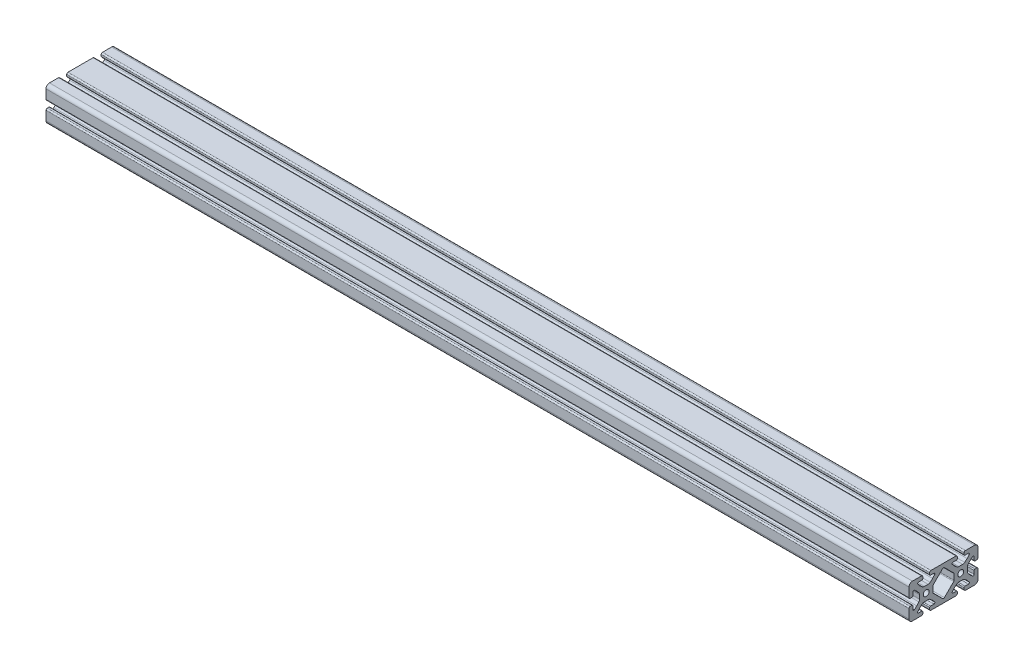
ISO-10303-21;
HEADER;
FILE_DESCRIPTION(('STEP AP214'),'2;1');
FILE_NAME('part.step','',(''),(''),'','','');
FILE_SCHEMA(('AUTOMOTIVE_DESIGN { 1 0 10303 214 1 1 1 1 }'));
ENDSEC;
DATA;
#1=APPLICATION_CONTEXT('core data for automotive mechanical design processes');
#2=APPLICATION_PROTOCOL_DEFINITION('international standard','automotive_design',2000,#1);
#3=PRODUCT_CONTEXT('',#1,'mechanical');
#4=PRODUCT('Part','Part','',(#3));
#5=PRODUCT_RELATED_PRODUCT_CATEGORY('part','',(#4));
#6=PRODUCT_DEFINITION_FORMATION('','',#4);
#7=PRODUCT_DEFINITION_CONTEXT('part definition',#1,'design');
#8=PRODUCT_DEFINITION('design','',#6,#7);
#9=PRODUCT_DEFINITION_SHAPE('','',#8);
#10=(LENGTH_UNIT() NAMED_UNIT(*) SI_UNIT(.MILLI.,.METRE.));
#11=(NAMED_UNIT(*) PLANE_ANGLE_UNIT() SI_UNIT($,.RADIAN.));
#12=(NAMED_UNIT(*) SI_UNIT($,.STERADIAN.) SOLID_ANGLE_UNIT());
#13=UNCERTAINTY_MEASURE_WITH_UNIT(LENGTH_MEASURE(1.E-05),#10,'distance_accuracy_value','');
#14=(GEOMETRIC_REPRESENTATION_CONTEXT(3) GLOBAL_UNCERTAINTY_ASSIGNED_CONTEXT((#13)) GLOBAL_UNIT_ASSIGNED_CONTEXT((#10,
#11,#12)) REPRESENTATION_CONTEXT('',''));
#15=CARTESIAN_POINT('',(0.,0.,0.));
#16=DIRECTION('',(0.,0.,1.));
#17=DIRECTION('',(1.,0.,0.));
#18=AXIS2_PLACEMENT_3D('',#15,#16,#17);
#19=CARTESIAN_POINT('',(1000.,-16.,36.));
#20=DIRECTION('',(-1.,0.,0.));
#21=DIRECTION('',(0.,0.,1.));
#22=AXIS2_PLACEMENT_3D('',#19,#20,#21);
#23=CYLINDRICAL_SURFACE('',#22,3.99999999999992);
#24=CARTESIAN_POINT('',(0.,-16.,36.));
#25=DIRECTION('',(1.,0.,0.));
#26=DIRECTION('',(0.,0.,-1.));
#27=AXIS2_PLACEMENT_3D('',#24,#25,#26);
#28=CIRCLE('',#27,3.99999999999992);
#29=CARTESIAN_POINT('',(0.,-16.0000000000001,39.9999999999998));
#30=VERTEX_POINT('',#29);
#31=CARTESIAN_POINT('',(0.,-20.0000000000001,35.9999999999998));
#32=VERTEX_POINT('',#31);
#33=EDGE_CURVE('E1254',#30,#32,#28,.T.);
#34=ORIENTED_EDGE('',*,*,#33,.T.);
#35=DIRECTION('',(-1.,0.,0.));
#36=VECTOR('',#35,1.);
#37=CARTESIAN_POINT('',(1000.,-20.0000000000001,35.9999999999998));
#38=LINE('',#37,#36);
#39=CARTESIAN_POINT('',(1000.,-20.0000000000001,35.9999999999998));
#40=VERTEX_POINT('',#39);
#41=EDGE_CURVE('E13',#40,#32,#38,.T.);
#42=ORIENTED_EDGE('',*,*,#41,.F.);
#43=CARTESIAN_POINT('',(1000.,-16.,36.));
#44=DIRECTION('',(1.,0.,0.));
#45=DIRECTION('',(0.,0.,-1.));
#46=AXIS2_PLACEMENT_3D('',#43,#44,#45);
#47=CIRCLE('',#46,3.99999999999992);
#48=CARTESIAN_POINT('',(1000.,-16.0000000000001,39.9999999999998));
#49=VERTEX_POINT('',#48);
#50=EDGE_CURVE('E1893',#49,#40,#47,.T.);
#51=ORIENTED_EDGE('',*,*,#50,.F.);
#52=DIRECTION('',(-1.,0.,0.));
#53=VECTOR('',#52,1.);
#54=CARTESIAN_POINT('',(1000.,-16.0000000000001,39.9999999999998));
#55=LINE('',#54,#53);
#56=EDGE_CURVE('E1485',#49,#30,#55,.T.);
#57=ORIENTED_EDGE('',*,*,#56,.T.);
#58=EDGE_LOOP('',(#34,#42,#51,#57));
#59=FACE_BOUND('',#58,.T.);
#60=ADVANCED_FACE('F392',(#59),#23,.T.);
#61=CARTESIAN_POINT('',(1000.,-20.0000000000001,35.9999999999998));
#62=DIRECTION('',(0.,1.,0.));
#63=DIRECTION('',(0.,0.,1.));
#64=AXIS2_PLACEMENT_3D('',#61,#62,#63);
#65=PLANE('',#64);
#66=DIRECTION('',(0.,0.,-1.));
#67=VECTOR('',#66,1.);
#68=CARTESIAN_POINT('',(0.,-20.0000000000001,35.9999999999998));
#69=LINE('',#68,#67);
#70=CARTESIAN_POINT('',(0.,-20.0000000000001,25.4999999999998));
#71=VERTEX_POINT('',#70);
#72=EDGE_CURVE('E1257',#32,#71,#69,.T.);
#73=ORIENTED_EDGE('',*,*,#72,.T.);
#74=DIRECTION('',(-1.,0.,0.));
#75=VECTOR('',#74,1.);
#76=CARTESIAN_POINT('',(1000.,-20.0000000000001,25.4999999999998));
#77=LINE('',#76,#75);
#78=CARTESIAN_POINT('',(1000.,-20.0000000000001,25.4999999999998));
#79=VERTEX_POINT('',#78);
#80=EDGE_CURVE('E402',#79,#71,#77,.T.);
#81=ORIENTED_EDGE('',*,*,#80,.F.);
#82=DIRECTION('',(0.,0.,-1.));
#83=VECTOR('',#82,1.);
#84=CARTESIAN_POINT('',(1000.,-20.0000000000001,35.9999999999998));
#85=LINE('',#84,#83);
#86=EDGE_CURVE('E1895',#40,#79,#85,.T.);
#87=ORIENTED_EDGE('',*,*,#86,.F.);
#88=ORIENTED_EDGE('',*,*,#41,.T.);
#89=EDGE_LOOP('',(#73,#81,#87,#88));
#90=FACE_BOUND('',#89,.T.);
#91=ADVANCED_FACE('F2145',(#90),#65,.F.);
#92=CARTESIAN_POINT('',(1000.,-18.5,25.5));
#93=DIRECTION('',(-1.,0.,0.));
#94=DIRECTION('',(0.,0.,1.));
#95=AXIS2_PLACEMENT_3D('',#92,#93,#94);
#96=CYLINDRICAL_SURFACE('',#95,1.50000000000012);
#97=CARTESIAN_POINT('',(0.,-18.5,25.5));
#98=DIRECTION('',(1.,0.,0.));
#99=DIRECTION('',(0.,0.,-1.));
#100=AXIS2_PLACEMENT_3D('',#97,#98,#99);
#101=CIRCLE('',#100,1.50000000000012);
#102=CARTESIAN_POINT('',(0.,-18.5,23.9999999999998));
#103=VERTEX_POINT('',#102);
#104=EDGE_CURVE('E1259',#71,#103,#101,.T.);
#105=ORIENTED_EDGE('',*,*,#104,.T.);
#106=DIRECTION('',(-1.,0.,0.));
#107=VECTOR('',#106,1.);
#108=CARTESIAN_POINT('',(1000.,-18.5,23.9999999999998));
#109=LINE('',#108,#107);
#110=CARTESIAN_POINT('',(1000.,-18.5,23.9999999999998));
#111=VERTEX_POINT('',#110);
#112=EDGE_CURVE('E1816',#111,#103,#109,.T.);
#113=ORIENTED_EDGE('',*,*,#112,.F.);
#114=CARTESIAN_POINT('',(1000.,-18.5,25.5));
#115=DIRECTION('',(1.,0.,0.));
#116=DIRECTION('',(0.,0.,-1.));
#117=AXIS2_PLACEMENT_3D('',#114,#115,#116);
#118=CIRCLE('',#117,1.50000000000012);
#119=EDGE_CURVE('E1897',#79,#111,#118,.T.);
#120=ORIENTED_EDGE('',*,*,#119,.F.);
#121=ORIENTED_EDGE('',*,*,#80,.T.);
#122=EDGE_LOOP('',(#105,#113,#120,#121));
#123=FACE_BOUND('',#122,.T.);
#124=ADVANCED_FACE('F2150',(#123),#96,.T.);
#125=CARTESIAN_POINT('',(1000.,-18.5,23.9999999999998));
#126=DIRECTION('',(0.,0.,1.));
#127=DIRECTION('',(0.,-1.,0.));
#128=AXIS2_PLACEMENT_3D('',#125,#126,#127);
#129=PLANE('',#128);
#130=DIRECTION('',(0.,1.,0.));
#131=VECTOR('',#130,1.);
#132=CARTESIAN_POINT('',(0.,-18.5,23.9999999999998));
#133=LINE('',#132,#131);
#134=CARTESIAN_POINT('',(0.,-16.5,24.));
#135=VERTEX_POINT('',#134);
#136=EDGE_CURVE('E1261',#103,#135,#133,.T.);
#137=ORIENTED_EDGE('',*,*,#136,.T.);
#138=DIRECTION('',(-1.,0.,0.));
#139=VECTOR('',#138,1.);
#140=CARTESIAN_POINT('',(1000.,-16.5,24.));
#141=LINE('',#140,#139);
#142=CARTESIAN_POINT('',(1000.,-16.5,24.));
#143=VERTEX_POINT('',#142);
#144=EDGE_CURVE('E1813',#143,#135,#141,.T.);
#145=ORIENTED_EDGE('',*,*,#144,.F.);
#146=DIRECTION('',(0.,1.,0.));
#147=VECTOR('',#146,1.);
#148=CARTESIAN_POINT('',(1000.,-18.5,23.9999999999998));
#149=LINE('',#148,#147);
#150=EDGE_CURVE('E1899',#111,#143,#149,.T.);
#151=ORIENTED_EDGE('',*,*,#150,.F.);
#152=ORIENTED_EDGE('',*,*,#112,.T.);
#153=EDGE_LOOP('',(#137,#145,#151,#152));
#154=FACE_BOUND('',#153,.T.);
#155=ADVANCED_FACE('F3527',(#154),#129,.F.);
#156=CARTESIAN_POINT('',(1000.,-16.5,25.));
#157=DIRECTION('',(-1.,0.,0.));
#158=DIRECTION('',(0.,0.,1.));
#159=AXIS2_PLACEMENT_3D('',#156,#157,#158);
#160=CYLINDRICAL_SURFACE('',#159,1.00000000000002);
#161=CARTESIAN_POINT('',(0.,-16.5,25.));
#162=DIRECTION('',(1.,0.,0.));
#163=DIRECTION('',(0.,0.,-1.));
#164=AXIS2_PLACEMENT_3D('',#161,#162,#163);
#165=CIRCLE('',#164,1.00000000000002);
#166=CARTESIAN_POINT('',(0.,-15.5000000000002,25.0000000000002));
#167=VERTEX_POINT('',#166);
#168=EDGE_CURVE('E1263',#135,#167,#165,.T.);
#169=ORIENTED_EDGE('',*,*,#168,.T.);
#170=DIRECTION('',(-1.,0.,0.));
#171=VECTOR('',#170,1.);
#172=CARTESIAN_POINT('',(1000.,-15.5000000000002,25.0000000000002));
#173=LINE('',#172,#171);
#174=CARTESIAN_POINT('',(1000.,-15.5000000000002,25.0000000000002));
#175=VERTEX_POINT('',#174);
#176=EDGE_CURVE('E1810',#175,#167,#173,.T.);
#177=ORIENTED_EDGE('',*,*,#176,.F.);
#178=CARTESIAN_POINT('',(1000.,-16.5,25.));
#179=DIRECTION('',(1.,0.,0.));
#180=DIRECTION('',(0.,0.,-1.));
#181=AXIS2_PLACEMENT_3D('',#178,#179,#180);
#182=CIRCLE('',#181,1.00000000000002);
#183=EDGE_CURVE('E1901',#143,#175,#182,.T.);
#184=ORIENTED_EDGE('',*,*,#183,.F.);
#185=ORIENTED_EDGE('',*,*,#144,.T.);
#186=EDGE_LOOP('',(#169,#177,#184,#185));
#187=FACE_BOUND('',#186,.T.);
#188=ADVANCED_FACE('F3516',(#187),#160,.T.);
#189=CARTESIAN_POINT('',(1000.,-15.5000000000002,25.0000000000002));
#190=DIRECTION('',(0.,-1.,0.));
#191=DIRECTION('',(0.,0.,-1.));
#192=AXIS2_PLACEMENT_3D('',#189,#190,#191);
#193=PLANE('',#192);
#194=DIRECTION('',(0.,0.,1.));
#195=VECTOR('',#194,1.);
#196=CARTESIAN_POINT('',(0.,-15.5000000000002,25.0000000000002));
#197=LINE('',#196,#195);
#198=CARTESIAN_POINT('',(0.,-15.5000000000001,28.9161150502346));
#199=VERTEX_POINT('',#198);
#200=EDGE_CURVE('E1265',#167,#199,#197,.T.);
#201=ORIENTED_EDGE('',*,*,#200,.T.);
#202=DIRECTION('',(-1.,0.,0.));
#203=VECTOR('',#202,1.);
#204=CARTESIAN_POINT('',(1000.,-15.5000000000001,28.9161150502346));
#205=LINE('',#204,#203);
#206=CARTESIAN_POINT('',(1000.,-15.5000000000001,28.9161150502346));
#207=VERTEX_POINT('',#206);
#208=EDGE_CURVE('E1807',#207,#199,#205,.T.);
#209=ORIENTED_EDGE('',*,*,#208,.F.);
#210=DIRECTION('',(0.,0.,1.));
#211=VECTOR('',#210,1.);
#212=CARTESIAN_POINT('',(1000.,-15.5000000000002,25.0000000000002));
#213=LINE('',#212,#211);
#214=EDGE_CURVE('E1903',#175,#207,#213,.T.);
#215=ORIENTED_EDGE('',*,*,#214,.F.);
#216=ORIENTED_EDGE('',*,*,#176,.T.);
#217=EDGE_LOOP('',(#201,#209,#215,#216));
#218=FACE_BOUND('',#217,.T.);
#219=ADVANCED_FACE('F3505',(#218),#193,.F.);
#220=CARTESIAN_POINT('',(1000.,-14.4161150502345,28.9161150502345));
#221=DIRECTION('',(-1.,0.,0.));
#222=DIRECTION('',(0.,0.,1.));
#223=AXIS2_PLACEMENT_3D('',#220,#221,#222);
#224=CYLINDRICAL_SURFACE('',#223,1.08388494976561);
#225=CARTESIAN_POINT('',(0.,-14.4161150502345,28.9161150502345));
#226=DIRECTION('',(-1.,0.,0.));
#227=DIRECTION('',(0.,0.,-1.));
#228=AXIS2_PLACEMENT_3D('',#225,#226,#227);
#229=CIRCLE('',#228,1.08388494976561);
#230=CARTESIAN_POINT('',(0.,-13.7732974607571,29.7888075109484));
#231=VERTEX_POINT('',#230);
#232=EDGE_CURVE('E1267',#199,#231,#229,.T.);
#233=ORIENTED_EDGE('',*,*,#232,.T.);
#234=DIRECTION('',(-1.,0.,0.));
#235=VECTOR('',#234,1.);
#236=CARTESIAN_POINT('',(1000.,-13.7732974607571,29.7888075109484));
#237=LINE('',#236,#235);
#238=CARTESIAN_POINT('',(1000.,-13.7732974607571,29.7888075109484));
#239=VERTEX_POINT('',#238);
#240=EDGE_CURVE('E1804',#239,#231,#237,.T.);
#241=ORIENTED_EDGE('',*,*,#240,.F.);
#242=CARTESIAN_POINT('',(1000.,-14.4161150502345,28.9161150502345));
#243=DIRECTION('',(-1.,0.,0.));
#244=DIRECTION('',(0.,0.,-1.));
#245=AXIS2_PLACEMENT_3D('',#242,#243,#244);
#246=CIRCLE('',#245,1.08388494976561);
#247=EDGE_CURVE('E1905',#207,#239,#246,.T.);
#248=ORIENTED_EDGE('',*,*,#247,.F.);
#249=ORIENTED_EDGE('',*,*,#208,.T.);
#250=EDGE_LOOP('',(#233,#241,#248,#249));
#251=FACE_BOUND('',#250,.T.);
#252=ADVANCED_FACE('F3494',(#251),#224,.F.);
#253=CARTESIAN_POINT('',(1000.,-10.9635513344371,27.3787944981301));
#254=DIRECTION('',(0.,0.651049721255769,0.759035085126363));
#255=DIRECTION('',(0.,-0.759035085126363,0.651049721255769));
#256=AXIS2_PLACEMENT_3D('',#253,#254,#255);
#257=PLANE('',#256);
#258=DIRECTION('',(0.,0.759035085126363,-0.651049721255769));
#259=VECTOR('',#258,1.);
#260=CARTESIAN_POINT('',(0.,-10.9635513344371,27.3787944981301));
#261=LINE('',#260,#259);
#262=CARTESIAN_POINT('',(0.,-10.9635513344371,27.3787944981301));
#263=VERTEX_POINT('',#262);
#264=EDGE_CURVE('E1269',#231,#263,#261,.T.);
#265=ORIENTED_EDGE('',*,*,#264,.T.);
#266=DIRECTION('',(-1.,0.,0.));
#267=VECTOR('',#266,1.);
#268=CARTESIAN_POINT('',(1000.,-10.9635513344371,27.3787944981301));
#269=LINE('',#268,#267);
#270=CARTESIAN_POINT('',(1000.,-10.9635513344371,27.3787944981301));
#271=VERTEX_POINT('',#270);
#272=EDGE_CURVE('E1801',#271,#263,#269,.T.);
#273=ORIENTED_EDGE('',*,*,#272,.F.);
#274=DIRECTION('',(0.,0.759035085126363,-0.651049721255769));
#275=VECTOR('',#274,1.);
#276=CARTESIAN_POINT('',(1000.,-10.9635513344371,27.3787944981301));
#277=LINE('',#276,#275);
#278=EDGE_CURVE('E1907',#239,#271,#277,.T.);
#279=ORIENTED_EDGE('',*,*,#278,.F.);
#280=ORIENTED_EDGE('',*,*,#240,.T.);
#281=EDGE_LOOP('',(#265,#273,#279,#280));
#282=FACE_BOUND('',#281,.T.);
#283=ADVANCED_FACE('F3483',(#282),#257,.F.);
#284=CARTESIAN_POINT('',(1000.,-8.54047619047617,24.580305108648));
#285=DIRECTION('',(0.,0.755994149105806,0.654578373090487));
#286=DIRECTION('',(0.,-0.654578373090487,0.755994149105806));
#287=AXIS2_PLACEMENT_3D('',#284,#285,#286);
#288=PLANE('',#287);
#289=DIRECTION('',(0.,0.654578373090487,-0.755994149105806));
#290=VECTOR('',#289,1.);
#291=CARTESIAN_POINT('',(0.,-8.54047619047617,24.580305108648));
#292=LINE('',#291,#290);
#293=CARTESIAN_POINT('',(0.,-8.54047619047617,24.580305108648));
#294=VERTEX_POINT('',#293);
#295=EDGE_CURVE('E1271',#263,#294,#292,.T.);
#296=ORIENTED_EDGE('',*,*,#295,.T.);
#297=DIRECTION('',(-1.,0.,0.));
#298=VECTOR('',#297,1.);
#299=CARTESIAN_POINT('',(1000.,-8.54047619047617,24.580305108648));
#300=LINE('',#299,#298);
#301=CARTESIAN_POINT('',(1000.,-8.54047619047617,24.580305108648));
#302=VERTEX_POINT('',#301);
#303=EDGE_CURVE('E1798',#302,#294,#300,.T.);
#304=ORIENTED_EDGE('',*,*,#303,.F.);
#305=DIRECTION('',(0.,0.654578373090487,-0.755994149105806));
#306=VECTOR('',#305,1.);
#307=CARTESIAN_POINT('',(1000.,-8.54047619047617,24.580305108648));
#308=LINE('',#307,#306);
#309=EDGE_CURVE('E1909',#271,#302,#308,.T.);
#310=ORIENTED_EDGE('',*,*,#309,.F.);
#311=ORIENTED_EDGE('',*,*,#272,.T.);
#312=EDGE_LOOP('',(#296,#304,#310,#311));
#313=FACE_BOUND('',#312,.T.);
#314=ADVANCED_FACE('F3472',(#313),#288,.F.);
#315=CARTESIAN_POINT('',(1000.,-11.75,22.1930562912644));
#316=DIRECTION('',(-1.,0.,0.));
#317=DIRECTION('',(0.,0.,1.));
#318=AXIS2_PLACEMENT_3D('',#315,#316,#317);
#319=CYLINDRICAL_SURFACE('',#318,3.99999999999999);
#320=CARTESIAN_POINT('',(0.,-11.75,22.1930562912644));
#321=DIRECTION('',(-1.,0.,0.));
#322=DIRECTION('',(0.,0.,-1.));
#323=AXIS2_PLACEMENT_3D('',#320,#321,#322);
#324=CIRCLE('',#323,3.99999999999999);
#325=CARTESIAN_POINT('',(0.,-7.75,22.1930562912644));
#326=VERTEX_POINT('',#325);
#327=EDGE_CURVE('E1273',#294,#326,#324,.T.);
#328=ORIENTED_EDGE('',*,*,#327,.T.);
#329=DIRECTION('',(-1.,0.,0.));
#330=VECTOR('',#329,1.);
#331=CARTESIAN_POINT('',(1000.,-7.75,22.1930562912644));
#332=LINE('',#331,#330);
#333=CARTESIAN_POINT('',(1000.,-7.75,22.1930562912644));
#334=VERTEX_POINT('',#333);
#335=EDGE_CURVE('E1795',#334,#326,#332,.T.);
#336=ORIENTED_EDGE('',*,*,#335,.F.);
#337=CARTESIAN_POINT('',(1000.,-11.75,22.1930562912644));
#338=DIRECTION('',(-1.,0.,0.));
#339=DIRECTION('',(0.,0.,-1.));
#340=AXIS2_PLACEMENT_3D('',#337,#338,#339);
#341=CIRCLE('',#340,3.99999999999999);
#342=EDGE_CURVE('E1911',#302,#334,#341,.T.);
#343=ORIENTED_EDGE('',*,*,#342,.F.);
#344=ORIENTED_EDGE('',*,*,#303,.T.);
#345=EDGE_LOOP('',(#328,#336,#343,#344));
#346=FACE_BOUND('',#345,.T.);
#347=ADVANCED_FACE('F3461',(#346),#319,.F.);
#348=CARTESIAN_POINT('',(1000.,-7.75,22.1930562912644));
#349=DIRECTION('',(0.,1.,0.));
#350=DIRECTION('',(0.,0.,1.));
#351=AXIS2_PLACEMENT_3D('',#348,#349,#350);
#352=PLANE('',#351);
#353=DIRECTION('',(0.,0.,-1.));
#354=VECTOR('',#353,1.);
#355=CARTESIAN_POINT('',(0.,-7.75,22.1930562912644));
#356=LINE('',#355,#354);
#357=CARTESIAN_POINT('',(0.,-7.75,17.8069437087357));
#358=VERTEX_POINT('',#357);
#359=EDGE_CURVE('E1275',#326,#358,#356,.T.);
#360=ORIENTED_EDGE('',*,*,#359,.T.);
#361=DIRECTION('',(-1.,0.,0.));
#362=VECTOR('',#361,1.);
#363=CARTESIAN_POINT('',(1000.,-7.75,17.8069437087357));
#364=LINE('',#363,#362);
#365=CARTESIAN_POINT('',(1000.,-7.75,17.8069437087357));
#366=VERTEX_POINT('',#365);
#367=EDGE_CURVE('E1792',#366,#358,#364,.T.);
#368=ORIENTED_EDGE('',*,*,#367,.F.);
#369=DIRECTION('',(0.,0.,-1.));
#370=VECTOR('',#369,1.);
#371=CARTESIAN_POINT('',(1000.,-7.75,22.1930562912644));
#372=LINE('',#371,#370);
#373=EDGE_CURVE('E1913',#334,#366,#372,.T.);
#374=ORIENTED_EDGE('',*,*,#373,.F.);
#375=ORIENTED_EDGE('',*,*,#335,.T.);
#376=EDGE_LOOP('',(#360,#368,#374,#375));
#377=FACE_BOUND('',#376,.T.);
#378=ADVANCED_FACE('F3450',(#377),#352,.F.);
#379=CARTESIAN_POINT('',(1000.,-11.75,17.8069437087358));
#380=DIRECTION('',(-1.,0.,0.));
#381=DIRECTION('',(0.,0.,1.));
#382=AXIS2_PLACEMENT_3D('',#379,#380,#381);
#383=CYLINDRICAL_SURFACE('',#382,3.99999999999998);
#384=CARTESIAN_POINT('',(0.,-11.75,17.8069437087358));
#385=DIRECTION('',(-1.,0.,0.));
#386=DIRECTION('',(0.,0.,-1.));
#387=AXIS2_PLACEMENT_3D('',#384,#385,#386);
#388=CIRCLE('',#387,3.99999999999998);
#389=CARTESIAN_POINT('',(0.,-8.54047619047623,15.4196948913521));
#390=VERTEX_POINT('',#389);
#391=EDGE_CURVE('E1277',#358,#390,#388,.T.);
#392=ORIENTED_EDGE('',*,*,#391,.T.);
#393=DIRECTION('',(-1.,0.,0.));
#394=VECTOR('',#393,1.);
#395=CARTESIAN_POINT('',(1000.,-8.54047619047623,15.4196948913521));
#396=LINE('',#395,#394);
#397=CARTESIAN_POINT('',(1000.,-8.54047619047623,15.4196948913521));
#398=VERTEX_POINT('',#397);
#399=EDGE_CURVE('E1789',#398,#390,#396,.T.);
#400=ORIENTED_EDGE('',*,*,#399,.F.);
#401=CARTESIAN_POINT('',(1000.,-11.75,17.8069437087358));
#402=DIRECTION('',(-1.,0.,0.));
#403=DIRECTION('',(0.,0.,-1.));
#404=AXIS2_PLACEMENT_3D('',#401,#402,#403);
#405=CIRCLE('',#404,3.99999999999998);
#406=EDGE_CURVE('E1915',#366,#398,#405,.T.);
#407=ORIENTED_EDGE('',*,*,#406,.F.);
#408=ORIENTED_EDGE('',*,*,#367,.T.);
#409=EDGE_LOOP('',(#392,#400,#407,#408));
#410=FACE_BOUND('',#409,.T.);
#411=ADVANCED_FACE('F3439',(#410),#383,.F.);
#412=CARTESIAN_POINT('',(1000.,-10.963551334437,12.6212055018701));
#413=DIRECTION('',(0.,0.755994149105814,-0.654578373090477));
#414=DIRECTION('',(0.,0.654578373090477,0.755994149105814));
#415=AXIS2_PLACEMENT_3D('',#412,#413,#414);
#416=PLANE('',#415);
#417=DIRECTION('',(0.,-0.654578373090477,-0.755994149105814));
#418=VECTOR('',#417,1.);
#419=CARTESIAN_POINT('',(0.,-10.963551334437,12.6212055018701));
#420=LINE('',#419,#418);
#421=CARTESIAN_POINT('',(0.,-10.963551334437,12.6212055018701));
#422=VERTEX_POINT('',#421);
#423=EDGE_CURVE('E1279',#390,#422,#420,.T.);
#424=ORIENTED_EDGE('',*,*,#423,.T.);
#425=DIRECTION('',(-1.,0.,0.));
#426=VECTOR('',#425,1.);
#427=CARTESIAN_POINT('',(1000.,-10.963551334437,12.6212055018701));
#428=LINE('',#427,#426);
#429=CARTESIAN_POINT('',(1000.,-10.963551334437,12.6212055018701));
#430=VERTEX_POINT('',#429);
#431=EDGE_CURVE('E1786',#430,#422,#428,.T.);
#432=ORIENTED_EDGE('',*,*,#431,.F.);
#433=DIRECTION('',(0.,-0.654578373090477,-0.755994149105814));
#434=VECTOR('',#433,1.);
#435=CARTESIAN_POINT('',(1000.,-10.963551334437,12.6212055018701));
#436=LINE('',#435,#434);
#437=EDGE_CURVE('E1917',#398,#430,#436,.T.);
#438=ORIENTED_EDGE('',*,*,#437,.F.);
#439=ORIENTED_EDGE('',*,*,#399,.T.);
#440=EDGE_LOOP('',(#424,#432,#438,#439));
#441=FACE_BOUND('',#440,.T.);
#442=ADVANCED_FACE('F3428',(#441),#416,.F.);
#443=CARTESIAN_POINT('',(1000.,-13.773297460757,10.2111924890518));
#444=DIRECTION('',(0.,0.651049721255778,-0.759035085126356));
#445=DIRECTION('',(0.,0.759035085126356,0.651049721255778));
#446=AXIS2_PLACEMENT_3D('',#443,#444,#445);
#447=PLANE('',#446);
#448=DIRECTION('',(0.,-0.759035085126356,-0.651049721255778));
#449=VECTOR('',#448,1.);
#450=CARTESIAN_POINT('',(0.,-13.773297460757,10.2111924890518));
#451=LINE('',#450,#449);
#452=CARTESIAN_POINT('',(0.,-13.773297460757,10.2111924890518));
#453=VERTEX_POINT('',#452);
#454=EDGE_CURVE('E1281',#422,#453,#451,.T.);
#455=ORIENTED_EDGE('',*,*,#454,.T.);
#456=DIRECTION('',(-1.,0.,0.));
#457=VECTOR('',#456,1.);
#458=CARTESIAN_POINT('',(1000.,-13.773297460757,10.2111924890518));
#459=LINE('',#458,#457);
#460=CARTESIAN_POINT('',(1000.,-13.773297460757,10.2111924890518));
#461=VERTEX_POINT('',#460);
#462=EDGE_CURVE('E1783',#461,#453,#459,.T.);
#463=ORIENTED_EDGE('',*,*,#462,.F.);
#464=DIRECTION('',(0.,-0.759035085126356,-0.651049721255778));
#465=VECTOR('',#464,1.);
#466=CARTESIAN_POINT('',(1000.,-13.773297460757,10.2111924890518));
#467=LINE('',#466,#465);
#468=EDGE_CURVE('E1919',#430,#461,#467,.T.);
#469=ORIENTED_EDGE('',*,*,#468,.F.);
#470=ORIENTED_EDGE('',*,*,#431,.T.);
#471=EDGE_LOOP('',(#455,#463,#469,#470));
#472=FACE_BOUND('',#471,.T.);
#473=ADVANCED_FACE('F3417',(#472),#447,.F.);
#474=CARTESIAN_POINT('',(1000.,-14.4161150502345,11.0838849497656));
#475=DIRECTION('',(-1.,0.,0.));
#476=DIRECTION('',(0.,0.,1.));
#477=AXIS2_PLACEMENT_3D('',#474,#475,#476);
#478=CYLINDRICAL_SURFACE('',#477,1.08388494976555);
#479=CARTESIAN_POINT('',(0.,-14.4161150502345,11.0838849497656));
#480=DIRECTION('',(-1.,0.,0.));
#481=DIRECTION('',(0.,0.,-1.));
#482=AXIS2_PLACEMENT_3D('',#479,#480,#481);
#483=CIRCLE('',#482,1.08388494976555);
#484=CARTESIAN_POINT('',(0.,-15.5,11.0838849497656));
#485=VERTEX_POINT('',#484);
#486=EDGE_CURVE('E1283',#453,#485,#483,.T.);
#487=ORIENTED_EDGE('',*,*,#486,.T.);
#488=DIRECTION('',(-1.,0.,0.));
#489=VECTOR('',#488,1.);
#490=CARTESIAN_POINT('',(1000.,-15.5,11.0838849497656));
#491=LINE('',#490,#489);
#492=CARTESIAN_POINT('',(1000.,-15.5,11.0838849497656));
#493=VERTEX_POINT('',#492);
#494=EDGE_CURVE('E1780',#493,#485,#491,.T.);
#495=ORIENTED_EDGE('',*,*,#494,.F.);
#496=CARTESIAN_POINT('',(1000.,-14.4161150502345,11.0838849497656));
#497=DIRECTION('',(-1.,0.,0.));
#498=DIRECTION('',(0.,0.,-1.));
#499=AXIS2_PLACEMENT_3D('',#496,#497,#498);
#500=CIRCLE('',#499,1.08388494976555);
#501=EDGE_CURVE('E1921',#461,#493,#500,.T.);
#502=ORIENTED_EDGE('',*,*,#501,.F.);
#503=ORIENTED_EDGE('',*,*,#462,.T.);
#504=EDGE_LOOP('',(#487,#495,#502,#503));
#505=FACE_BOUND('',#504,.T.);
#506=ADVANCED_FACE('F3406',(#505),#478,.F.);
#507=CARTESIAN_POINT('',(1000.,-15.5,11.0838849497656));
#508=DIRECTION('',(0.,-1.,0.));
#509=DIRECTION('',(0.,0.,-1.));
#510=AXIS2_PLACEMENT_3D('',#507,#508,#509);
#511=PLANE('',#510);
#512=DIRECTION('',(0.,0.,1.));
#513=VECTOR('',#512,1.);
#514=CARTESIAN_POINT('',(0.,-15.5,11.0838849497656));
#515=LINE('',#514,#513);
#516=CARTESIAN_POINT('',(0.,-15.5,15.));
#517=VERTEX_POINT('',#516);
#518=EDGE_CURVE('E1285',#485,#517,#515,.T.);
#519=ORIENTED_EDGE('',*,*,#518,.T.);
#520=DIRECTION('',(-1.,0.,0.));
#521=VECTOR('',#520,1.);
#522=CARTESIAN_POINT('',(1000.,-15.5,15.));
#523=LINE('',#522,#521);
#524=CARTESIAN_POINT('',(1000.,-15.5,15.));
#525=VERTEX_POINT('',#524);
#526=EDGE_CURVE('E1777',#525,#517,#523,.T.);
#527=ORIENTED_EDGE('',*,*,#526,.F.);
#528=DIRECTION('',(0.,0.,1.));
#529=VECTOR('',#528,1.);
#530=CARTESIAN_POINT('',(1000.,-15.5,11.0838849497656));
#531=LINE('',#530,#529);
#532=EDGE_CURVE('E1923',#493,#525,#531,.T.);
#533=ORIENTED_EDGE('',*,*,#532,.F.);
#534=ORIENTED_EDGE('',*,*,#494,.T.);
#535=EDGE_LOOP('',(#519,#527,#533,#534));
#536=FACE_BOUND('',#535,.T.);
#537=ADVANCED_FACE('F3395',(#536),#511,.F.);
#538=CARTESIAN_POINT('',(1000.,-16.5,15.));
#539=DIRECTION('',(-1.,0.,0.));
#540=DIRECTION('',(0.,0.,1.));
#541=AXIS2_PLACEMENT_3D('',#538,#539,#540);
#542=CYLINDRICAL_SURFACE('',#541,1.);
#543=CARTESIAN_POINT('',(0.,-16.5,15.));
#544=DIRECTION('',(1.,0.,0.));
#545=DIRECTION('',(0.,0.,-1.));
#546=AXIS2_PLACEMENT_3D('',#543,#544,#545);
#547=CIRCLE('',#546,1.);
#548=CARTESIAN_POINT('',(0.,-16.5,16.));
#549=VERTEX_POINT('',#548);
#550=EDGE_CURVE('E1287',#517,#549,#547,.T.);
#551=ORIENTED_EDGE('',*,*,#550,.T.);
#552=DIRECTION('',(-1.,0.,0.));
#553=VECTOR('',#552,1.);
#554=CARTESIAN_POINT('',(1000.,-16.5,16.));
#555=LINE('',#554,#553);
#556=CARTESIAN_POINT('',(1000.,-16.5,16.));
#557=VERTEX_POINT('',#556);
#558=EDGE_CURVE('E1774',#557,#549,#555,.T.);
#559=ORIENTED_EDGE('',*,*,#558,.F.);
#560=CARTESIAN_POINT('',(1000.,-16.5,15.));
#561=DIRECTION('',(1.,0.,0.));
#562=DIRECTION('',(0.,0.,-1.));
#563=AXIS2_PLACEMENT_3D('',#560,#561,#562);
#564=CIRCLE('',#563,1.);
#565=EDGE_CURVE('E1925',#525,#557,#564,.T.);
#566=ORIENTED_EDGE('',*,*,#565,.F.);
#567=ORIENTED_EDGE('',*,*,#526,.T.);
#568=EDGE_LOOP('',(#551,#559,#566,#567));
#569=FACE_BOUND('',#568,.T.);
#570=ADVANCED_FACE('F3384',(#569),#542,.T.);
#571=CARTESIAN_POINT('',(1000.,-16.5,16.));
#572=DIRECTION('',(0.,0.,-1.));
#573=DIRECTION('',(-1.,0.,0.));
#574=AXIS2_PLACEMENT_3D('',#571,#572,#573);
#575=PLANE('',#574);
#576=DIRECTION('',(0.,-1.,0.));
#577=VECTOR('',#576,1.);
#578=CARTESIAN_POINT('',(0.,-16.5,16.));
#579=LINE('',#578,#577);
#580=CARTESIAN_POINT('',(0.,-18.5,16.));
#581=VERTEX_POINT('',#580);
#582=EDGE_CURVE('E1289',#549,#581,#579,.T.);
#583=ORIENTED_EDGE('',*,*,#582,.T.);
#584=DIRECTION('',(-1.,0.,0.));
#585=VECTOR('',#584,1.);
#586=CARTESIAN_POINT('',(1000.,-18.5,16.));
#587=LINE('',#586,#585);
#588=CARTESIAN_POINT('',(1000.,-18.5,16.));
#589=VERTEX_POINT('',#588);
#590=EDGE_CURVE('E1771',#589,#581,#587,.T.);
#591=ORIENTED_EDGE('',*,*,#590,.F.);
#592=DIRECTION('',(0.,-1.,0.));
#593=VECTOR('',#592,1.);
#594=CARTESIAN_POINT('',(1000.,-16.5,16.));
#595=LINE('',#594,#593);
#596=EDGE_CURVE('E1927',#557,#589,#595,.T.);
#597=ORIENTED_EDGE('',*,*,#596,.F.);
#598=ORIENTED_EDGE('',*,*,#558,.T.);
#599=EDGE_LOOP('',(#583,#591,#597,#598));
#600=FACE_BOUND('',#599,.T.);
#601=ADVANCED_FACE('F3373',(#600),#575,.F.);
#602=CARTESIAN_POINT('',(1000.,-18.5,14.5));
#603=DIRECTION('',(-1.,0.,0.));
#604=DIRECTION('',(0.,0.,1.));
#605=AXIS2_PLACEMENT_3D('',#602,#603,#604);
#606=CYLINDRICAL_SURFACE('',#605,1.5);
#607=CARTESIAN_POINT('',(0.,-18.5,14.5));
#608=DIRECTION('',(1.,0.,0.));
#609=DIRECTION('',(0.,0.,-1.));
#610=AXIS2_PLACEMENT_3D('',#607,#608,#609);
#611=CIRCLE('',#610,1.5);
#612=CARTESIAN_POINT('',(0.,-20.,14.5));
#613=VERTEX_POINT('',#612);
#614=EDGE_CURVE('E1291',#581,#613,#611,.T.);
#615=ORIENTED_EDGE('',*,*,#614,.T.);
#616=DIRECTION('',(-1.,0.,0.));
#617=VECTOR('',#616,1.);
#618=CARTESIAN_POINT('',(1000.,-20.,14.5));
#619=LINE('',#618,#617);
#620=CARTESIAN_POINT('',(1000.,-20.,14.5));
#621=VERTEX_POINT('',#620);
#622=EDGE_CURVE('E1768',#621,#613,#619,.T.);
#623=ORIENTED_EDGE('',*,*,#622,.F.);
#624=CARTESIAN_POINT('',(1000.,-18.5,14.5));
#625=DIRECTION('',(1.,0.,0.));
#626=DIRECTION('',(0.,0.,-1.));
#627=AXIS2_PLACEMENT_3D('',#624,#625,#626);
#628=CIRCLE('',#627,1.5);
#629=EDGE_CURVE('E1929',#589,#621,#628,.T.);
#630=ORIENTED_EDGE('',*,*,#629,.F.);
#631=ORIENTED_EDGE('',*,*,#590,.T.);
#632=EDGE_LOOP('',(#615,#623,#630,#631));
#633=FACE_BOUND('',#632,.T.);
#634=ADVANCED_FACE('F3362',(#633),#606,.T.);
#635=CARTESIAN_POINT('',(1000.,-20.,14.5));
#636=DIRECTION('',(0.,1.,0.));
#637=DIRECTION('',(0.,0.,1.));
#638=AXIS2_PLACEMENT_3D('',#635,#636,#637);
#639=PLANE('',#638);
#640=DIRECTION('',(0.,0.,-1.));
#641=VECTOR('',#640,1.);
#642=CARTESIAN_POINT('',(0.,-20.,14.5));
#643=LINE('',#642,#641);
#644=CARTESIAN_POINT('',(0.,-20.,-14.5));
#645=VERTEX_POINT('',#644);
#646=EDGE_CURVE('E1293',#613,#645,#643,.T.);
#647=ORIENTED_EDGE('',*,*,#646,.T.);
#648=DIRECTION('',(-1.,0.,0.));
#649=VECTOR('',#648,1.);
#650=CARTESIAN_POINT('',(1000.,-20.,-14.5));
#651=LINE('',#650,#649);
#652=CARTESIAN_POINT('',(1000.,-20.,-14.5));
#653=VERTEX_POINT('',#652);
#654=EDGE_CURVE('E1765',#653,#645,#651,.T.);
#655=ORIENTED_EDGE('',*,*,#654,.F.);
#656=DIRECTION('',(0.,0.,-1.));
#657=VECTOR('',#656,1.);
#658=CARTESIAN_POINT('',(1000.,-20.,14.5));
#659=LINE('',#658,#657);
#660=EDGE_CURVE('E1931',#621,#653,#659,.T.);
#661=ORIENTED_EDGE('',*,*,#660,.F.);
#662=ORIENTED_EDGE('',*,*,#622,.T.);
#663=EDGE_LOOP('',(#647,#655,#661,#662));
#664=FACE_BOUND('',#663,.T.);
#665=ADVANCED_FACE('F3351',(#664),#639,.F.);
#666=CARTESIAN_POINT('',(1000.,-18.5,-14.5));
#667=DIRECTION('',(-1.,0.,0.));
#668=DIRECTION('',(0.,0.,1.));
#669=AXIS2_PLACEMENT_3D('',#666,#667,#668);
#670=CYLINDRICAL_SURFACE('',#669,1.5);
#671=CARTESIAN_POINT('',(0.,-18.5,-14.5));
#672=DIRECTION('',(1.,0.,0.));
#673=DIRECTION('',(0.,0.,-1.));
#674=AXIS2_PLACEMENT_3D('',#671,#672,#673);
#675=CIRCLE('',#674,1.5);
#676=CARTESIAN_POINT('',(0.,-18.5,-16.));
#677=VERTEX_POINT('',#676);
#678=EDGE_CURVE('E1295',#645,#677,#675,.T.);
#679=ORIENTED_EDGE('',*,*,#678,.T.);
#680=DIRECTION('',(-1.,0.,0.));
#681=VECTOR('',#680,1.);
#682=CARTESIAN_POINT('',(1000.,-18.5,-16.));
#683=LINE('',#682,#681);
#684=CARTESIAN_POINT('',(1000.,-18.5,-16.));
#685=VERTEX_POINT('',#684);
#686=EDGE_CURVE('E1762',#685,#677,#683,.T.);
#687=ORIENTED_EDGE('',*,*,#686,.F.);
#688=CARTESIAN_POINT('',(1000.,-18.5,-14.5));
#689=DIRECTION('',(1.,0.,0.));
#690=DIRECTION('',(0.,0.,-1.));
#691=AXIS2_PLACEMENT_3D('',#688,#689,#690);
#692=CIRCLE('',#691,1.5);
#693=EDGE_CURVE('E1933',#653,#685,#692,.T.);
#694=ORIENTED_EDGE('',*,*,#693,.F.);
#695=ORIENTED_EDGE('',*,*,#654,.T.);
#696=EDGE_LOOP('',(#679,#687,#694,#695));
#697=FACE_BOUND('',#696,.T.);
#698=ADVANCED_FACE('F3340',(#697),#670,.T.);
#699=CARTESIAN_POINT('',(1000.,-18.5,-16.));
#700=DIRECTION('',(0.,0.,1.));
#701=DIRECTION('',(0.,-1.,0.));
#702=AXIS2_PLACEMENT_3D('',#699,#700,#701);
#703=PLANE('',#702);
#704=DIRECTION('',(0.,1.,0.));
#705=VECTOR('',#704,1.);
#706=CARTESIAN_POINT('',(0.,-18.5,-16.));
#707=LINE('',#706,#705);
#708=CARTESIAN_POINT('',(0.,-16.5,-16.0000000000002));
#709=VERTEX_POINT('',#708);
#710=EDGE_CURVE('E1297',#677,#709,#707,.T.);
#711=ORIENTED_EDGE('',*,*,#710,.T.);
#712=DIRECTION('',(-1.,0.,0.));
#713=VECTOR('',#712,1.);
#714=CARTESIAN_POINT('',(1000.,-16.5,-16.0000000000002));
#715=LINE('',#714,#713);
#716=CARTESIAN_POINT('',(1000.,-16.5,-16.0000000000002));
#717=VERTEX_POINT('',#716);
#718=EDGE_CURVE('E1759',#717,#709,#715,.T.);
#719=ORIENTED_EDGE('',*,*,#718,.F.);
#720=DIRECTION('',(0.,1.,0.));
#721=VECTOR('',#720,1.);
#722=CARTESIAN_POINT('',(1000.,-18.5,-16.));
#723=LINE('',#722,#721);
#724=EDGE_CURVE('E1935',#685,#717,#723,.T.);
#725=ORIENTED_EDGE('',*,*,#724,.F.);
#726=ORIENTED_EDGE('',*,*,#686,.T.);
#727=EDGE_LOOP('',(#711,#719,#725,#726));
#728=FACE_BOUND('',#727,.T.);
#729=ADVANCED_FACE('F3329',(#728),#703,.F.);
#730=CARTESIAN_POINT('',(1000.,-16.5000000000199,-15.));
#731=DIRECTION('',(-1.,0.,0.));
#732=DIRECTION('',(0.,0.,1.));
#733=AXIS2_PLACEMENT_3D('',#730,#731,#732);
#734=CYLINDRICAL_SURFACE('',#733,1.00000000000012);
#735=CARTESIAN_POINT('',(0.,-16.5000000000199,-15.));
#736=DIRECTION('',(1.,0.,0.));
#737=DIRECTION('',(0.,0.,-1.));
#738=AXIS2_PLACEMENT_3D('',#735,#736,#737);
#739=CIRCLE('',#738,1.00000000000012);
#740=CARTESIAN_POINT('',(0.,-15.5000000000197,-14.9999999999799));
#741=VERTEX_POINT('',#740);
#742=EDGE_CURVE('E1299',#709,#741,#739,.T.);
#743=ORIENTED_EDGE('',*,*,#742,.T.);
#744=DIRECTION('',(-1.,0.,0.));
#745=VECTOR('',#744,1.);
#746=CARTESIAN_POINT('',(1000.,-15.5000000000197,-14.9999999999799));
#747=LINE('',#746,#745);
#748=CARTESIAN_POINT('',(1000.,-15.5000000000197,-14.9999999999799));
#749=VERTEX_POINT('',#748);
#750=EDGE_CURVE('E1756',#749,#741,#747,.T.);
#751=ORIENTED_EDGE('',*,*,#750,.F.);
#752=CARTESIAN_POINT('',(1000.,-16.5000000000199,-15.));
#753=DIRECTION('',(1.,0.,0.));
#754=DIRECTION('',(0.,0.,-1.));
#755=AXIS2_PLACEMENT_3D('',#752,#753,#754);
#756=CIRCLE('',#755,1.00000000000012);
#757=EDGE_CURVE('E1937',#717,#749,#756,.T.);
#758=ORIENTED_EDGE('',*,*,#757,.F.);
#759=ORIENTED_EDGE('',*,*,#718,.T.);
#760=EDGE_LOOP('',(#743,#751,#758,#759));
#761=FACE_BOUND('',#760,.T.);
#762=ADVANCED_FACE('F3318',(#761),#734,.T.);
#763=CARTESIAN_POINT('',(1000.,-15.5000000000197,-14.9999999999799));
#764=DIRECTION('',(0.,-1.,0.));
#765=DIRECTION('',(0.,0.,-1.));
#766=AXIS2_PLACEMENT_3D('',#763,#764,#765);
#767=PLANE('',#766);
#768=DIRECTION('',(0.,0.,1.));
#769=VECTOR('',#768,1.);
#770=CARTESIAN_POINT('',(0.,-15.5000000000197,-14.9999999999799));
#771=LINE('',#770,#769);
#772=CARTESIAN_POINT('',(0.,-15.5000000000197,-11.0838849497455));
#773=VERTEX_POINT('',#772);
#774=EDGE_CURVE('E1301',#741,#773,#771,.T.);
#775=ORIENTED_EDGE('',*,*,#774,.T.);
#776=DIRECTION('',(-1.,0.,0.));
#777=VECTOR('',#776,1.);
#778=CARTESIAN_POINT('',(1000.,-15.5000000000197,-11.0838849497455));
#779=LINE('',#778,#777);
#780=CARTESIAN_POINT('',(1000.,-15.5000000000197,-11.0838849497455));
#781=VERTEX_POINT('',#780);
#782=EDGE_CURVE('E1753',#781,#773,#779,.T.);
#783=ORIENTED_EDGE('',*,*,#782,.F.);
#784=DIRECTION('',(0.,0.,1.));
#785=VECTOR('',#784,1.);
#786=CARTESIAN_POINT('',(1000.,-15.5000000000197,-14.9999999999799));
#787=LINE('',#786,#785);
#788=EDGE_CURVE('E1939',#749,#781,#787,.T.);
#789=ORIENTED_EDGE('',*,*,#788,.F.);
#790=ORIENTED_EDGE('',*,*,#750,.T.);
#791=EDGE_LOOP('',(#775,#783,#789,#790));
#792=FACE_BOUND('',#791,.T.);
#793=ADVANCED_FACE('F3307',(#792),#767,.F.);
#794=CARTESIAN_POINT('',(1000.,-14.4161150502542,-11.0838849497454));
#795=DIRECTION('',(-1.,0.,0.));
#796=DIRECTION('',(0.,0.,1.));
#797=AXIS2_PLACEMENT_3D('',#794,#795,#796);
#798=CYLINDRICAL_SURFACE('',#797,1.08388494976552);
#799=CARTESIAN_POINT('',(0.,-14.4161150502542,-11.0838849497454));
#800=DIRECTION('',(-1.,0.,0.));
#801=DIRECTION('',(0.,0.,-1.));
#802=AXIS2_PLACEMENT_3D('',#799,#800,#801);
#803=CIRCLE('',#802,1.08388494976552);
#804=CARTESIAN_POINT('',(0.,-13.7732974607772,-10.2111924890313));
#805=VERTEX_POINT('',#804);
#806=EDGE_CURVE('E1303',#773,#805,#803,.T.);
#807=ORIENTED_EDGE('',*,*,#806,.T.);
#808=DIRECTION('',(-1.,0.,0.));
#809=VECTOR('',#808,1.);
#810=CARTESIAN_POINT('',(1000.,-13.7732974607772,-10.2111924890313));
#811=LINE('',#810,#809);
#812=CARTESIAN_POINT('',(1000.,-13.7732974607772,-10.2111924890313));
#813=VERTEX_POINT('',#812);
#814=EDGE_CURVE('E1750',#813,#805,#811,.T.);
#815=ORIENTED_EDGE('',*,*,#814,.F.);
#816=CARTESIAN_POINT('',(1000.,-14.4161150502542,-11.0838849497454));
#817=DIRECTION('',(-1.,0.,0.));
#818=DIRECTION('',(0.,0.,-1.));
#819=AXIS2_PLACEMENT_3D('',#816,#817,#818);
#820=CIRCLE('',#819,1.08388494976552);
#821=EDGE_CURVE('E1941',#781,#813,#820,.T.);
#822=ORIENTED_EDGE('',*,*,#821,.F.);
#823=ORIENTED_EDGE('',*,*,#782,.T.);
#824=EDGE_LOOP('',(#807,#815,#822,#823));
#825=FACE_BOUND('',#824,.T.);
#826=ADVANCED_FACE('F3296',(#825),#798,.F.);
#827=CARTESIAN_POINT('',(1000.,-10.9635513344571,-12.6212055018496));
#828=DIRECTION('',(0.,0.65104972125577,0.759035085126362));
#829=DIRECTION('',(0.,-0.759035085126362,0.65104972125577));
#830=AXIS2_PLACEMENT_3D('',#827,#828,#829);
#831=PLANE('',#830);
#832=DIRECTION('',(0.,0.759035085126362,-0.65104972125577));
#833=VECTOR('',#832,1.);
#834=CARTESIAN_POINT('',(0.,-10.9635513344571,-12.6212055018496));
#835=LINE('',#834,#833);
#836=CARTESIAN_POINT('',(0.,-10.9635513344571,-12.6212055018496));
#837=VERTEX_POINT('',#836);
#838=EDGE_CURVE('E1305',#805,#837,#835,.T.);
#839=ORIENTED_EDGE('',*,*,#838,.T.);
#840=DIRECTION('',(-1.,0.,0.));
#841=VECTOR('',#840,1.);
#842=CARTESIAN_POINT('',(1000.,-10.9635513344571,-12.6212055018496));
#843=LINE('',#842,#841);
#844=CARTESIAN_POINT('',(1000.,-10.9635513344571,-12.6212055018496));
#845=VERTEX_POINT('',#844);
#846=EDGE_CURVE('E1747',#845,#837,#843,.T.);
#847=ORIENTED_EDGE('',*,*,#846,.F.);
#848=DIRECTION('',(0.,0.759035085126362,-0.65104972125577));
#849=VECTOR('',#848,1.);
#850=CARTESIAN_POINT('',(1000.,-10.9635513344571,-12.6212055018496));
#851=LINE('',#850,#849);
#852=EDGE_CURVE('E1943',#813,#845,#851,.T.);
#853=ORIENTED_EDGE('',*,*,#852,.F.);
#854=ORIENTED_EDGE('',*,*,#814,.T.);
#855=EDGE_LOOP('',(#839,#847,#853,#854));
#856=FACE_BOUND('',#855,.T.);
#857=ADVANCED_FACE('F3285',(#856),#831,.F.);
#858=CARTESIAN_POINT('',(1000.,-8.54047619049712,-15.4196948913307));
#859=DIRECTION('',(0.,0.755994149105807,0.654578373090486));
#860=DIRECTION('',(0.,-0.654578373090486,0.755994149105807));
#861=AXIS2_PLACEMENT_3D('',#858,#859,#860);
#862=PLANE('',#861);
#863=DIRECTION('',(0.,0.654578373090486,-0.755994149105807));
#864=VECTOR('',#863,1.);
#865=CARTESIAN_POINT('',(0.,-8.54047619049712,-15.4196948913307));
#866=LINE('',#865,#864);
#867=CARTESIAN_POINT('',(0.,-8.54047619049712,-15.4196948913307));
#868=VERTEX_POINT('',#867);
#869=EDGE_CURVE('E1307',#837,#868,#866,.T.);
#870=ORIENTED_EDGE('',*,*,#869,.T.);
#871=DIRECTION('',(-1.,0.,0.));
#872=VECTOR('',#871,1.);
#873=CARTESIAN_POINT('',(1000.,-8.54047619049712,-15.4196948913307));
#874=LINE('',#873,#872);
#875=CARTESIAN_POINT('',(1000.,-8.54047619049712,-15.4196948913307));
#876=VERTEX_POINT('',#875);
#877=EDGE_CURVE('E1744',#876,#868,#874,.T.);
#878=ORIENTED_EDGE('',*,*,#877,.F.);
#879=DIRECTION('',(0.,0.654578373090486,-0.755994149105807));
#880=VECTOR('',#879,1.);
#881=CARTESIAN_POINT('',(1000.,-8.54047619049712,-15.4196948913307));
#882=LINE('',#881,#880);
#883=EDGE_CURVE('E1945',#845,#876,#882,.T.);
#884=ORIENTED_EDGE('',*,*,#883,.F.);
#885=ORIENTED_EDGE('',*,*,#846,.T.);
#886=EDGE_LOOP('',(#870,#878,#884,#885));
#887=FACE_BOUND('',#886,.T.);
#888=ADVANCED_FACE('F3274',(#887),#862,.F.);
#889=CARTESIAN_POINT('',(1000.,-11.7500000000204,-17.8069437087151));
#890=DIRECTION('',(-1.,0.,0.));
#891=DIRECTION('',(0.,0.,1.));
#892=AXIS2_PLACEMENT_3D('',#889,#890,#891);
#893=CYLINDRICAL_SURFACE('',#892,3.99999999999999);
#894=CARTESIAN_POINT('',(0.,-11.7500000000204,-17.8069437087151));
#895=DIRECTION('',(-1.,0.,0.));
#896=DIRECTION('',(0.,0.,-1.));
#897=AXIS2_PLACEMENT_3D('',#894,#895,#896);
#898=CIRCLE('',#897,3.99999999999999);
#899=CARTESIAN_POINT('',(0.,-7.75000000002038,-17.8069437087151));
#900=VERTEX_POINT('',#899);
#901=EDGE_CURVE('E1309',#868,#900,#898,.T.);
#902=ORIENTED_EDGE('',*,*,#901,.T.);
#903=DIRECTION('',(-1.,0.,0.));
#904=VECTOR('',#903,1.);
#905=CARTESIAN_POINT('',(1000.,-7.75000000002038,-17.8069437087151));
#906=LINE('',#905,#904);
#907=CARTESIAN_POINT('',(1000.,-7.75000000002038,-17.8069437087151));
#908=VERTEX_POINT('',#907);
#909=EDGE_CURVE('E1741',#908,#900,#906,.T.);
#910=ORIENTED_EDGE('',*,*,#909,.F.);
#911=CARTESIAN_POINT('',(1000.,-11.7500000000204,-17.8069437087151));
#912=DIRECTION('',(-1.,0.,0.));
#913=DIRECTION('',(0.,0.,-1.));
#914=AXIS2_PLACEMENT_3D('',#911,#912,#913);
#915=CIRCLE('',#914,3.99999999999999);
#916=EDGE_CURVE('E1947',#876,#908,#915,.T.);
#917=ORIENTED_EDGE('',*,*,#916,.F.);
#918=ORIENTED_EDGE('',*,*,#877,.T.);
#919=EDGE_LOOP('',(#902,#910,#917,#918));
#920=FACE_BOUND('',#919,.T.);
#921=ADVANCED_FACE('F3263',(#920),#893,.F.);
#922=CARTESIAN_POINT('',(1000.,-7.75000000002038,-17.8069437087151));
#923=DIRECTION('',(0.,1.,0.));
#924=DIRECTION('',(0.,0.,1.));
#925=AXIS2_PLACEMENT_3D('',#922,#923,#924);
#926=PLANE('',#925);
#927=DIRECTION('',(0.,0.,-1.));
#928=VECTOR('',#927,1.);
#929=CARTESIAN_POINT('',(0.,-7.75000000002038,-17.8069437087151));
#930=LINE('',#929,#928);
#931=CARTESIAN_POINT('',(0.,-7.7500000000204,-22.1930562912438));
#932=VERTEX_POINT('',#931);
#933=EDGE_CURVE('E1311',#900,#932,#930,.T.);
#934=ORIENTED_EDGE('',*,*,#933,.T.);
#935=DIRECTION('',(-1.,0.,0.));
#936=VECTOR('',#935,1.);
#937=CARTESIAN_POINT('',(1000.,-7.7500000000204,-22.1930562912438));
#938=LINE('',#937,#936);
#939=CARTESIAN_POINT('',(1000.,-7.7500000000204,-22.1930562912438));
#940=VERTEX_POINT('',#939);
#941=EDGE_CURVE('E1738',#940,#932,#938,.T.);
#942=ORIENTED_EDGE('',*,*,#941,.F.);
#943=DIRECTION('',(0.,0.,-1.));
#944=VECTOR('',#943,1.);
#945=CARTESIAN_POINT('',(1000.,-7.75000000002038,-17.8069437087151));
#946=LINE('',#945,#944);
#947=EDGE_CURVE('E1949',#908,#940,#946,.T.);
#948=ORIENTED_EDGE('',*,*,#947,.F.);
#949=ORIENTED_EDGE('',*,*,#909,.T.);
#950=EDGE_LOOP('',(#934,#942,#948,#949));
#951=FACE_BOUND('',#950,.T.);
#952=ADVANCED_FACE('F3252',(#951),#926,.F.);
#953=CARTESIAN_POINT('',(1000.,-11.7500000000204,-22.1930562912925));
#954=DIRECTION('',(-1.,0.,0.));
#955=DIRECTION('',(0.,0.,1.));
#956=AXIS2_PLACEMENT_3D('',#953,#954,#955);
#957=CYLINDRICAL_SURFACE('',#956,3.99999999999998);
#958=CARTESIAN_POINT('',(0.,-11.7500000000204,-22.1930562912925));
#959=DIRECTION('',(-1.,0.,0.));
#960=DIRECTION('',(0.,0.,-1.));
#961=AXIS2_PLACEMENT_3D('',#958,#959,#960);
#962=CIRCLE('',#961,3.99999999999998);
#963=CARTESIAN_POINT('',(0.,-8.54047619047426,-24.5803051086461));
#964=VERTEX_POINT('',#963);
#965=EDGE_CURVE('E1313',#932,#964,#962,.T.);
#966=ORIENTED_EDGE('',*,*,#965,.T.);
#967=DIRECTION('',(-1.,0.,0.));
#968=VECTOR('',#967,1.);
#969=CARTESIAN_POINT('',(1000.,-8.54047619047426,-24.5803051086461));
#970=LINE('',#969,#968);
#971=CARTESIAN_POINT('',(1000.,-8.54047619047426,-24.5803051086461));
#972=VERTEX_POINT('',#971);
#973=EDGE_CURVE('E1735',#972,#964,#970,.T.);
#974=ORIENTED_EDGE('',*,*,#973,.F.);
#975=CARTESIAN_POINT('',(1000.,-11.7500000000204,-22.1930562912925));
#976=DIRECTION('',(-1.,0.,0.));
#977=DIRECTION('',(0.,0.,-1.));
#978=AXIS2_PLACEMENT_3D('',#975,#976,#977);
#979=CIRCLE('',#978,3.99999999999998);
#980=EDGE_CURVE('E1951',#940,#972,#979,.T.);
#981=ORIENTED_EDGE('',*,*,#980,.F.);
#982=ORIENTED_EDGE('',*,*,#941,.T.);
#983=EDGE_LOOP('',(#966,#974,#981,#982));
#984=FACE_BOUND('',#983,.T.);
#985=ADVANCED_FACE('F3241',(#984),#957,.F.);
#986=CARTESIAN_POINT('',(1000.,-10.963551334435,-27.378794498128));
#987=DIRECTION('',(0.,0.755994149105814,-0.654578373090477));
#988=DIRECTION('',(0.,0.654578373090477,0.755994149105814));
#989=AXIS2_PLACEMENT_3D('',#986,#987,#988);
#990=PLANE('',#989);
#991=DIRECTION('',(0.,-0.654578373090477,-0.755994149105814));
#992=VECTOR('',#991,1.);
#993=CARTESIAN_POINT('',(0.,-10.963551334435,-27.378794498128));
#994=LINE('',#993,#992);
#995=CARTESIAN_POINT('',(0.,-10.963551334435,-27.378794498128));
#996=VERTEX_POINT('',#995);
#997=EDGE_CURVE('E1315',#964,#996,#994,.T.);
#998=ORIENTED_EDGE('',*,*,#997,.T.);
#999=DIRECTION('',(-1.,0.,0.));
#1000=VECTOR('',#999,1.);
#1001=CARTESIAN_POINT('',(1000.,-10.963551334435,-27.378794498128));
#1002=LINE('',#1001,#1000);
#1003=CARTESIAN_POINT('',(1000.,-10.963551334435,-27.378794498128));
#1004=VERTEX_POINT('',#1003);
#1005=EDGE_CURVE('E1732',#1004,#996,#1002,.T.);
#1006=ORIENTED_EDGE('',*,*,#1005,.F.);
#1007=DIRECTION('',(0.,-0.654578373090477,-0.755994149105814));
#1008=VECTOR('',#1007,1.);
#1009=CARTESIAN_POINT('',(1000.,-10.963551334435,-27.378794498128));
#1010=LINE('',#1009,#1008);
#1011=EDGE_CURVE('E1953',#972,#1004,#1010,.T.);
#1012=ORIENTED_EDGE('',*,*,#1011,.F.);
#1013=ORIENTED_EDGE('',*,*,#973,.T.);
#1014=EDGE_LOOP('',(#998,#1006,#1012,#1013));
#1015=FACE_BOUND('',#1014,.T.);
#1016=ADVANCED_FACE('F3230',(#1015),#990,.F.);
#1017=CARTESIAN_POINT('',(1000.,-13.773297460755,-29.7888075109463));
#1018=DIRECTION('',(0.,0.651049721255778,-0.759035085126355));
#1019=DIRECTION('',(0.,0.759035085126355,0.651049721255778));
#1020=AXIS2_PLACEMENT_3D('',#1017,#1018,#1019);
#1021=PLANE('',#1020);
#1022=DIRECTION('',(0.,-0.759035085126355,-0.651049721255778));
#1023=VECTOR('',#1022,1.);
#1024=CARTESIAN_POINT('',(0.,-13.773297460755,-29.7888075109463));
#1025=LINE('',#1024,#1023);
#1026=CARTESIAN_POINT('',(0.,-13.773297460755,-29.7888075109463));
#1027=VERTEX_POINT('',#1026);
#1028=EDGE_CURVE('E1317',#996,#1027,#1025,.T.);
#1029=ORIENTED_EDGE('',*,*,#1028,.T.);
#1030=DIRECTION('',(-1.,0.,0.));
#1031=VECTOR('',#1030,1.);
#1032=CARTESIAN_POINT('',(1000.,-13.773297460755,-29.7888075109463));
#1033=LINE('',#1032,#1031);
#1034=CARTESIAN_POINT('',(1000.,-13.773297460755,-29.7888075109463));
#1035=VERTEX_POINT('',#1034);
#1036=EDGE_CURVE('E1729',#1035,#1027,#1033,.T.);
#1037=ORIENTED_EDGE('',*,*,#1036,.F.);
#1038=DIRECTION('',(0.,-0.759035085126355,-0.651049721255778));
#1039=VECTOR('',#1038,1.);
#1040=CARTESIAN_POINT('',(1000.,-13.773297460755,-29.7888075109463));
#1041=LINE('',#1040,#1039);
#1042=EDGE_CURVE('E1955',#1004,#1035,#1041,.T.);
#1043=ORIENTED_EDGE('',*,*,#1042,.F.);
#1044=ORIENTED_EDGE('',*,*,#1005,.T.);
#1045=EDGE_LOOP('',(#1029,#1037,#1043,#1044));
#1046=FACE_BOUND('',#1045,.T.);
#1047=ADVANCED_FACE('F3219',(#1046),#1021,.F.);
#1048=CARTESIAN_POINT('',(1000.,-14.4161150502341,-28.9161150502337));
#1049=DIRECTION('',(-1.,0.,0.));
#1050=DIRECTION('',(0.,0.,1.));
#1051=AXIS2_PLACEMENT_3D('',#1048,#1049,#1050);
#1052=CYLINDRICAL_SURFACE('',#1051,1.08388494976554);
#1053=CARTESIAN_POINT('',(0.,-14.4161150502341,-28.9161150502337));
#1054=DIRECTION('',(-1.,0.,0.));
#1055=DIRECTION('',(0.,0.,-1.));
#1056=AXIS2_PLACEMENT_3D('',#1053,#1054,#1055);
#1057=CIRCLE('',#1056,1.08388494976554);
#1058=CARTESIAN_POINT('',(0.,-15.4999999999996,-28.9161150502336));
#1059=VERTEX_POINT('',#1058);
#1060=EDGE_CURVE('E1319',#1027,#1059,#1057,.T.);
#1061=ORIENTED_EDGE('',*,*,#1060,.T.);
#1062=DIRECTION('',(-1.,0.,0.));
#1063=VECTOR('',#1062,1.);
#1064=CARTESIAN_POINT('',(1000.,-15.4999999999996,-28.9161150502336));
#1065=LINE('',#1064,#1063);
#1066=CARTESIAN_POINT('',(1000.,-15.4999999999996,-28.9161150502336));
#1067=VERTEX_POINT('',#1066);
#1068=EDGE_CURVE('E1726',#1067,#1059,#1065,.T.);
#1069=ORIENTED_EDGE('',*,*,#1068,.F.);
#1070=CARTESIAN_POINT('',(1000.,-14.4161150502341,-28.9161150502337));
#1071=DIRECTION('',(-1.,0.,0.));
#1072=DIRECTION('',(0.,0.,-1.));
#1073=AXIS2_PLACEMENT_3D('',#1070,#1071,#1072);
#1074=CIRCLE('',#1073,1.08388494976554);
#1075=EDGE_CURVE('E1957',#1035,#1067,#1074,.T.);
#1076=ORIENTED_EDGE('',*,*,#1075,.F.);
#1077=ORIENTED_EDGE('',*,*,#1036,.T.);
#1078=EDGE_LOOP('',(#1061,#1069,#1076,#1077));
#1079=FACE_BOUND('',#1078,.T.);
#1080=ADVANCED_FACE('F3208',(#1079),#1052,.F.);
#1081=CARTESIAN_POINT('',(1000.,-15.4999999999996,-28.9161150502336));
#1082=DIRECTION('',(0.,-1.,0.));
#1083=DIRECTION('',(0.,0.,-1.));
#1084=AXIS2_PLACEMENT_3D('',#1081,#1082,#1083);
#1085=PLANE('',#1084);
#1086=DIRECTION('',(0.,0.,1.));
#1087=VECTOR('',#1086,1.);
#1088=CARTESIAN_POINT('',(0.,-15.4999999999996,-28.9161150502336));
#1089=LINE('',#1088,#1087);
#1090=CARTESIAN_POINT('',(0.,-15.4999999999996,-24.9999999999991));
#1091=VERTEX_POINT('',#1090);
#1092=EDGE_CURVE('E1321',#1059,#1091,#1089,.T.);
#1093=ORIENTED_EDGE('',*,*,#1092,.T.);
#1094=DIRECTION('',(-1.,0.,0.));
#1095=VECTOR('',#1094,1.);
#1096=CARTESIAN_POINT('',(1000.,-15.4999999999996,-24.9999999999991));
#1097=LINE('',#1096,#1095);
#1098=CARTESIAN_POINT('',(1000.,-15.4999999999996,-24.9999999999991));
#1099=VERTEX_POINT('',#1098);
#1100=EDGE_CURVE('E1723',#1099,#1091,#1097,.T.);
#1101=ORIENTED_EDGE('',*,*,#1100,.F.);
#1102=DIRECTION('',(0.,0.,1.));
#1103=VECTOR('',#1102,1.);
#1104=CARTESIAN_POINT('',(1000.,-15.4999999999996,-28.9161150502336));
#1105=LINE('',#1104,#1103);
#1106=EDGE_CURVE('E1959',#1067,#1099,#1105,.T.);
#1107=ORIENTED_EDGE('',*,*,#1106,.F.);
#1108=ORIENTED_EDGE('',*,*,#1068,.T.);
#1109=EDGE_LOOP('',(#1093,#1101,#1107,#1108));
#1110=FACE_BOUND('',#1109,.T.);
#1111=ADVANCED_FACE('F3197',(#1110),#1085,.F.);
#1112=CARTESIAN_POINT('',(1000.,-16.4999999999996,-24.9999999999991));
#1113=DIRECTION('',(-1.,0.,0.));
#1114=DIRECTION('',(0.,0.,1.));
#1115=AXIS2_PLACEMENT_3D('',#1112,#1113,#1114);
#1116=CYLINDRICAL_SURFACE('',#1115,1.);
#1117=CARTESIAN_POINT('',(0.,-16.4999999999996,-24.9999999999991));
#1118=DIRECTION('',(1.,0.,0.));
#1119=DIRECTION('',(0.,0.,-1.));
#1120=AXIS2_PLACEMENT_3D('',#1117,#1118,#1119);
#1121=CIRCLE('',#1120,1.);
#1122=CARTESIAN_POINT('',(0.,-16.4999999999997,-23.9999999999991));
#1123=VERTEX_POINT('',#1122);
#1124=EDGE_CURVE('E1323',#1091,#1123,#1121,.T.);
#1125=ORIENTED_EDGE('',*,*,#1124,.T.);
#1126=DIRECTION('',(-1.,0.,0.));
#1127=VECTOR('',#1126,1.);
#1128=CARTESIAN_POINT('',(1000.,-16.4999999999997,-23.9999999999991));
#1129=LINE('',#1128,#1127);
#1130=CARTESIAN_POINT('',(1000.,-16.4999999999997,-23.9999999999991));
#1131=VERTEX_POINT('',#1130);
#1132=EDGE_CURVE('E1720',#1131,#1123,#1129,.T.);
#1133=ORIENTED_EDGE('',*,*,#1132,.F.);
#1134=CARTESIAN_POINT('',(1000.,-16.4999999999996,-24.9999999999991));
#1135=DIRECTION('',(1.,0.,0.));
#1136=DIRECTION('',(0.,0.,-1.));
#1137=AXIS2_PLACEMENT_3D('',#1134,#1135,#1136);
#1138=CIRCLE('',#1137,1.);
#1139=EDGE_CURVE('E1961',#1099,#1131,#1138,.T.);
#1140=ORIENTED_EDGE('',*,*,#1139,.F.);
#1141=ORIENTED_EDGE('',*,*,#1100,.T.);
#1142=EDGE_LOOP('',(#1125,#1133,#1140,#1141));
#1143=FACE_BOUND('',#1142,.T.);
#1144=ADVANCED_FACE('F3186',(#1143),#1116,.T.);
#1145=CARTESIAN_POINT('',(1000.,-16.4999999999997,-23.9999999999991));
#1146=DIRECTION('',(0.,0.,-1.));
#1147=DIRECTION('',(-1.,0.,0.));
#1148=AXIS2_PLACEMENT_3D('',#1145,#1146,#1147);
#1149=PLANE('',#1148);
#1150=DIRECTION('',(0.,-1.,0.));
#1151=VECTOR('',#1150,1.);
#1152=CARTESIAN_POINT('',(0.,-16.4999999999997,-23.9999999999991));
#1153=LINE('',#1152,#1151);
#1154=CARTESIAN_POINT('',(0.,-18.4999999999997,-23.9999999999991));
#1155=VERTEX_POINT('',#1154);
#1156=EDGE_CURVE('E1325',#1123,#1155,#1153,.T.);
#1157=ORIENTED_EDGE('',*,*,#1156,.T.);
#1158=DIRECTION('',(-1.,0.,0.));
#1159=VECTOR('',#1158,1.);
#1160=CARTESIAN_POINT('',(1000.,-18.4999999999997,-23.9999999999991));
#1161=LINE('',#1160,#1159);
#1162=CARTESIAN_POINT('',(1000.,-18.4999999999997,-23.9999999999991));
#1163=VERTEX_POINT('',#1162);
#1164=EDGE_CURVE('E1717',#1163,#1155,#1161,.T.);
#1165=ORIENTED_EDGE('',*,*,#1164,.F.);
#1166=DIRECTION('',(0.,-1.,0.));
#1167=VECTOR('',#1166,1.);
#1168=CARTESIAN_POINT('',(1000.,-16.4999999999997,-23.9999999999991));
#1169=LINE('',#1168,#1167);
#1170=EDGE_CURVE('E1963',#1131,#1163,#1169,.T.);
#1171=ORIENTED_EDGE('',*,*,#1170,.F.);
#1172=ORIENTED_EDGE('',*,*,#1132,.T.);
#1173=EDGE_LOOP('',(#1157,#1165,#1171,#1172));
#1174=FACE_BOUND('',#1173,.T.);
#1175=ADVANCED_FACE('F3175',(#1174),#1149,.F.);
#1176=CARTESIAN_POINT('',(1000.,-18.4999999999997,-25.4999999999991));
#1177=DIRECTION('',(-1.,0.,0.));
#1178=DIRECTION('',(0.,0.,1.));
#1179=AXIS2_PLACEMENT_3D('',#1176,#1177,#1178);
#1180=CYLINDRICAL_SURFACE('',#1179,1.5);
#1181=CARTESIAN_POINT('',(0.,-18.4999999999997,-25.4999999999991));
#1182=DIRECTION('',(1.,0.,0.));
#1183=DIRECTION('',(0.,0.,-1.));
#1184=AXIS2_PLACEMENT_3D('',#1181,#1182,#1183);
#1185=CIRCLE('',#1184,1.5);
#1186=CARTESIAN_POINT('',(0.,-19.9999999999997,-25.4999999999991));
#1187=VERTEX_POINT('',#1186);
#1188=EDGE_CURVE('E1327',#1155,#1187,#1185,.T.);
#1189=ORIENTED_EDGE('',*,*,#1188,.T.);
#1190=DIRECTION('',(-1.,0.,0.));
#1191=VECTOR('',#1190,1.);
#1192=CARTESIAN_POINT('',(1000.,-19.9999999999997,-25.4999999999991));
#1193=LINE('',#1192,#1191);
#1194=CARTESIAN_POINT('',(1000.,-19.9999999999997,-25.4999999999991));
#1195=VERTEX_POINT('',#1194);
#1196=EDGE_CURVE('E1714',#1195,#1187,#1193,.T.);
#1197=ORIENTED_EDGE('',*,*,#1196,.F.);
#1198=CARTESIAN_POINT('',(1000.,-18.4999999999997,-25.4999999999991));
#1199=DIRECTION('',(1.,0.,0.));
#1200=DIRECTION('',(0.,0.,-1.));
#1201=AXIS2_PLACEMENT_3D('',#1198,#1199,#1200);
#1202=CIRCLE('',#1201,1.5);
#1203=EDGE_CURVE('E1965',#1163,#1195,#1202,.T.);
#1204=ORIENTED_EDGE('',*,*,#1203,.F.);
#1205=ORIENTED_EDGE('',*,*,#1164,.T.);
#1206=EDGE_LOOP('',(#1189,#1197,#1204,#1205));
#1207=FACE_BOUND('',#1206,.T.);
#1208=ADVANCED_FACE('F3164',(#1207),#1180,.T.);
#1209=CARTESIAN_POINT('',(1000.,-19.9999999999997,-25.4999999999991));
#1210=DIRECTION('',(0.,1.,0.));
#1211=DIRECTION('',(0.,0.,1.));
#1212=AXIS2_PLACEMENT_3D('',#1209,#1210,#1211);
#1213=PLANE('',#1212);
#1214=DIRECTION('',(0.,0.,-1.));
#1215=VECTOR('',#1214,1.);
#1216=CARTESIAN_POINT('',(0.,-19.9999999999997,-25.4999999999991));
#1217=LINE('',#1216,#1215);
#1218=CARTESIAN_POINT('',(0.,-19.9999999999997,-35.9999999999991));
#1219=VERTEX_POINT('',#1218);
#1220=EDGE_CURVE('E1329',#1187,#1219,#1217,.T.);
#1221=ORIENTED_EDGE('',*,*,#1220,.T.);
#1222=DIRECTION('',(-1.,0.,0.));
#1223=VECTOR('',#1222,1.);
#1224=CARTESIAN_POINT('',(1000.,-19.9999999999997,-35.9999999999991));
#1225=LINE('',#1224,#1223);
#1226=CARTESIAN_POINT('',(1000.,-19.9999999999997,-35.9999999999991));
#1227=VERTEX_POINT('',#1226);
#1228=EDGE_CURVE('E1711',#1227,#1219,#1225,.T.);
#1229=ORIENTED_EDGE('',*,*,#1228,.F.);
#1230=DIRECTION('',(0.,0.,-1.));
#1231=VECTOR('',#1230,1.);
#1232=CARTESIAN_POINT('',(1000.,-19.9999999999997,-25.4999999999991));
#1233=LINE('',#1232,#1231);
#1234=EDGE_CURVE('E1967',#1195,#1227,#1233,.T.);
#1235=ORIENTED_EDGE('',*,*,#1234,.F.);
#1236=ORIENTED_EDGE('',*,*,#1196,.T.);
#1237=EDGE_LOOP('',(#1221,#1229,#1235,#1236));
#1238=FACE_BOUND('',#1237,.T.);
#1239=ADVANCED_FACE('F3153',(#1238),#1213,.F.);
#1240=CARTESIAN_POINT('',(1000.,-15.9999999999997,-35.9999999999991));
#1241=DIRECTION('',(-1.,0.,0.));
#1242=DIRECTION('',(0.,0.,1.));
#1243=AXIS2_PLACEMENT_3D('',#1240,#1241,#1242);
#1244=CYLINDRICAL_SURFACE('',#1243,3.99999999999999);
#1245=CARTESIAN_POINT('',(0.,-15.9999999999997,-35.9999999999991));
#1246=DIRECTION('',(1.,0.,0.));
#1247=DIRECTION('',(0.,0.,-1.));
#1248=AXIS2_PLACEMENT_3D('',#1245,#1246,#1247);
#1249=CIRCLE('',#1248,3.99999999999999);
#1250=CARTESIAN_POINT('',(0.,-15.9999999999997,-39.9999999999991));
#1251=VERTEX_POINT('',#1250);
#1252=EDGE_CURVE('E1331',#1219,#1251,#1249,.T.);
#1253=ORIENTED_EDGE('',*,*,#1252,.T.);
#1254=DIRECTION('',(-1.,0.,0.));
#1255=VECTOR('',#1254,1.);
#1256=CARTESIAN_POINT('',(1000.,-15.9999999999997,-39.9999999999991));
#1257=LINE('',#1256,#1255);
#1258=CARTESIAN_POINT('',(1000.,-15.9999999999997,-39.9999999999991));
#1259=VERTEX_POINT('',#1258);
#1260=EDGE_CURVE('E1708',#1259,#1251,#1257,.T.);
#1261=ORIENTED_EDGE('',*,*,#1260,.F.);
#1262=CARTESIAN_POINT('',(1000.,-15.9999999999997,-35.9999999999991));
#1263=DIRECTION('',(1.,0.,0.));
#1264=DIRECTION('',(0.,0.,-1.));
#1265=AXIS2_PLACEMENT_3D('',#1262,#1263,#1264);
#1266=CIRCLE('',#1265,3.99999999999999);
#1267=EDGE_CURVE('E1969',#1227,#1259,#1266,.T.);
#1268=ORIENTED_EDGE('',*,*,#1267,.F.);
#1269=ORIENTED_EDGE('',*,*,#1228,.T.);
#1270=EDGE_LOOP('',(#1253,#1261,#1268,#1269));
#1271=FACE_BOUND('',#1270,.T.);
#1272=ADVANCED_FACE('F3142',(#1271),#1244,.T.);
#1273=CARTESIAN_POINT('',(1000.,-15.9999999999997,-39.9999999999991));
#1274=DIRECTION('',(0.,0.,1.));
#1275=DIRECTION('',(1.,0.,0.));
#1276=AXIS2_PLACEMENT_3D('',#1273,#1274,#1275);
#1277=PLANE('',#1276);
#1278=DIRECTION('',(0.,1.,0.));
#1279=VECTOR('',#1278,1.);
#1280=CARTESIAN_POINT('',(0.,-15.9999999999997,-39.9999999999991));
#1281=LINE('',#1280,#1279);
#1282=CARTESIAN_POINT('',(0.,-5.49999999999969,-39.9999999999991));
#1283=VERTEX_POINT('',#1282);
#1284=EDGE_CURVE('E1333',#1251,#1283,#1281,.T.);
#1285=ORIENTED_EDGE('',*,*,#1284,.T.);
#1286=DIRECTION('',(-1.,0.,0.));
#1287=VECTOR('',#1286,1.);
#1288=CARTESIAN_POINT('',(1000.,-5.49999999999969,-39.9999999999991));
#1289=LINE('',#1288,#1287);
#1290=CARTESIAN_POINT('',(1000.,-5.49999999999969,-39.9999999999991));
#1291=VERTEX_POINT('',#1290);
#1292=EDGE_CURVE('E1705',#1291,#1283,#1289,.T.);
#1293=ORIENTED_EDGE('',*,*,#1292,.F.);
#1294=DIRECTION('',(0.,1.,0.));
#1295=VECTOR('',#1294,1.);
#1296=CARTESIAN_POINT('',(1000.,-15.9999999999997,-39.9999999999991));
#1297=LINE('',#1296,#1295);
#1298=EDGE_CURVE('E1971',#1259,#1291,#1297,.T.);
#1299=ORIENTED_EDGE('',*,*,#1298,.F.);
#1300=ORIENTED_EDGE('',*,*,#1260,.T.);
#1301=EDGE_LOOP('',(#1285,#1293,#1299,#1300));
#1302=FACE_BOUND('',#1301,.T.);
#1303=ADVANCED_FACE('F3131',(#1302),#1277,.F.);
#1304=CARTESIAN_POINT('',(1000.,-5.4999999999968,-38.4999999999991));
#1305=DIRECTION('',(-1.,0.,0.));
#1306=DIRECTION('',(0.,0.,1.));
#1307=AXIS2_PLACEMENT_3D('',#1304,#1305,#1306);
#1308=CYLINDRICAL_SURFACE('',#1307,1.5);
#1309=CARTESIAN_POINT('',(0.,-5.4999999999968,-38.4999999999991));
#1310=DIRECTION('',(1.,0.,0.));
#1311=DIRECTION('',(0.,0.,-1.));
#1312=AXIS2_PLACEMENT_3D('',#1309,#1310,#1311);
#1313=CIRCLE('',#1312,1.5);
#1314=CARTESIAN_POINT('',(0.,-3.9999999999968,-38.4999999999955));
#1315=VERTEX_POINT('',#1314);
#1316=EDGE_CURVE('E1335',#1283,#1315,#1313,.T.);
#1317=ORIENTED_EDGE('',*,*,#1316,.T.);
#1318=DIRECTION('',(-1.,0.,0.));
#1319=VECTOR('',#1318,1.);
#1320=CARTESIAN_POINT('',(1000.,-3.9999999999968,-38.4999999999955));
#1321=LINE('',#1320,#1319);
#1322=CARTESIAN_POINT('',(1000.,-3.9999999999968,-38.4999999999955));
#1323=VERTEX_POINT('',#1322);
#1324=EDGE_CURVE('E1702',#1323,#1315,#1321,.T.);
#1325=ORIENTED_EDGE('',*,*,#1324,.F.);
#1326=CARTESIAN_POINT('',(1000.,-5.4999999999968,-38.4999999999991));
#1327=DIRECTION('',(1.,0.,0.));
#1328=DIRECTION('',(0.,0.,-1.));
#1329=AXIS2_PLACEMENT_3D('',#1326,#1327,#1328);
#1330=CIRCLE('',#1329,1.5);
#1331=EDGE_CURVE('E1973',#1291,#1323,#1330,.T.);
#1332=ORIENTED_EDGE('',*,*,#1331,.F.);
#1333=ORIENTED_EDGE('',*,*,#1292,.T.);
#1334=EDGE_LOOP('',(#1317,#1325,#1332,#1333));
#1335=FACE_BOUND('',#1334,.T.);
#1336=ADVANCED_FACE('F3120',(#1335),#1308,.T.);
#1337=CARTESIAN_POINT('',(1000.,-3.9999999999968,-38.4999999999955));
#1338=DIRECTION('',(0.,-1.,0.));
#1339=DIRECTION('',(0.,0.,-1.));
#1340=AXIS2_PLACEMENT_3D('',#1337,#1338,#1339);
#1341=PLANE('',#1340);
#1342=DIRECTION('',(0.,0.,1.));
#1343=VECTOR('',#1342,1.);
#1344=CARTESIAN_POINT('',(0.,-3.9999999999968,-38.4999999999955));
#1345=LINE('',#1344,#1343);
#1346=CARTESIAN_POINT('',(0.,-3.9999999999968,-36.4999999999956));
#1347=VERTEX_POINT('',#1346);
#1348=EDGE_CURVE('E1337',#1315,#1347,#1345,.T.);
#1349=ORIENTED_EDGE('',*,*,#1348,.T.);
#1350=DIRECTION('',(-1.,0.,0.));
#1351=VECTOR('',#1350,1.);
#1352=CARTESIAN_POINT('',(1000.,-3.9999999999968,-36.4999999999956));
#1353=LINE('',#1352,#1351);
#1354=CARTESIAN_POINT('',(1000.,-3.9999999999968,-36.4999999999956));
#1355=VERTEX_POINT('',#1354);
#1356=EDGE_CURVE('E1699',#1355,#1347,#1353,.T.);
#1357=ORIENTED_EDGE('',*,*,#1356,.F.);
#1358=DIRECTION('',(0.,0.,1.));
#1359=VECTOR('',#1358,1.);
#1360=CARTESIAN_POINT('',(1000.,-3.9999999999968,-38.4999999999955));
#1361=LINE('',#1360,#1359);
#1362=EDGE_CURVE('E1975',#1323,#1355,#1361,.T.);
#1363=ORIENTED_EDGE('',*,*,#1362,.F.);
#1364=ORIENTED_EDGE('',*,*,#1324,.T.);
#1365=EDGE_LOOP('',(#1349,#1357,#1363,#1364));
#1366=FACE_BOUND('',#1365,.T.);
#1367=ADVANCED_FACE('F3109',(#1366),#1341,.F.);
#1368=CARTESIAN_POINT('',(1000.,-4.99999999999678,-36.4999999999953));
#1369=DIRECTION('',(-1.,0.,0.));
#1370=DIRECTION('',(0.,0.,1.));
#1371=AXIS2_PLACEMENT_3D('',#1368,#1369,#1370);
#1372=CYLINDRICAL_SURFACE('',#1371,0.999999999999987);
#1373=CARTESIAN_POINT('',(0.,-4.99999999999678,-36.4999999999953));
#1374=DIRECTION('',(1.,0.,0.));
#1375=DIRECTION('',(0.,0.,-1.));
#1376=AXIS2_PLACEMENT_3D('',#1373,#1374,#1375);
#1377=CIRCLE('',#1376,0.999999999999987);
#1378=CARTESIAN_POINT('',(0.,-4.99999999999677,-35.4999999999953));
#1379=VERTEX_POINT('',#1378);
#1380=EDGE_CURVE('E1339',#1347,#1379,#1377,.T.);
#1381=ORIENTED_EDGE('',*,*,#1380,.T.);
#1382=DIRECTION('',(-1.,0.,0.));
#1383=VECTOR('',#1382,1.);
#1384=CARTESIAN_POINT('',(1000.,-4.99999999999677,-35.4999999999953));
#1385=LINE('',#1384,#1383);
#1386=CARTESIAN_POINT('',(1000.,-4.99999999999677,-35.4999999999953));
#1387=VERTEX_POINT('',#1386);
#1388=EDGE_CURVE('E1696',#1387,#1379,#1385,.T.);
#1389=ORIENTED_EDGE('',*,*,#1388,.F.);
#1390=CARTESIAN_POINT('',(1000.,-4.99999999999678,-36.4999999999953));
#1391=DIRECTION('',(1.,0.,0.));
#1392=DIRECTION('',(0.,0.,-1.));
#1393=AXIS2_PLACEMENT_3D('',#1390,#1391,#1392);
#1394=CIRCLE('',#1393,0.999999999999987);
#1395=EDGE_CURVE('E1977',#1355,#1387,#1394,.T.);
#1396=ORIENTED_EDGE('',*,*,#1395,.F.);
#1397=ORIENTED_EDGE('',*,*,#1356,.T.);
#1398=EDGE_LOOP('',(#1381,#1389,#1396,#1397));
#1399=FACE_BOUND('',#1398,.T.);
#1400=ADVANCED_FACE('F3098',(#1399),#1372,.T.);
#1401=CARTESIAN_POINT('',(1000.,-4.99999999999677,-35.4999999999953));
#1402=DIRECTION('',(0.,0.,-1.));
#1403=DIRECTION('',(-1.,0.,0.));
#1404=AXIS2_PLACEMENT_3D('',#1401,#1402,#1403);
#1405=PLANE('',#1404);
#1406=DIRECTION('',(0.,-1.,0.));
#1407=VECTOR('',#1406,1.);
#1408=CARTESIAN_POINT('',(0.,-4.99999999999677,-35.4999999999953));
#1409=LINE('',#1408,#1407);
#1410=CARTESIAN_POINT('',(0.,-8.91611505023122,-35.4999999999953));
#1411=VERTEX_POINT('',#1410);
#1412=EDGE_CURVE('E1341',#1379,#1411,#1409,.T.);
#1413=ORIENTED_EDGE('',*,*,#1412,.T.);
#1414=DIRECTION('',(-1.,0.,0.));
#1415=VECTOR('',#1414,1.);
#1416=CARTESIAN_POINT('',(1000.,-8.91611505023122,-35.4999999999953));
#1417=LINE('',#1416,#1415);
#1418=CARTESIAN_POINT('',(1000.,-8.91611505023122,-35.4999999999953));
#1419=VERTEX_POINT('',#1418);
#1420=EDGE_CURVE('E1693',#1419,#1411,#1417,.T.);
#1421=ORIENTED_EDGE('',*,*,#1420,.F.);
#1422=DIRECTION('',(0.,-1.,0.));
#1423=VECTOR('',#1422,1.);
#1424=CARTESIAN_POINT('',(1000.,-4.99999999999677,-35.4999999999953));
#1425=LINE('',#1424,#1423);
#1426=EDGE_CURVE('E1979',#1387,#1419,#1425,.T.);
#1427=ORIENTED_EDGE('',*,*,#1426,.F.);
#1428=ORIENTED_EDGE('',*,*,#1388,.T.);
#1429=EDGE_LOOP('',(#1413,#1421,#1427,#1428));
#1430=FACE_BOUND('',#1429,.T.);
#1431=ADVANCED_FACE('F3087',(#1430),#1405,.F.);
#1432=CARTESIAN_POINT('',(1000.,-8.91611505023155,-34.4161150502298));
#1433=DIRECTION('',(-1.,0.,0.));
#1434=DIRECTION('',(0.,0.,1.));
#1435=AXIS2_PLACEMENT_3D('',#1432,#1433,#1434);
#1436=CYLINDRICAL_SURFACE('',#1435,1.08388494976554);
#1437=CARTESIAN_POINT('',(0.,-8.91611505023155,-34.4161150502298));
#1438=DIRECTION('',(-1.,0.,0.));
#1439=DIRECTION('',(0.,0.,-1.));
#1440=AXIS2_PLACEMENT_3D('',#1437,#1438,#1439);
#1441=CIRCLE('',#1440,1.08388494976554);
#1442=CARTESIAN_POINT('',(0.,-9.78880751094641,-33.7732974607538));
#1443=VERTEX_POINT('',#1442);
#1444=EDGE_CURVE('E1343',#1411,#1443,#1441,.T.);
#1445=ORIENTED_EDGE('',*,*,#1444,.T.);
#1446=DIRECTION('',(-1.,0.,0.));
#1447=VECTOR('',#1446,1.);
#1448=CARTESIAN_POINT('',(1000.,-9.78880751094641,-33.7732974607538));
#1449=LINE('',#1448,#1447);
#1450=CARTESIAN_POINT('',(1000.,-9.78880751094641,-33.7732974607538));
#1451=VERTEX_POINT('',#1450);
#1452=EDGE_CURVE('E1690',#1451,#1443,#1449,.T.);
#1453=ORIENTED_EDGE('',*,*,#1452,.F.);
#1454=CARTESIAN_POINT('',(1000.,-8.91611505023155,-34.4161150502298));
#1455=DIRECTION('',(-1.,0.,0.));
#1456=DIRECTION('',(0.,0.,-1.));
#1457=AXIS2_PLACEMENT_3D('',#1454,#1455,#1456);
#1458=CIRCLE('',#1457,1.08388494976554);
#1459=EDGE_CURVE('E1981',#1419,#1451,#1458,.T.);
#1460=ORIENTED_EDGE('',*,*,#1459,.F.);
#1461=ORIENTED_EDGE('',*,*,#1420,.T.);
#1462=EDGE_LOOP('',(#1445,#1453,#1460,#1461));
#1463=FACE_BOUND('',#1462,.T.);
#1464=ADVANCED_FACE('F3076',(#1463),#1436,.F.);
#1465=CARTESIAN_POINT('',(1000.,-7.37879449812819,-30.9635513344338));
#1466=DIRECTION('',(0.,-0.759035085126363,0.65104972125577));
#1467=DIRECTION('',(0.,-0.65104972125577,-0.759035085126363));
#1468=AXIS2_PLACEMENT_3D('',#1465,#1466,#1467);
#1469=PLANE('',#1468);
#1470=DIRECTION('',(0.,0.65104972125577,0.759035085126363));
#1471=VECTOR('',#1470,1.);
#1472=CARTESIAN_POINT('',(0.,-7.37879449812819,-30.9635513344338));
#1473=LINE('',#1472,#1471);
#1474=CARTESIAN_POINT('',(0.,-7.37879449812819,-30.9635513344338));
#1475=VERTEX_POINT('',#1474);
#1476=EDGE_CURVE('E1345',#1443,#1475,#1473,.T.);
#1477=ORIENTED_EDGE('',*,*,#1476,.T.);
#1478=DIRECTION('',(-1.,0.,0.));
#1479=VECTOR('',#1478,1.);
#1480=CARTESIAN_POINT('',(1000.,-7.37879449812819,-30.9635513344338));
#1481=LINE('',#1480,#1479);
#1482=CARTESIAN_POINT('',(1000.,-7.37879449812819,-30.9635513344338));
#1483=VERTEX_POINT('',#1482);
#1484=EDGE_CURVE('E1687',#1483,#1475,#1481,.T.);
#1485=ORIENTED_EDGE('',*,*,#1484,.F.);
#1486=DIRECTION('',(0.,0.65104972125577,0.759035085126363));
#1487=VECTOR('',#1486,1.);
#1488=CARTESIAN_POINT('',(1000.,-7.37879449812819,-30.9635513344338));
#1489=LINE('',#1488,#1487);
#1490=EDGE_CURVE('E1983',#1451,#1483,#1489,.T.);
#1491=ORIENTED_EDGE('',*,*,#1490,.F.);
#1492=ORIENTED_EDGE('',*,*,#1452,.T.);
#1493=EDGE_LOOP('',(#1477,#1485,#1491,#1492));
#1494=FACE_BOUND('',#1493,.T.);
#1495=ADVANCED_FACE('F3065',(#1494),#1469,.F.);
#1496=CARTESIAN_POINT('',(1000.,-4.58030510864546,-28.5404761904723));
#1497=DIRECTION('',(0.,-0.654578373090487,0.755994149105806));
#1498=DIRECTION('',(0.,-0.755994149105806,-0.654578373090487));
#1499=AXIS2_PLACEMENT_3D('',#1496,#1497,#1498);
#1500=PLANE('',#1499);
#1501=DIRECTION('',(0.,0.755994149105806,0.654578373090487));
#1502=VECTOR('',#1501,1.);
#1503=CARTESIAN_POINT('',(0.,-4.58030510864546,-28.5404761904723));
#1504=LINE('',#1503,#1502);
#1505=CARTESIAN_POINT('',(0.,-4.58030510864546,-28.5404761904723));
#1506=VERTEX_POINT('',#1505);
#1507=EDGE_CURVE('E1347',#1475,#1506,#1504,.T.);
#1508=ORIENTED_EDGE('',*,*,#1507,.T.);
#1509=DIRECTION('',(-1.,0.,0.));
#1510=VECTOR('',#1509,1.);
#1511=CARTESIAN_POINT('',(1000.,-4.58030510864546,-28.5404761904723));
#1512=LINE('',#1511,#1510);
#1513=CARTESIAN_POINT('',(1000.,-4.58030510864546,-28.5404761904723));
#1514=VERTEX_POINT('',#1513);
#1515=EDGE_CURVE('E1684',#1514,#1506,#1512,.T.);
#1516=ORIENTED_EDGE('',*,*,#1515,.F.);
#1517=DIRECTION('',(0.,0.755994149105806,0.654578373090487));
#1518=VECTOR('',#1517,1.);
#1519=CARTESIAN_POINT('',(1000.,-4.58030510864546,-28.5404761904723));
#1520=LINE('',#1519,#1518);
#1521=EDGE_CURVE('E1985',#1483,#1514,#1520,.T.);
#1522=ORIENTED_EDGE('',*,*,#1521,.F.);
#1523=ORIENTED_EDGE('',*,*,#1484,.T.);
#1524=EDGE_LOOP('',(#1508,#1516,#1522,#1523));
#1525=FACE_BOUND('',#1524,.T.);
#1526=ADVANCED_FACE('F3054',(#1525),#1500,.F.);
#1527=CARTESIAN_POINT('',(1000.,-2.19305629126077,-31.7499999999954));
#1528=DIRECTION('',(-1.,0.,0.));
#1529=DIRECTION('',(0.,0.,1.));
#1530=AXIS2_PLACEMENT_3D('',#1527,#1528,#1529);
#1531=CYLINDRICAL_SURFACE('',#1530,4.00000000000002);
#1532=CARTESIAN_POINT('',(0.,-2.19305629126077,-31.7499999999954));
#1533=DIRECTION('',(-1.,0.,0.));
#1534=DIRECTION('',(0.,0.,-1.));
#1535=AXIS2_PLACEMENT_3D('',#1532,#1533,#1534);
#1536=CIRCLE('',#1535,4.00000000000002);
#1537=CARTESIAN_POINT('',(0.,-2.19305629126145,-27.7499999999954));
#1538=VERTEX_POINT('',#1537);
#1539=EDGE_CURVE('E1349',#1506,#1538,#1536,.T.);
#1540=ORIENTED_EDGE('',*,*,#1539,.T.);
#1541=DIRECTION('',(-1.,0.,0.));
#1542=VECTOR('',#1541,1.);
#1543=CARTESIAN_POINT('',(1000.,-2.19305629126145,-27.7499999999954));
#1544=LINE('',#1543,#1542);
#1545=CARTESIAN_POINT('',(1000.,-2.19305629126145,-27.7499999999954));
#1546=VERTEX_POINT('',#1545);
#1547=EDGE_CURVE('E1681',#1546,#1538,#1544,.T.);
#1548=ORIENTED_EDGE('',*,*,#1547,.F.);
#1549=CARTESIAN_POINT('',(1000.,-2.19305629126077,-31.7499999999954));
#1550=DIRECTION('',(-1.,0.,0.));
#1551=DIRECTION('',(0.,0.,-1.));
#1552=AXIS2_PLACEMENT_3D('',#1549,#1550,#1551);
#1553=CIRCLE('',#1552,4.00000000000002);
#1554=EDGE_CURVE('E1987',#1514,#1546,#1553,.T.);
#1555=ORIENTED_EDGE('',*,*,#1554,.F.);
#1556=ORIENTED_EDGE('',*,*,#1515,.T.);
#1557=EDGE_LOOP('',(#1540,#1548,#1555,#1556));
#1558=FACE_BOUND('',#1557,.T.);
#1559=ADVANCED_FACE('F3043',(#1558),#1531,.F.);
#1560=CARTESIAN_POINT('',(1000.,-2.19305629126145,-27.7499999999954));
#1561=DIRECTION('',(0.,0.,1.));
#1562=DIRECTION('',(1.,0.,0.));
#1563=AXIS2_PLACEMENT_3D('',#1560,#1561,#1562);
#1564=PLANE('',#1563);
#1565=DIRECTION('',(0.,1.,0.));
#1566=VECTOR('',#1565,1.);
#1567=CARTESIAN_POINT('',(0.,-2.19305629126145,-27.7499999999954));
#1568=LINE('',#1567,#1566);
#1569=CARTESIAN_POINT('',(0.,2.19305629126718,-27.7499999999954));
#1570=VERTEX_POINT('',#1569);
#1571=EDGE_CURVE('E1351',#1538,#1570,#1568,.T.);
#1572=ORIENTED_EDGE('',*,*,#1571,.T.);
#1573=DIRECTION('',(-1.,0.,0.));
#1574=VECTOR('',#1573,1.);
#1575=CARTESIAN_POINT('',(1000.,2.19305629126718,-27.7499999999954));
#1576=LINE('',#1575,#1574);
#1577=CARTESIAN_POINT('',(1000.,2.19305629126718,-27.7499999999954));
#1578=VERTEX_POINT('',#1577);
#1579=EDGE_CURVE('E1678',#1578,#1570,#1576,.T.);
#1580=ORIENTED_EDGE('',*,*,#1579,.F.);
#1581=DIRECTION('',(0.,1.,0.));
#1582=VECTOR('',#1581,1.);
#1583=CARTESIAN_POINT('',(1000.,-2.19305629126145,-27.7499999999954));
#1584=LINE('',#1583,#1582);
#1585=EDGE_CURVE('E1989',#1546,#1578,#1584,.T.);
#1586=ORIENTED_EDGE('',*,*,#1585,.F.);
#1587=ORIENTED_EDGE('',*,*,#1547,.T.);
#1588=EDGE_LOOP('',(#1572,#1580,#1586,#1587));
#1589=FACE_BOUND('',#1588,.T.);
#1590=ADVANCED_FACE('F3032',(#1589),#1564,.F.);
#1591=CARTESIAN_POINT('',(1000.,2.19305629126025,-31.7499999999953));
#1592=DIRECTION('',(-1.,0.,0.));
#1593=DIRECTION('',(0.,0.,1.));
#1594=AXIS2_PLACEMENT_3D('',#1591,#1592,#1593);
#1595=CYLINDRICAL_SURFACE('',#1594,3.99999999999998);
#1596=CARTESIAN_POINT('',(0.,2.19305629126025,-31.7499999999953));
#1597=DIRECTION('',(-1.,0.,0.));
#1598=DIRECTION('',(0.,0.,-1.));
#1599=AXIS2_PLACEMENT_3D('',#1596,#1597,#1598);
#1600=CIRCLE('',#1599,3.99999999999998);
#1601=CARTESIAN_POINT('',(0.,4.58030510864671,-28.5404761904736));
#1602=VERTEX_POINT('',#1601);
#1603=EDGE_CURVE('E1353',#1570,#1602,#1600,.T.);
#1604=ORIENTED_EDGE('',*,*,#1603,.T.);
#1605=DIRECTION('',(-1.,0.,0.));
#1606=VECTOR('',#1605,1.);
#1607=CARTESIAN_POINT('',(1000.,4.58030510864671,-28.5404761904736));
#1608=LINE('',#1607,#1606);
#1609=CARTESIAN_POINT('',(1000.,4.58030510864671,-28.5404761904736));
#1610=VERTEX_POINT('',#1609);
#1611=EDGE_CURVE('E1675',#1610,#1602,#1608,.T.);
#1612=ORIENTED_EDGE('',*,*,#1611,.F.);
#1613=CARTESIAN_POINT('',(1000.,2.19305629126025,-31.7499999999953));
#1614=DIRECTION('',(-1.,0.,0.));
#1615=DIRECTION('',(0.,0.,-1.));
#1616=AXIS2_PLACEMENT_3D('',#1613,#1614,#1615);
#1617=CIRCLE('',#1616,3.99999999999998);
#1618=EDGE_CURVE('E1991',#1578,#1610,#1617,.T.);
#1619=ORIENTED_EDGE('',*,*,#1618,.F.);
#1620=ORIENTED_EDGE('',*,*,#1579,.T.);
#1621=EDGE_LOOP('',(#1604,#1612,#1619,#1620));
#1622=FACE_BOUND('',#1621,.T.);
#1623=ADVANCED_FACE('F3021',(#1622),#1595,.F.);
#1624=CARTESIAN_POINT('',(1000.,7.37879449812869,-30.9635513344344));
#1625=DIRECTION('',(0.,0.654578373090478,0.755994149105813));
#1626=DIRECTION('',(0.,-0.755994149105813,0.654578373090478));
#1627=AXIS2_PLACEMENT_3D('',#1624,#1625,#1626);
#1628=PLANE('',#1627);
#1629=DIRECTION('',(0.,0.755994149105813,-0.654578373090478));
#1630=VECTOR('',#1629,1.);
#1631=CARTESIAN_POINT('',(0.,7.37879449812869,-30.9635513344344));
#1632=LINE('',#1631,#1630);
#1633=CARTESIAN_POINT('',(0.,7.37879449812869,-30.9635513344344));
#1634=VERTEX_POINT('',#1633);
#1635=EDGE_CURVE('E1355',#1602,#1634,#1632,.T.);
#1636=ORIENTED_EDGE('',*,*,#1635,.T.);
#1637=DIRECTION('',(-1.,0.,0.));
#1638=VECTOR('',#1637,1.);
#1639=CARTESIAN_POINT('',(1000.,7.37879449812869,-30.9635513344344));
#1640=LINE('',#1639,#1638);
#1641=CARTESIAN_POINT('',(1000.,7.37879449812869,-30.9635513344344));
#1642=VERTEX_POINT('',#1641);
#1643=EDGE_CURVE('E1672',#1642,#1634,#1640,.T.);
#1644=ORIENTED_EDGE('',*,*,#1643,.F.);
#1645=DIRECTION('',(0.,0.755994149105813,-0.654578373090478));
#1646=VECTOR('',#1645,1.);
#1647=CARTESIAN_POINT('',(1000.,7.37879449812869,-30.9635513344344));
#1648=LINE('',#1647,#1646);
#1649=EDGE_CURVE('E1993',#1610,#1642,#1648,.T.);
#1650=ORIENTED_EDGE('',*,*,#1649,.F.);
#1651=ORIENTED_EDGE('',*,*,#1611,.T.);
#1652=EDGE_LOOP('',(#1636,#1644,#1650,#1651));
#1653=FACE_BOUND('',#1652,.T.);
#1654=ADVANCED_FACE('F3010',(#1653),#1628,.F.);
#1655=CARTESIAN_POINT('',(1000.,9.78880751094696,-33.7732974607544));
#1656=DIRECTION('',(0.,0.759035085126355,0.651049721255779));
#1657=DIRECTION('',(0.,-0.651049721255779,0.759035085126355));
#1658=AXIS2_PLACEMENT_3D('',#1655,#1656,#1657);
#1659=PLANE('',#1658);
#1660=DIRECTION('',(0.,0.651049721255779,-0.759035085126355));
#1661=VECTOR('',#1660,1.);
#1662=CARTESIAN_POINT('',(0.,9.78880751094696,-33.7732974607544));
#1663=LINE('',#1662,#1661);
#1664=CARTESIAN_POINT('',(0.,9.78880751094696,-33.7732974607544));
#1665=VERTEX_POINT('',#1664);
#1666=EDGE_CURVE('E1357',#1634,#1665,#1663,.T.);
#1667=ORIENTED_EDGE('',*,*,#1666,.T.);
#1668=DIRECTION('',(-1.,0.,0.));
#1669=VECTOR('',#1668,1.);
#1670=CARTESIAN_POINT('',(1000.,9.78880751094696,-33.7732974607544));
#1671=LINE('',#1670,#1669);
#1672=CARTESIAN_POINT('',(1000.,9.78880751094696,-33.7732974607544));
#1673=VERTEX_POINT('',#1672);
#1674=EDGE_CURVE('E1669',#1673,#1665,#1671,.T.);
#1675=ORIENTED_EDGE('',*,*,#1674,.F.);
#1676=DIRECTION('',(0.,0.651049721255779,-0.759035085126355));
#1677=VECTOR('',#1676,1.);
#1678=CARTESIAN_POINT('',(1000.,9.78880751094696,-33.7732974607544));
#1679=LINE('',#1678,#1677);
#1680=EDGE_CURVE('E1995',#1642,#1673,#1679,.T.);
#1681=ORIENTED_EDGE('',*,*,#1680,.F.);
#1682=ORIENTED_EDGE('',*,*,#1643,.T.);
#1683=EDGE_LOOP('',(#1667,#1675,#1681,#1682));
#1684=FACE_BOUND('',#1683,.T.);
#1685=ADVANCED_FACE('F2999',(#1684),#1659,.F.);
#1686=CARTESIAN_POINT('',(1000.,8.91611505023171,-34.4161150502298));
#1687=DIRECTION('',(-1.,0.,0.));
#1688=DIRECTION('',(0.,0.,1.));
#1689=AXIS2_PLACEMENT_3D('',#1686,#1687,#1688);
#1690=CYLINDRICAL_SURFACE('',#1689,1.08388494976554);
#1691=CARTESIAN_POINT('',(0.,8.91611505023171,-34.4161150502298));
#1692=DIRECTION('',(-1.,0.,0.));
#1693=DIRECTION('',(0.,0.,-1.));
#1694=AXIS2_PLACEMENT_3D('',#1691,#1692,#1693);
#1695=CIRCLE('',#1694,1.08388494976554);
#1696=CARTESIAN_POINT('',(0.,8.91611505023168,-35.4999999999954));
#1697=VERTEX_POINT('',#1696);
#1698=EDGE_CURVE('E1359',#1665,#1697,#1695,.T.);
#1699=ORIENTED_EDGE('',*,*,#1698,.T.);
#1700=DIRECTION('',(-1.,0.,0.));
#1701=VECTOR('',#1700,1.);
#1702=CARTESIAN_POINT('',(1000.,8.91611505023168,-35.4999999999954));
#1703=LINE('',#1702,#1701);
#1704=CARTESIAN_POINT('',(1000.,8.91611505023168,-35.4999999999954));
#1705=VERTEX_POINT('',#1704);
#1706=EDGE_CURVE('E1666',#1705,#1697,#1703,.T.);
#1707=ORIENTED_EDGE('',*,*,#1706,.F.);
#1708=CARTESIAN_POINT('',(1000.,8.91611505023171,-34.4161150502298));
#1709=DIRECTION('',(-1.,0.,0.));
#1710=DIRECTION('',(0.,0.,-1.));
#1711=AXIS2_PLACEMENT_3D('',#1708,#1709,#1710);
#1712=CIRCLE('',#1711,1.08388494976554);
#1713=EDGE_CURVE('E1997',#1673,#1705,#1712,.T.);
#1714=ORIENTED_EDGE('',*,*,#1713,.F.);
#1715=ORIENTED_EDGE('',*,*,#1674,.T.);
#1716=EDGE_LOOP('',(#1699,#1707,#1714,#1715));
#1717=FACE_BOUND('',#1716,.T.);
#1718=ADVANCED_FACE('F2988',(#1717),#1690,.F.);
#1719=CARTESIAN_POINT('',(1000.,8.91611505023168,-35.4999999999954));
#1720=DIRECTION('',(0.,0.,-1.));
#1721=DIRECTION('',(0.,1.,0.));
#1722=AXIS2_PLACEMENT_3D('',#1719,#1720,#1721);
#1723=PLANE('',#1722);
#1724=DIRECTION('',(0.,-1.,0.));
#1725=VECTOR('',#1724,1.);
#1726=CARTESIAN_POINT('',(0.,8.91611505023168,-35.4999999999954));
#1727=LINE('',#1726,#1725);
#1728=CARTESIAN_POINT('',(0.,4.99999999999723,-35.4999999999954));
#1729=VERTEX_POINT('',#1728);
#1730=EDGE_CURVE('E1361',#1697,#1729,#1727,.T.);
#1731=ORIENTED_EDGE('',*,*,#1730,.T.);
#1732=DIRECTION('',(-1.,0.,0.));
#1733=VECTOR('',#1732,1.);
#1734=CARTESIAN_POINT('',(1000.,4.99999999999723,-35.4999999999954));
#1735=LINE('',#1734,#1733);
#1736=CARTESIAN_POINT('',(1000.,4.99999999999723,-35.4999999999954));
#1737=VERTEX_POINT('',#1736);
#1738=EDGE_CURVE('E1663',#1737,#1729,#1735,.T.);
#1739=ORIENTED_EDGE('',*,*,#1738,.F.);
#1740=DIRECTION('',(0.,-1.,0.));
#1741=VECTOR('',#1740,1.);
#1742=CARTESIAN_POINT('',(1000.,8.91611505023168,-35.4999999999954));
#1743=LINE('',#1742,#1741);
#1744=EDGE_CURVE('E1999',#1705,#1737,#1743,.T.);
#1745=ORIENTED_EDGE('',*,*,#1744,.F.);
#1746=ORIENTED_EDGE('',*,*,#1706,.T.);
#1747=EDGE_LOOP('',(#1731,#1739,#1745,#1746));
#1748=FACE_BOUND('',#1747,.T.);
#1749=ADVANCED_FACE('F2977',(#1748),#1723,.F.);
#1750=CARTESIAN_POINT('',(1000.,4.99999999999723,-36.4999999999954));
#1751=DIRECTION('',(-1.,0.,0.));
#1752=DIRECTION('',(0.,0.,1.));
#1753=AXIS2_PLACEMENT_3D('',#1750,#1751,#1752);
#1754=CYLINDRICAL_SURFACE('',#1753,1.);
#1755=CARTESIAN_POINT('',(0.,4.99999999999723,-36.4999999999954));
#1756=DIRECTION('',(1.,0.,0.));
#1757=DIRECTION('',(0.,0.,-1.));
#1758=AXIS2_PLACEMENT_3D('',#1755,#1756,#1757);
#1759=CIRCLE('',#1758,1.);
#1760=CARTESIAN_POINT('',(0.,3.99999999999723,-36.4999999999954));
#1761=VERTEX_POINT('',#1760);
#1762=EDGE_CURVE('E1363',#1729,#1761,#1759,.T.);
#1763=ORIENTED_EDGE('',*,*,#1762,.T.);
#1764=DIRECTION('',(-1.,0.,0.));
#1765=VECTOR('',#1764,1.);
#1766=CARTESIAN_POINT('',(1000.,3.99999999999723,-36.4999999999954));
#1767=LINE('',#1766,#1765);
#1768=CARTESIAN_POINT('',(1000.,3.99999999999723,-36.4999999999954));
#1769=VERTEX_POINT('',#1768);
#1770=EDGE_CURVE('E1660',#1769,#1761,#1767,.T.);
#1771=ORIENTED_EDGE('',*,*,#1770,.F.);
#1772=CARTESIAN_POINT('',(1000.,4.99999999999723,-36.4999999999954));
#1773=DIRECTION('',(1.,0.,0.));
#1774=DIRECTION('',(0.,0.,-1.));
#1775=AXIS2_PLACEMENT_3D('',#1772,#1773,#1774);
#1776=CIRCLE('',#1775,1.);
#1777=EDGE_CURVE('E2001',#1737,#1769,#1776,.T.);
#1778=ORIENTED_EDGE('',*,*,#1777,.F.);
#1779=ORIENTED_EDGE('',*,*,#1738,.T.);
#1780=EDGE_LOOP('',(#1763,#1771,#1778,#1779));
#1781=FACE_BOUND('',#1780,.T.);
#1782=ADVANCED_FACE('F2966',(#1781),#1754,.T.);
#1783=CARTESIAN_POINT('',(1000.,3.99999999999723,-36.4999999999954));
#1784=DIRECTION('',(0.,1.,0.));
#1785=DIRECTION('',(0.,0.,1.));
#1786=AXIS2_PLACEMENT_3D('',#1783,#1784,#1785);
#1787=PLANE('',#1786);
#1788=DIRECTION('',(0.,0.,-1.));
#1789=VECTOR('',#1788,1.);
#1790=CARTESIAN_POINT('',(0.,3.99999999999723,-36.4999999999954));
#1791=LINE('',#1790,#1789);
#1792=CARTESIAN_POINT('',(0.,3.9999999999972,-38.4999999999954));
#1793=VERTEX_POINT('',#1792);
#1794=EDGE_CURVE('E1365',#1761,#1793,#1791,.T.);
#1795=ORIENTED_EDGE('',*,*,#1794,.T.);
#1796=DIRECTION('',(-1.,0.,0.));
#1797=VECTOR('',#1796,1.);
#1798=CARTESIAN_POINT('',(1000.,3.9999999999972,-38.4999999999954));
#1799=LINE('',#1798,#1797);
#1800=CARTESIAN_POINT('',(1000.,3.9999999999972,-38.4999999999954));
#1801=VERTEX_POINT('',#1800);
#1802=EDGE_CURVE('E1657',#1801,#1793,#1799,.T.);
#1803=ORIENTED_EDGE('',*,*,#1802,.F.);
#1804=DIRECTION('',(0.,0.,-1.));
#1805=VECTOR('',#1804,1.);
#1806=CARTESIAN_POINT('',(1000.,3.99999999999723,-36.4999999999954));
#1807=LINE('',#1806,#1805);
#1808=EDGE_CURVE('E2003',#1769,#1801,#1807,.T.);
#1809=ORIENTED_EDGE('',*,*,#1808,.F.);
#1810=ORIENTED_EDGE('',*,*,#1770,.T.);
#1811=EDGE_LOOP('',(#1795,#1803,#1809,#1810));
#1812=FACE_BOUND('',#1811,.T.);
#1813=ADVANCED_FACE('F2955',(#1812),#1787,.F.);
#1814=CARTESIAN_POINT('',(1000.,5.49999999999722,-38.499999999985));
#1815=DIRECTION('',(-1.,0.,0.));
#1816=DIRECTION('',(0.,0.,1.));
#1817=AXIS2_PLACEMENT_3D('',#1814,#1815,#1816);
#1818=CYLINDRICAL_SURFACE('',#1817,1.50000000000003);
#1819=CARTESIAN_POINT('',(0.,5.49999999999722,-38.499999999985));
#1820=DIRECTION('',(1.,0.,0.));
#1821=DIRECTION('',(0.,0.,-1.));
#1822=AXIS2_PLACEMENT_3D('',#1819,#1820,#1821);
#1823=CIRCLE('',#1822,1.50000000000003);
#1824=CARTESIAN_POINT('',(0.,5.49999999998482,-39.9999999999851));
#1825=VERTEX_POINT('',#1824);
#1826=EDGE_CURVE('E1367',#1793,#1825,#1823,.T.);
#1827=ORIENTED_EDGE('',*,*,#1826,.T.);
#1828=DIRECTION('',(-1.,0.,0.));
#1829=VECTOR('',#1828,1.);
#1830=CARTESIAN_POINT('',(1000.,5.49999999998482,-39.9999999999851));
#1831=LINE('',#1830,#1829);
#1832=CARTESIAN_POINT('',(1000.,5.49999999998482,-39.9999999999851));
#1833=VERTEX_POINT('',#1832);
#1834=EDGE_CURVE('E1654',#1833,#1825,#1831,.T.);
#1835=ORIENTED_EDGE('',*,*,#1834,.F.);
#1836=CARTESIAN_POINT('',(1000.,5.49999999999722,-38.499999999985));
#1837=DIRECTION('',(1.,0.,0.));
#1838=DIRECTION('',(0.,0.,-1.));
#1839=AXIS2_PLACEMENT_3D('',#1836,#1837,#1838);
#1840=CIRCLE('',#1839,1.50000000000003);
#1841=EDGE_CURVE('E2005',#1801,#1833,#1840,.T.);
#1842=ORIENTED_EDGE('',*,*,#1841,.F.);
#1843=ORIENTED_EDGE('',*,*,#1802,.T.);
#1844=EDGE_LOOP('',(#1827,#1835,#1842,#1843));
#1845=FACE_BOUND('',#1844,.T.);
#1846=ADVANCED_FACE('F2944',(#1845),#1818,.T.);
#1847=CARTESIAN_POINT('',(1000.,5.49999999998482,-39.9999999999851));
#1848=DIRECTION('',(0.,0.,1.));
#1849=DIRECTION('',(0.,-1.,0.));
#1850=AXIS2_PLACEMENT_3D('',#1847,#1848,#1849);
#1851=PLANE('',#1850);
#1852=DIRECTION('',(0.,1.,0.));
#1853=VECTOR('',#1852,1.);
#1854=CARTESIAN_POINT('',(0.,5.49999999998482,-39.9999999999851));
#1855=LINE('',#1854,#1853);
#1856=CARTESIAN_POINT('',(0.,15.9999999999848,-39.9999999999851));
#1857=VERTEX_POINT('',#1856);
#1858=EDGE_CURVE('E1369',#1825,#1857,#1855,.T.);
#1859=ORIENTED_EDGE('',*,*,#1858,.T.);
#1860=DIRECTION('',(-1.,0.,0.));
#1861=VECTOR('',#1860,1.);
#1862=CARTESIAN_POINT('',(1000.,15.9999999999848,-39.9999999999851));
#1863=LINE('',#1862,#1861);
#1864=CARTESIAN_POINT('',(1000.,15.9999999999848,-39.9999999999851));
#1865=VERTEX_POINT('',#1864);
#1866=EDGE_CURVE('E1651',#1865,#1857,#1863,.T.);
#1867=ORIENTED_EDGE('',*,*,#1866,.F.);
#1868=DIRECTION('',(0.,1.,0.));
#1869=VECTOR('',#1868,1.);
#1870=CARTESIAN_POINT('',(1000.,5.49999999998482,-39.9999999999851));
#1871=LINE('',#1870,#1869);
#1872=EDGE_CURVE('E2007',#1833,#1865,#1871,.T.);
#1873=ORIENTED_EDGE('',*,*,#1872,.F.);
#1874=ORIENTED_EDGE('',*,*,#1834,.T.);
#1875=EDGE_LOOP('',(#1859,#1867,#1873,#1874));
#1876=FACE_BOUND('',#1875,.T.);
#1877=ADVANCED_FACE('F2933',(#1876),#1851,.F.);
#1878=CARTESIAN_POINT('',(1000.,15.9999999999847,-35.9999999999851));
#1879=DIRECTION('',(-1.,0.,0.));
#1880=DIRECTION('',(0.,0.,1.));
#1881=AXIS2_PLACEMENT_3D('',#1878,#1879,#1880);
#1882=CYLINDRICAL_SURFACE('',#1881,4.00000000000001);
#1883=CARTESIAN_POINT('',(0.,15.9999999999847,-35.9999999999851));
#1884=DIRECTION('',(1.,0.,0.));
#1885=DIRECTION('',(0.,0.,-1.));
#1886=AXIS2_PLACEMENT_3D('',#1883,#1884,#1885);
#1887=CIRCLE('',#1886,4.00000000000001);
#1888=CARTESIAN_POINT('',(0.,19.9999999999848,-35.999999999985));
#1889=VERTEX_POINT('',#1888);
#1890=EDGE_CURVE('E1371',#1857,#1889,#1887,.T.);
#1891=ORIENTED_EDGE('',*,*,#1890,.T.);
#1892=DIRECTION('',(-1.,0.,0.));
#1893=VECTOR('',#1892,1.);
#1894=CARTESIAN_POINT('',(1000.,19.9999999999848,-35.999999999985));
#1895=LINE('',#1894,#1893);
#1896=CARTESIAN_POINT('',(1000.,19.9999999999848,-35.999999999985));
#1897=VERTEX_POINT('',#1896);
#1898=EDGE_CURVE('E1648',#1897,#1889,#1895,.T.);
#1899=ORIENTED_EDGE('',*,*,#1898,.F.);
#1900=CARTESIAN_POINT('',(1000.,15.9999999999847,-35.9999999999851));
#1901=DIRECTION('',(1.,0.,0.));
#1902=DIRECTION('',(0.,0.,-1.));
#1903=AXIS2_PLACEMENT_3D('',#1900,#1901,#1902);
#1904=CIRCLE('',#1903,4.00000000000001);
#1905=EDGE_CURVE('E2009',#1865,#1897,#1904,.T.);
#1906=ORIENTED_EDGE('',*,*,#1905,.F.);
#1907=ORIENTED_EDGE('',*,*,#1866,.T.);
#1908=EDGE_LOOP('',(#1891,#1899,#1906,#1907));
#1909=FACE_BOUND('',#1908,.T.);
#1910=ADVANCED_FACE('F2922',(#1909),#1882,.T.);
#1911=CARTESIAN_POINT('',(1000.,19.9999999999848,-35.999999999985));
#1912=DIRECTION('',(0.,-1.,0.));
#1913=DIRECTION('',(0.,0.,-1.));
#1914=AXIS2_PLACEMENT_3D('',#1911,#1912,#1913);
#1915=PLANE('',#1914);
#1916=DIRECTION('',(0.,0.,1.));
#1917=VECTOR('',#1916,1.);
#1918=CARTESIAN_POINT('',(0.,19.9999999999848,-35.999999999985));
#1919=LINE('',#1918,#1917);
#1920=CARTESIAN_POINT('',(0.,19.9999999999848,-25.499999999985));
#1921=VERTEX_POINT('',#1920);
#1922=EDGE_CURVE('E1373',#1889,#1921,#1919,.T.);
#1923=ORIENTED_EDGE('',*,*,#1922,.T.);
#1924=DIRECTION('',(-1.,0.,0.));
#1925=VECTOR('',#1924,1.);
#1926=CARTESIAN_POINT('',(1000.,19.9999999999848,-25.499999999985));
#1927=LINE('',#1926,#1925);
#1928=CARTESIAN_POINT('',(1000.,19.9999999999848,-25.499999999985));
#1929=VERTEX_POINT('',#1928);
#1930=EDGE_CURVE('E1645',#1929,#1921,#1927,.T.);
#1931=ORIENTED_EDGE('',*,*,#1930,.F.);
#1932=DIRECTION('',(0.,0.,1.));
#1933=VECTOR('',#1932,1.);
#1934=CARTESIAN_POINT('',(1000.,19.9999999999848,-35.999999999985));
#1935=LINE('',#1934,#1933);
#1936=EDGE_CURVE('E2011',#1897,#1929,#1935,.T.);
#1937=ORIENTED_EDGE('',*,*,#1936,.F.);
#1938=ORIENTED_EDGE('',*,*,#1898,.T.);
#1939=EDGE_LOOP('',(#1923,#1931,#1937,#1938));
#1940=FACE_BOUND('',#1939,.T.);
#1941=ADVANCED_FACE('F2911',(#1940),#1915,.F.);
#1942=CARTESIAN_POINT('',(1000.,18.4999999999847,-25.4999999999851));
#1943=DIRECTION('',(-1.,0.,0.));
#1944=DIRECTION('',(0.,0.,1.));
#1945=AXIS2_PLACEMENT_3D('',#1942,#1943,#1944);
#1946=CYLINDRICAL_SURFACE('',#1945,1.50000000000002);
#1947=CARTESIAN_POINT('',(0.,18.4999999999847,-25.4999999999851));
#1948=DIRECTION('',(1.,0.,0.));
#1949=DIRECTION('',(0.,0.,-1.));
#1950=AXIS2_PLACEMENT_3D('',#1947,#1948,#1949);
#1951=CIRCLE('',#1950,1.50000000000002);
#1952=CARTESIAN_POINT('',(0.,18.4999999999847,-23.999999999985));
#1953=VERTEX_POINT('',#1952);
#1954=EDGE_CURVE('E1375',#1921,#1953,#1951,.T.);
#1955=ORIENTED_EDGE('',*,*,#1954,.T.);
#1956=DIRECTION('',(-1.,0.,0.));
#1957=VECTOR('',#1956,1.);
#1958=CARTESIAN_POINT('',(1000.,18.4999999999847,-23.999999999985));
#1959=LINE('',#1958,#1957);
#1960=CARTESIAN_POINT('',(1000.,18.4999999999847,-23.999999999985));
#1961=VERTEX_POINT('',#1960);
#1962=EDGE_CURVE('E1642',#1961,#1953,#1959,.T.);
#1963=ORIENTED_EDGE('',*,*,#1962,.F.);
#1964=CARTESIAN_POINT('',(1000.,18.4999999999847,-25.4999999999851));
#1965=DIRECTION('',(1.,0.,0.));
#1966=DIRECTION('',(0.,0.,-1.));
#1967=AXIS2_PLACEMENT_3D('',#1964,#1965,#1966);
#1968=CIRCLE('',#1967,1.50000000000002);
#1969=EDGE_CURVE('E2013',#1929,#1961,#1968,.T.);
#1970=ORIENTED_EDGE('',*,*,#1969,.F.);
#1971=ORIENTED_EDGE('',*,*,#1930,.T.);
#1972=EDGE_LOOP('',(#1955,#1963,#1970,#1971));
#1973=FACE_BOUND('',#1972,.T.);
#1974=ADVANCED_FACE('F2900',(#1973),#1946,.T.);
#1975=CARTESIAN_POINT('',(1000.,18.4999999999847,-23.999999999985));
#1976=DIRECTION('',(0.,0.,-1.));
#1977=DIRECTION('',(0.,1.,0.));
#1978=AXIS2_PLACEMENT_3D('',#1975,#1976,#1977);
#1979=PLANE('',#1978);
#1980=DIRECTION('',(0.,-1.,0.));
#1981=VECTOR('',#1980,1.);
#1982=CARTESIAN_POINT('',(0.,18.4999999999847,-23.999999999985));
#1983=LINE('',#1982,#1981);
#1984=CARTESIAN_POINT('',(0.,16.4999999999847,-23.999999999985));
#1985=VERTEX_POINT('',#1984);
#1986=EDGE_CURVE('E1377',#1953,#1985,#1983,.T.);
#1987=ORIENTED_EDGE('',*,*,#1986,.T.);
#1988=DIRECTION('',(-1.,0.,0.));
#1989=VECTOR('',#1988,1.);
#1990=CARTESIAN_POINT('',(1000.,16.4999999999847,-23.999999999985));
#1991=LINE('',#1990,#1989);
#1992=CARTESIAN_POINT('',(1000.,16.4999999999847,-23.999999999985));
#1993=VERTEX_POINT('',#1992);
#1994=EDGE_CURVE('E1639',#1993,#1985,#1991,.T.);
#1995=ORIENTED_EDGE('',*,*,#1994,.F.);
#1996=DIRECTION('',(0.,-1.,0.));
#1997=VECTOR('',#1996,1.);
#1998=CARTESIAN_POINT('',(1000.,18.4999999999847,-23.999999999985));
#1999=LINE('',#1998,#1997);
#2000=EDGE_CURVE('E2015',#1961,#1993,#1999,.T.);
#2001=ORIENTED_EDGE('',*,*,#2000,.F.);
#2002=ORIENTED_EDGE('',*,*,#1962,.T.);
#2003=EDGE_LOOP('',(#1987,#1995,#2001,#2002));
#2004=FACE_BOUND('',#2003,.T.);
#2005=ADVANCED_FACE('F2889',(#2004),#1979,.F.);
#2006=CARTESIAN_POINT('',(1000.,16.4999999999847,-24.9999999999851));
#2007=DIRECTION('',(-1.,0.,0.));
#2008=DIRECTION('',(0.,0.,1.));
#2009=AXIS2_PLACEMENT_3D('',#2006,#2007,#2008);
#2010=CYLINDRICAL_SURFACE('',#2009,1.00000000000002);
#2011=CARTESIAN_POINT('',(0.,16.4999999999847,-24.9999999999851));
#2012=DIRECTION('',(1.,0.,0.));
#2013=DIRECTION('',(0.,0.,-1.));
#2014=AXIS2_PLACEMENT_3D('',#2011,#2012,#2013);
#2015=CIRCLE('',#2014,1.00000000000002);
#2016=CARTESIAN_POINT('',(0.,15.4999999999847,-24.999999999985));
#2017=VERTEX_POINT('',#2016);
#2018=EDGE_CURVE('E1379',#1985,#2017,#2015,.T.);
#2019=ORIENTED_EDGE('',*,*,#2018,.T.);
#2020=DIRECTION('',(-1.,0.,0.));
#2021=VECTOR('',#2020,1.);
#2022=CARTESIAN_POINT('',(1000.,15.4999999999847,-24.999999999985));
#2023=LINE('',#2022,#2021);
#2024=CARTESIAN_POINT('',(1000.,15.4999999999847,-24.999999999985));
#2025=VERTEX_POINT('',#2024);
#2026=EDGE_CURVE('E1636',#2025,#2017,#2023,.T.);
#2027=ORIENTED_EDGE('',*,*,#2026,.F.);
#2028=CARTESIAN_POINT('',(1000.,16.4999999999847,-24.9999999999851));
#2029=DIRECTION('',(1.,0.,0.));
#2030=DIRECTION('',(0.,0.,-1.));
#2031=AXIS2_PLACEMENT_3D('',#2028,#2029,#2030);
#2032=CIRCLE('',#2031,1.00000000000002);
#2033=EDGE_CURVE('E2017',#1993,#2025,#2032,.T.);
#2034=ORIENTED_EDGE('',*,*,#2033,.F.);
#2035=ORIENTED_EDGE('',*,*,#1994,.T.);
#2036=EDGE_LOOP('',(#2019,#2027,#2034,#2035));
#2037=FACE_BOUND('',#2036,.T.);
#2038=ADVANCED_FACE('F2878',(#2037),#2010,.T.);
#2039=CARTESIAN_POINT('',(1000.,15.4999999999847,-24.999999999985));
#2040=DIRECTION('',(0.,1.,0.));
#2041=DIRECTION('',(0.,0.,1.));
#2042=AXIS2_PLACEMENT_3D('',#2039,#2040,#2041);
#2043=PLANE('',#2042);
#2044=DIRECTION('',(0.,0.,-1.));
#2045=VECTOR('',#2044,1.);
#2046=CARTESIAN_POINT('',(0.,15.4999999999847,-24.999999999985));
#2047=LINE('',#2046,#2045);
#2048=CARTESIAN_POINT('',(0.,15.4999999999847,-28.9161150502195));
#2049=VERTEX_POINT('',#2048);
#2050=EDGE_CURVE('E1381',#2017,#2049,#2047,.T.);
#2051=ORIENTED_EDGE('',*,*,#2050,.T.);
#2052=DIRECTION('',(-1.,0.,0.));
#2053=VECTOR('',#2052,1.);
#2054=CARTESIAN_POINT('',(1000.,15.4999999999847,-28.9161150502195));
#2055=LINE('',#2054,#2053);
#2056=CARTESIAN_POINT('',(1000.,15.4999999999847,-28.9161150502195));
#2057=VERTEX_POINT('',#2056);
#2058=EDGE_CURVE('E1633',#2057,#2049,#2055,.T.);
#2059=ORIENTED_EDGE('',*,*,#2058,.F.);
#2060=DIRECTION('',(0.,0.,-1.));
#2061=VECTOR('',#2060,1.);
#2062=CARTESIAN_POINT('',(1000.,15.4999999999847,-24.999999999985));
#2063=LINE('',#2062,#2061);
#2064=EDGE_CURVE('E2019',#2025,#2057,#2063,.T.);
#2065=ORIENTED_EDGE('',*,*,#2064,.F.);
#2066=ORIENTED_EDGE('',*,*,#2026,.T.);
#2067=EDGE_LOOP('',(#2051,#2059,#2065,#2066));
#2068=FACE_BOUND('',#2067,.T.);
#2069=ADVANCED_FACE('F2867',(#2068),#2043,.F.);
#2070=CARTESIAN_POINT('',(1000.,14.4161150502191,-28.9161150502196));
#2071=DIRECTION('',(-1.,0.,0.));
#2072=DIRECTION('',(0.,0.,1.));
#2073=AXIS2_PLACEMENT_3D('',#2070,#2071,#2072);
#2074=CYLINDRICAL_SURFACE('',#2073,1.08388494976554);
#2075=CARTESIAN_POINT('',(0.,14.4161150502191,-28.9161150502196));
#2076=DIRECTION('',(-1.,0.,0.));
#2077=DIRECTION('',(0.,0.,-1.));
#2078=AXIS2_PLACEMENT_3D('',#2075,#2076,#2077);
#2079=CIRCLE('',#2078,1.08388494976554);
#2080=CARTESIAN_POINT('',(0.,13.7732974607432,-29.7888075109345));
#2081=VERTEX_POINT('',#2080);
#2082=EDGE_CURVE('E1383',#2049,#2081,#2079,.T.);
#2083=ORIENTED_EDGE('',*,*,#2082,.T.);
#2084=DIRECTION('',(-1.,0.,0.));
#2085=VECTOR('',#2084,1.);
#2086=CARTESIAN_POINT('',(1000.,13.7732974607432,-29.7888075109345));
#2087=LINE('',#2086,#2085);
#2088=CARTESIAN_POINT('',(1000.,13.7732974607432,-29.7888075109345));
#2089=VERTEX_POINT('',#2088);
#2090=EDGE_CURVE('E1630',#2089,#2081,#2087,.T.);
#2091=ORIENTED_EDGE('',*,*,#2090,.F.);
#2092=CARTESIAN_POINT('',(1000.,14.4161150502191,-28.9161150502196));
#2093=DIRECTION('',(-1.,0.,0.));
#2094=DIRECTION('',(0.,0.,-1.));
#2095=AXIS2_PLACEMENT_3D('',#2092,#2093,#2094);
#2096=CIRCLE('',#2095,1.08388494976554);
#2097=EDGE_CURVE('E2021',#2057,#2089,#2096,.T.);
#2098=ORIENTED_EDGE('',*,*,#2097,.F.);
#2099=ORIENTED_EDGE('',*,*,#2058,.T.);
#2100=EDGE_LOOP('',(#2083,#2091,#2098,#2099));
#2101=FACE_BOUND('',#2100,.T.);
#2102=ADVANCED_FACE('F2856',(#2101),#2074,.F.);
#2103=CARTESIAN_POINT('',(1000.,10.963551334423,-27.3787944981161));
#2104=DIRECTION('',(0.,-0.651049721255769,-0.759035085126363));
#2105=DIRECTION('',(0.,0.759035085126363,-0.651049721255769));
#2106=AXIS2_PLACEMENT_3D('',#2103,#2104,#2105);
#2107=PLANE('',#2106);
#2108=DIRECTION('',(0.,-0.759035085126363,0.651049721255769));
#2109=VECTOR('',#2108,1.);
#2110=CARTESIAN_POINT('',(0.,10.963551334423,-27.3787944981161));
#2111=LINE('',#2110,#2109);
#2112=CARTESIAN_POINT('',(0.,10.963551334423,-27.3787944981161));
#2113=VERTEX_POINT('',#2112);
#2114=EDGE_CURVE('E1385',#2081,#2113,#2111,.T.);
#2115=ORIENTED_EDGE('',*,*,#2114,.T.);
#2116=DIRECTION('',(-1.,0.,0.));
#2117=VECTOR('',#2116,1.);
#2118=CARTESIAN_POINT('',(1000.,10.963551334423,-27.3787944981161));
#2119=LINE('',#2118,#2117);
#2120=CARTESIAN_POINT('',(1000.,10.963551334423,-27.3787944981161));
#2121=VERTEX_POINT('',#2120);
#2122=EDGE_CURVE('E1627',#2121,#2113,#2119,.T.);
#2123=ORIENTED_EDGE('',*,*,#2122,.F.);
#2124=DIRECTION('',(0.,-0.759035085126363,0.651049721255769));
#2125=VECTOR('',#2124,1.);
#2126=CARTESIAN_POINT('',(1000.,10.963551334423,-27.3787944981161));
#2127=LINE('',#2126,#2125);
#2128=EDGE_CURVE('E2023',#2089,#2121,#2127,.T.);
#2129=ORIENTED_EDGE('',*,*,#2128,.F.);
#2130=ORIENTED_EDGE('',*,*,#2090,.T.);
#2131=EDGE_LOOP('',(#2115,#2123,#2129,#2130));
#2132=FACE_BOUND('',#2131,.T.);
#2133=ADVANCED_FACE('F2845',(#2132),#2107,.F.);
#2134=CARTESIAN_POINT('',(1000.,8.5404761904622,-24.5803051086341));
#2135=DIRECTION('',(0.,-0.755994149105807,-0.654578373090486));
#2136=DIRECTION('',(0.,0.654578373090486,-0.755994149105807));
#2137=AXIS2_PLACEMENT_3D('',#2134,#2135,#2136);
#2138=PLANE('',#2137);
#2139=DIRECTION('',(0.,-0.654578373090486,0.755994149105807));
#2140=VECTOR('',#2139,1.);
#2141=CARTESIAN_POINT('',(0.,8.5404761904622,-24.5803051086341));
#2142=LINE('',#2141,#2140);
#2143=CARTESIAN_POINT('',(0.,8.5404761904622,-24.5803051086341));
#2144=VERTEX_POINT('',#2143);
#2145=EDGE_CURVE('E1387',#2113,#2144,#2142,.T.);
#2146=ORIENTED_EDGE('',*,*,#2145,.T.);
#2147=DIRECTION('',(-1.,0.,0.));
#2148=VECTOR('',#2147,1.);
#2149=CARTESIAN_POINT('',(1000.,8.5404761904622,-24.5803051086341));
#2150=LINE('',#2149,#2148);
#2151=CARTESIAN_POINT('',(1000.,8.5404761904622,-24.5803051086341));
#2152=VERTEX_POINT('',#2151);
#2153=EDGE_CURVE('E1624',#2152,#2144,#2150,.T.);
#2154=ORIENTED_EDGE('',*,*,#2153,.F.);
#2155=DIRECTION('',(0.,-0.654578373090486,0.755994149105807));
#2156=VECTOR('',#2155,1.);
#2157=CARTESIAN_POINT('',(1000.,8.5404761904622,-24.5803051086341));
#2158=LINE('',#2157,#2156);
#2159=EDGE_CURVE('E2025',#2121,#2152,#2158,.T.);
#2160=ORIENTED_EDGE('',*,*,#2159,.F.);
#2161=ORIENTED_EDGE('',*,*,#2122,.T.);
#2162=EDGE_LOOP('',(#2146,#2154,#2160,#2161));
#2163=FACE_BOUND('',#2162,.T.);
#2164=ADVANCED_FACE('F2834',(#2163),#2138,.F.);
#2165=CARTESIAN_POINT('',(1000.,11.7499999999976,-22.1930562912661));
#2166=DIRECTION('',(-1.,0.,0.));
#2167=DIRECTION('',(0.,0.,1.));
#2168=AXIS2_PLACEMENT_3D('',#2165,#2166,#2167);
#2169=CYLINDRICAL_SURFACE('',#2168,3.99999999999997);
#2170=CARTESIAN_POINT('',(0.,11.7499999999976,-22.1930562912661));
#2171=DIRECTION('',(-1.,0.,0.));
#2172=DIRECTION('',(0.,0.,-1.));
#2173=AXIS2_PLACEMENT_3D('',#2170,#2171,#2172);
#2174=CIRCLE('',#2173,3.99999999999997);
#2175=CARTESIAN_POINT('',(0.,7.74999999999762,-22.1930562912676));
#2176=VERTEX_POINT('',#2175);
#2177=EDGE_CURVE('E1389',#2144,#2176,#2174,.T.);
#2178=ORIENTED_EDGE('',*,*,#2177,.T.);
#2179=DIRECTION('',(-1.,0.,0.));
#2180=VECTOR('',#2179,1.);
#2181=CARTESIAN_POINT('',(1000.,7.74999999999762,-22.1930562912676));
#2182=LINE('',#2181,#2180);
#2183=CARTESIAN_POINT('',(1000.,7.74999999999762,-22.1930562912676));
#2184=VERTEX_POINT('',#2183);
#2185=EDGE_CURVE('E1621',#2184,#2176,#2182,.T.);
#2186=ORIENTED_EDGE('',*,*,#2185,.F.);
#2187=CARTESIAN_POINT('',(1000.,11.7499999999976,-22.1930562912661));
#2188=DIRECTION('',(-1.,0.,0.));
#2189=DIRECTION('',(0.,0.,-1.));
#2190=AXIS2_PLACEMENT_3D('',#2187,#2188,#2189);
#2191=CIRCLE('',#2190,3.99999999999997);
#2192=EDGE_CURVE('E2027',#2152,#2184,#2191,.T.);
#2193=ORIENTED_EDGE('',*,*,#2192,.F.);
#2194=ORIENTED_EDGE('',*,*,#2153,.T.);
#2195=EDGE_LOOP('',(#2178,#2186,#2193,#2194));
#2196=FACE_BOUND('',#2195,.T.);
#2197=ADVANCED_FACE('F2823',(#2196),#2169,.F.);
#2198=CARTESIAN_POINT('',(1000.,7.74999999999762,-22.1930562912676));
#2199=DIRECTION('',(0.,-1.,0.));
#2200=DIRECTION('',(0.,0.,-1.));
#2201=AXIS2_PLACEMENT_3D('',#2198,#2199,#2200);
#2202=PLANE('',#2201);
#2203=DIRECTION('',(0.,0.,1.));
#2204=VECTOR('',#2203,1.);
#2205=CARTESIAN_POINT('',(0.,7.74999999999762,-22.1930562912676));
#2206=LINE('',#2205,#2204);
#2207=CARTESIAN_POINT('',(0.,7.74999999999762,-17.806943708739));
#2208=VERTEX_POINT('',#2207);
#2209=EDGE_CURVE('E1391',#2176,#2208,#2206,.T.);
#2210=ORIENTED_EDGE('',*,*,#2209,.T.);
#2211=DIRECTION('',(-1.,0.,0.));
#2212=VECTOR('',#2211,1.);
#2213=CARTESIAN_POINT('',(1000.,7.74999999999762,-17.806943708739));
#2214=LINE('',#2213,#2212);
#2215=CARTESIAN_POINT('',(1000.,7.74999999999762,-17.806943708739));
#2216=VERTEX_POINT('',#2215);
#2217=EDGE_CURVE('E1618',#2216,#2208,#2214,.T.);
#2218=ORIENTED_EDGE('',*,*,#2217,.F.);
#2219=DIRECTION('',(0.,0.,1.));
#2220=VECTOR('',#2219,1.);
#2221=CARTESIAN_POINT('',(1000.,7.74999999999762,-22.1930562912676));
#2222=LINE('',#2221,#2220);
#2223=EDGE_CURVE('E2029',#2184,#2216,#2222,.T.);
#2224=ORIENTED_EDGE('',*,*,#2223,.F.);
#2225=ORIENTED_EDGE('',*,*,#2185,.T.);
#2226=EDGE_LOOP('',(#2210,#2218,#2224,#2225));
#2227=FACE_BOUND('',#2226,.T.);
#2228=ADVANCED_FACE('F2812',(#2227),#2202,.F.);
#2229=CARTESIAN_POINT('',(1000.,11.7499999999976,-17.8069437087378));
#2230=DIRECTION('',(-1.,0.,0.));
#2231=DIRECTION('',(0.,0.,1.));
#2232=AXIS2_PLACEMENT_3D('',#2229,#2230,#2231);
#2233=CYLINDRICAL_SURFACE('',#2232,4.00000000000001);
#2234=CARTESIAN_POINT('',(0.,11.7499999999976,-17.8069437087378));
#2235=DIRECTION('',(-1.,0.,0.));
#2236=DIRECTION('',(0.,0.,-1.));
#2237=AXIS2_PLACEMENT_3D('',#2234,#2235,#2236);
#2238=CIRCLE('',#2237,4.00000000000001);
#2239=CARTESIAN_POINT('',(0.,8.54047619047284,-15.4196948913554));
#2240=VERTEX_POINT('',#2239);
#2241=EDGE_CURVE('E1393',#2208,#2240,#2238,.T.);
#2242=ORIENTED_EDGE('',*,*,#2241,.T.);
#2243=DIRECTION('',(-1.,0.,0.));
#2244=VECTOR('',#2243,1.);
#2245=CARTESIAN_POINT('',(1000.,8.54047619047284,-15.4196948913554));
#2246=LINE('',#2245,#2244);
#2247=CARTESIAN_POINT('',(1000.,8.54047619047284,-15.4196948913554));
#2248=VERTEX_POINT('',#2247);
#2249=EDGE_CURVE('E1615',#2248,#2240,#2246,.T.);
#2250=ORIENTED_EDGE('',*,*,#2249,.F.);
#2251=CARTESIAN_POINT('',(1000.,11.7499999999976,-17.8069437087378));
#2252=DIRECTION('',(-1.,0.,0.));
#2253=DIRECTION('',(0.,0.,-1.));
#2254=AXIS2_PLACEMENT_3D('',#2251,#2252,#2253);
#2255=CIRCLE('',#2254,4.00000000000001);
#2256=EDGE_CURVE('E2031',#2216,#2248,#2255,.T.);
#2257=ORIENTED_EDGE('',*,*,#2256,.F.);
#2258=ORIENTED_EDGE('',*,*,#2217,.T.);
#2259=EDGE_LOOP('',(#2242,#2250,#2257,#2258));
#2260=FACE_BOUND('',#2259,.T.);
#2261=ADVANCED_FACE('F2801',(#2260),#2233,.F.);
#2262=CARTESIAN_POINT('',(1000.,10.9635513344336,-12.6212055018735));
#2263=DIRECTION('',(0.,-0.755994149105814,0.654578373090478));
#2264=DIRECTION('',(0.,-0.654578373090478,-0.755994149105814));
#2265=AXIS2_PLACEMENT_3D('',#2262,#2263,#2264);
#2266=PLANE('',#2265);
#2267=DIRECTION('',(0.,0.654578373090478,0.755994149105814));
#2268=VECTOR('',#2267,1.);
#2269=CARTESIAN_POINT('',(0.,10.9635513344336,-12.6212055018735));
#2270=LINE('',#2269,#2268);
#2271=CARTESIAN_POINT('',(0.,10.9635513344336,-12.6212055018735));
#2272=VERTEX_POINT('',#2271);
#2273=EDGE_CURVE('E1395',#2240,#2272,#2270,.T.);
#2274=ORIENTED_EDGE('',*,*,#2273,.T.);
#2275=DIRECTION('',(-1.,0.,0.));
#2276=VECTOR('',#2275,1.);
#2277=CARTESIAN_POINT('',(1000.,10.9635513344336,-12.6212055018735));
#2278=LINE('',#2277,#2276);
#2279=CARTESIAN_POINT('',(1000.,10.9635513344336,-12.6212055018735));
#2280=VERTEX_POINT('',#2279);
#2281=EDGE_CURVE('E1612',#2280,#2272,#2278,.T.);
#2282=ORIENTED_EDGE('',*,*,#2281,.F.);
#2283=DIRECTION('',(0.,0.654578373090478,0.755994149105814));
#2284=VECTOR('',#2283,1.);
#2285=CARTESIAN_POINT('',(1000.,10.9635513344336,-12.6212055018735));
#2286=LINE('',#2285,#2284);
#2287=EDGE_CURVE('E2033',#2248,#2280,#2286,.T.);
#2288=ORIENTED_EDGE('',*,*,#2287,.F.);
#2289=ORIENTED_EDGE('',*,*,#2249,.T.);
#2290=EDGE_LOOP('',(#2274,#2282,#2288,#2289));
#2291=FACE_BOUND('',#2290,.T.);
#2292=ADVANCED_FACE('F2790',(#2291),#2266,.F.);
#2293=CARTESIAN_POINT('',(1000.,13.7732974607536,-10.2111924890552));
#2294=DIRECTION('',(0.,-0.651049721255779,0.759035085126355));
#2295=DIRECTION('',(0.,-0.759035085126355,-0.651049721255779));
#2296=AXIS2_PLACEMENT_3D('',#2293,#2294,#2295);
#2297=PLANE('',#2296);
#2298=DIRECTION('',(0.,0.759035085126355,0.651049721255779));
#2299=VECTOR('',#2298,1.);
#2300=CARTESIAN_POINT('',(0.,13.7732974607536,-10.2111924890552));
#2301=LINE('',#2300,#2299);
#2302=CARTESIAN_POINT('',(0.,13.7732974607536,-10.2111924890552));
#2303=VERTEX_POINT('',#2302);
#2304=EDGE_CURVE('E1397',#2272,#2303,#2301,.T.);
#2305=ORIENTED_EDGE('',*,*,#2304,.T.);
#2306=DIRECTION('',(-1.,0.,0.));
#2307=VECTOR('',#2306,1.);
#2308=CARTESIAN_POINT('',(1000.,13.7732974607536,-10.2111924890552));
#2309=LINE('',#2308,#2307);
#2310=CARTESIAN_POINT('',(1000.,13.7732974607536,-10.2111924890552));
#2311=VERTEX_POINT('',#2310);
#2312=EDGE_CURVE('E1609',#2311,#2303,#2309,.T.);
#2313=ORIENTED_EDGE('',*,*,#2312,.F.);
#2314=DIRECTION('',(0.,0.759035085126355,0.651049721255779));
#2315=VECTOR('',#2314,1.);
#2316=CARTESIAN_POINT('',(1000.,13.7732974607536,-10.2111924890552));
#2317=LINE('',#2316,#2315);
#2318=EDGE_CURVE('E2035',#2280,#2311,#2317,.T.);
#2319=ORIENTED_EDGE('',*,*,#2318,.F.);
#2320=ORIENTED_EDGE('',*,*,#2281,.T.);
#2321=EDGE_LOOP('',(#2305,#2313,#2319,#2320));
#2322=FACE_BOUND('',#2321,.T.);
#2323=ADVANCED_FACE('F2779',(#2322),#2297,.F.);
#2324=CARTESIAN_POINT('',(1000.,14.416115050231,-11.083884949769));
#2325=DIRECTION('',(-1.,0.,0.));
#2326=DIRECTION('',(0.,0.,1.));
#2327=AXIS2_PLACEMENT_3D('',#2324,#2325,#2326);
#2328=CYLINDRICAL_SURFACE('',#2327,1.08388494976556);
#2329=CARTESIAN_POINT('',(0.,14.416115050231,-11.083884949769));
#2330=DIRECTION('',(-1.,0.,0.));
#2331=DIRECTION('',(0.,0.,-1.));
#2332=AXIS2_PLACEMENT_3D('',#2329,#2330,#2331);
#2333=CIRCLE('',#2332,1.08388494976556);
#2334=CARTESIAN_POINT('',(0.,15.4999999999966,-11.083884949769));
#2335=VERTEX_POINT('',#2334);
#2336=EDGE_CURVE('E1399',#2303,#2335,#2333,.T.);
#2337=ORIENTED_EDGE('',*,*,#2336,.T.);
#2338=DIRECTION('',(-1.,0.,0.));
#2339=VECTOR('',#2338,1.);
#2340=CARTESIAN_POINT('',(1000.,15.4999999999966,-11.083884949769));
#2341=LINE('',#2340,#2339);
#2342=CARTESIAN_POINT('',(1000.,15.4999999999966,-11.083884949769));
#2343=VERTEX_POINT('',#2342);
#2344=EDGE_CURVE('E1606',#2343,#2335,#2341,.T.);
#2345=ORIENTED_EDGE('',*,*,#2344,.F.);
#2346=CARTESIAN_POINT('',(1000.,14.416115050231,-11.083884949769));
#2347=DIRECTION('',(-1.,0.,0.));
#2348=DIRECTION('',(0.,0.,-1.));
#2349=AXIS2_PLACEMENT_3D('',#2346,#2347,#2348);
#2350=CIRCLE('',#2349,1.08388494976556);
#2351=EDGE_CURVE('E2037',#2311,#2343,#2350,.T.);
#2352=ORIENTED_EDGE('',*,*,#2351,.F.);
#2353=ORIENTED_EDGE('',*,*,#2312,.T.);
#2354=EDGE_LOOP('',(#2337,#2345,#2352,#2353));
#2355=FACE_BOUND('',#2354,.T.);
#2356=ADVANCED_FACE('F2768',(#2355),#2328,.F.);
#2357=CARTESIAN_POINT('',(1000.,15.4999999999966,-11.083884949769));
#2358=DIRECTION('',(0.,1.,0.));
#2359=DIRECTION('',(0.,0.,1.));
#2360=AXIS2_PLACEMENT_3D('',#2357,#2358,#2359);
#2361=PLANE('',#2360);
#2362=DIRECTION('',(0.,0.,-1.));
#2363=VECTOR('',#2362,1.);
#2364=CARTESIAN_POINT('',(0.,15.4999999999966,-11.083884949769));
#2365=LINE('',#2364,#2363);
#2366=CARTESIAN_POINT('',(0.,15.4999999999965,-15.0000000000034));
#2367=VERTEX_POINT('',#2366);
#2368=EDGE_CURVE('E1401',#2335,#2367,#2365,.T.);
#2369=ORIENTED_EDGE('',*,*,#2368,.T.);
#2370=DIRECTION('',(-1.,0.,0.));
#2371=VECTOR('',#2370,1.);
#2372=CARTESIAN_POINT('',(1000.,15.4999999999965,-15.0000000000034));
#2373=LINE('',#2372,#2371);
#2374=CARTESIAN_POINT('',(1000.,15.4999999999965,-15.0000000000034));
#2375=VERTEX_POINT('',#2374);
#2376=EDGE_CURVE('E1603',#2375,#2367,#2373,.T.);
#2377=ORIENTED_EDGE('',*,*,#2376,.F.);
#2378=DIRECTION('',(0.,0.,-1.));
#2379=VECTOR('',#2378,1.);
#2380=CARTESIAN_POINT('',(1000.,15.4999999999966,-11.083884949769));
#2381=LINE('',#2380,#2379);
#2382=EDGE_CURVE('E2039',#2343,#2375,#2381,.T.);
#2383=ORIENTED_EDGE('',*,*,#2382,.F.);
#2384=ORIENTED_EDGE('',*,*,#2344,.T.);
#2385=EDGE_LOOP('',(#2369,#2377,#2383,#2384));
#2386=FACE_BOUND('',#2385,.T.);
#2387=ADVANCED_FACE('F2757',(#2386),#2361,.F.);
#2388=CARTESIAN_POINT('',(1000.,16.4999999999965,-15.0000000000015));
#2389=DIRECTION('',(-1.,0.,0.));
#2390=DIRECTION('',(0.,0.,1.));
#2391=AXIS2_PLACEMENT_3D('',#2388,#2389,#2390);
#2392=CYLINDRICAL_SURFACE('',#2391,1.);
#2393=CARTESIAN_POINT('',(0.,16.4999999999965,-15.0000000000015));
#2394=DIRECTION('',(1.,0.,0.));
#2395=DIRECTION('',(0.,0.,-1.));
#2396=AXIS2_PLACEMENT_3D('',#2393,#2394,#2395);
#2397=CIRCLE('',#2396,1.);
#2398=CARTESIAN_POINT('',(0.,16.5000000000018,-16.0000000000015));
#2399=VERTEX_POINT('',#2398);
#2400=EDGE_CURVE('E1403',#2367,#2399,#2397,.T.);
#2401=ORIENTED_EDGE('',*,*,#2400,.T.);
#2402=DIRECTION('',(-1.,0.,0.));
#2403=VECTOR('',#2402,1.);
#2404=CARTESIAN_POINT('',(1000.,16.5000000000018,-16.0000000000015));
#2405=LINE('',#2404,#2403);
#2406=CARTESIAN_POINT('',(1000.,16.5000000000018,-16.0000000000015));
#2407=VERTEX_POINT('',#2406);
#2408=EDGE_CURVE('E1600',#2407,#2399,#2405,.T.);
#2409=ORIENTED_EDGE('',*,*,#2408,.F.);
#2410=CARTESIAN_POINT('',(1000.,16.4999999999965,-15.0000000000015));
#2411=DIRECTION('',(1.,0.,0.));
#2412=DIRECTION('',(0.,0.,-1.));
#2413=AXIS2_PLACEMENT_3D('',#2410,#2411,#2412);
#2414=CIRCLE('',#2413,1.);
#2415=EDGE_CURVE('E2041',#2375,#2407,#2414,.T.);
#2416=ORIENTED_EDGE('',*,*,#2415,.F.);
#2417=ORIENTED_EDGE('',*,*,#2376,.T.);
#2418=EDGE_LOOP('',(#2401,#2409,#2416,#2417));
#2419=FACE_BOUND('',#2418,.T.);
#2420=ADVANCED_FACE('F2746',(#2419),#2392,.T.);
#2421=CARTESIAN_POINT('',(1000.,16.5000000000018,-16.0000000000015));
#2422=DIRECTION('',(0.,0.,1.));
#2423=DIRECTION('',(1.,0.,0.));
#2424=AXIS2_PLACEMENT_3D('',#2421,#2422,#2423);
#2425=PLANE('',#2424);
#2426=DIRECTION('',(0.,1.,0.));
#2427=VECTOR('',#2426,1.);
#2428=CARTESIAN_POINT('',(0.,16.5000000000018,-16.0000000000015));
#2429=LINE('',#2428,#2427);
#2430=CARTESIAN_POINT('',(0.,18.5000000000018,-16.0000000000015));
#2431=VERTEX_POINT('',#2430);
#2432=EDGE_CURVE('E1405',#2399,#2431,#2429,.T.);
#2433=ORIENTED_EDGE('',*,*,#2432,.T.);
#2434=DIRECTION('',(-1.,0.,0.));
#2435=VECTOR('',#2434,1.);
#2436=CARTESIAN_POINT('',(1000.,18.5000000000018,-16.0000000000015));
#2437=LINE('',#2436,#2435);
#2438=CARTESIAN_POINT('',(1000.,18.5000000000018,-16.0000000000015));
#2439=VERTEX_POINT('',#2438);
#2440=EDGE_CURVE('E1597',#2439,#2431,#2437,.T.);
#2441=ORIENTED_EDGE('',*,*,#2440,.F.);
#2442=DIRECTION('',(0.,1.,0.));
#2443=VECTOR('',#2442,1.);
#2444=CARTESIAN_POINT('',(1000.,16.5000000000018,-16.0000000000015));
#2445=LINE('',#2444,#2443);
#2446=EDGE_CURVE('E2043',#2407,#2439,#2445,.T.);
#2447=ORIENTED_EDGE('',*,*,#2446,.F.);
#2448=ORIENTED_EDGE('',*,*,#2408,.T.);
#2449=EDGE_LOOP('',(#2433,#2441,#2447,#2448));
#2450=FACE_BOUND('',#2449,.T.);
#2451=ADVANCED_FACE('F2735',(#2450),#2425,.F.);
#2452=CARTESIAN_POINT('',(1000.,18.5000000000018,-14.5000000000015));
#2453=DIRECTION('',(-1.,0.,0.));
#2454=DIRECTION('',(0.,0.,1.));
#2455=AXIS2_PLACEMENT_3D('',#2452,#2453,#2454);
#2456=CYLINDRICAL_SURFACE('',#2455,1.5);
#2457=CARTESIAN_POINT('',(0.,18.5000000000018,-14.5000000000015));
#2458=DIRECTION('',(1.,0.,0.));
#2459=DIRECTION('',(0.,0.,-1.));
#2460=AXIS2_PLACEMENT_3D('',#2457,#2458,#2459);
#2461=CIRCLE('',#2460,1.5);
#2462=CARTESIAN_POINT('',(0.,20.0000000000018,-14.5000000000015));
#2463=VERTEX_POINT('',#2462);
#2464=EDGE_CURVE('E1407',#2431,#2463,#2461,.T.);
#2465=ORIENTED_EDGE('',*,*,#2464,.T.);
#2466=DIRECTION('',(-1.,0.,0.));
#2467=VECTOR('',#2466,1.);
#2468=CARTESIAN_POINT('',(1000.,20.0000000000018,-14.5000000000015));
#2469=LINE('',#2468,#2467);
#2470=CARTESIAN_POINT('',(1000.,20.0000000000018,-14.5000000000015));
#2471=VERTEX_POINT('',#2470);
#2472=EDGE_CURVE('E1594',#2471,#2463,#2469,.T.);
#2473=ORIENTED_EDGE('',*,*,#2472,.F.);
#2474=CARTESIAN_POINT('',(1000.,18.5000000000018,-14.5000000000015));
#2475=DIRECTION('',(1.,0.,0.));
#2476=DIRECTION('',(0.,0.,-1.));
#2477=AXIS2_PLACEMENT_3D('',#2474,#2475,#2476);
#2478=CIRCLE('',#2477,1.5);
#2479=EDGE_CURVE('E2045',#2439,#2471,#2478,.T.);
#2480=ORIENTED_EDGE('',*,*,#2479,.F.);
#2481=ORIENTED_EDGE('',*,*,#2440,.T.);
#2482=EDGE_LOOP('',(#2465,#2473,#2480,#2481));
#2483=FACE_BOUND('',#2482,.T.);
#2484=ADVANCED_FACE('F2724',(#2483),#2456,.T.);
#2485=CARTESIAN_POINT('',(1000.,20.0000000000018,-14.5000000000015));
#2486=DIRECTION('',(0.,-1.,0.));
#2487=DIRECTION('',(0.,0.,-1.));
#2488=AXIS2_PLACEMENT_3D('',#2485,#2486,#2487);
#2489=PLANE('',#2488);
#2490=DIRECTION('',(0.,0.,1.));
#2491=VECTOR('',#2490,1.);
#2492=CARTESIAN_POINT('',(0.,20.0000000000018,-14.5000000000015));
#2493=LINE('',#2492,#2491);
#2494=CARTESIAN_POINT('',(0.,20.0000000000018,14.4999999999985));
#2495=VERTEX_POINT('',#2494);
#2496=EDGE_CURVE('E1409',#2463,#2495,#2493,.T.);
#2497=ORIENTED_EDGE('',*,*,#2496,.T.);
#2498=DIRECTION('',(-1.,0.,0.));
#2499=VECTOR('',#2498,1.);
#2500=CARTESIAN_POINT('',(1000.,20.0000000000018,14.4999999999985));
#2501=LINE('',#2500,#2499);
#2502=CARTESIAN_POINT('',(1000.,20.0000000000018,14.4999999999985));
#2503=VERTEX_POINT('',#2502);
#2504=EDGE_CURVE('E1591',#2503,#2495,#2501,.T.);
#2505=ORIENTED_EDGE('',*,*,#2504,.F.);
#2506=DIRECTION('',(0.,0.,1.));
#2507=VECTOR('',#2506,1.);
#2508=CARTESIAN_POINT('',(1000.,20.0000000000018,-14.5000000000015));
#2509=LINE('',#2508,#2507);
#2510=EDGE_CURVE('E2047',#2471,#2503,#2509,.T.);
#2511=ORIENTED_EDGE('',*,*,#2510,.F.);
#2512=ORIENTED_EDGE('',*,*,#2472,.T.);
#2513=EDGE_LOOP('',(#2497,#2505,#2511,#2512));
#2514=FACE_BOUND('',#2513,.T.);
#2515=ADVANCED_FACE('F2713',(#2514),#2489,.F.);
#2516=CARTESIAN_POINT('',(1000.,18.5000000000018,14.4999999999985));
#2517=DIRECTION('',(-1.,0.,0.));
#2518=DIRECTION('',(0.,0.,1.));
#2519=AXIS2_PLACEMENT_3D('',#2516,#2517,#2518);
#2520=CYLINDRICAL_SURFACE('',#2519,1.5);
#2521=CARTESIAN_POINT('',(0.,18.5000000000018,14.4999999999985));
#2522=DIRECTION('',(1.,0.,0.));
#2523=DIRECTION('',(0.,0.,-1.));
#2524=AXIS2_PLACEMENT_3D('',#2521,#2522,#2523);
#2525=CIRCLE('',#2524,1.5);
#2526=CARTESIAN_POINT('',(0.,18.5000000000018,15.9999999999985));
#2527=VERTEX_POINT('',#2526);
#2528=EDGE_CURVE('E1411',#2495,#2527,#2525,.T.);
#2529=ORIENTED_EDGE('',*,*,#2528,.T.);
#2530=DIRECTION('',(-1.,0.,0.));
#2531=VECTOR('',#2530,1.);
#2532=CARTESIAN_POINT('',(1000.,18.5000000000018,15.9999999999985));
#2533=LINE('',#2532,#2531);
#2534=CARTESIAN_POINT('',(1000.,18.5000000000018,15.9999999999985));
#2535=VERTEX_POINT('',#2534);
#2536=EDGE_CURVE('E1588',#2535,#2527,#2533,.T.);
#2537=ORIENTED_EDGE('',*,*,#2536,.F.);
#2538=CARTESIAN_POINT('',(1000.,18.5000000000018,14.4999999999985));
#2539=DIRECTION('',(1.,0.,0.));
#2540=DIRECTION('',(0.,0.,-1.));
#2541=AXIS2_PLACEMENT_3D('',#2538,#2539,#2540);
#2542=CIRCLE('',#2541,1.5);
#2543=EDGE_CURVE('E2049',#2503,#2535,#2542,.T.);
#2544=ORIENTED_EDGE('',*,*,#2543,.F.);
#2545=ORIENTED_EDGE('',*,*,#2504,.T.);
#2546=EDGE_LOOP('',(#2529,#2537,#2544,#2545));
#2547=FACE_BOUND('',#2546,.T.);
#2548=ADVANCED_FACE('F2702',(#2547),#2520,.T.);
#2549=CARTESIAN_POINT('',(1000.,18.5000000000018,15.9999999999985));
#2550=DIRECTION('',(0.,0.,-1.));
#2551=DIRECTION('',(-1.,0.,0.));
#2552=AXIS2_PLACEMENT_3D('',#2549,#2550,#2551);
#2553=PLANE('',#2552);
#2554=DIRECTION('',(0.,-1.,0.));
#2555=VECTOR('',#2554,1.);
#2556=CARTESIAN_POINT('',(0.,18.5000000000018,15.9999999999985));
#2557=LINE('',#2556,#2555);
#2558=CARTESIAN_POINT('',(0.,16.5000000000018,15.9999999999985));
#2559=VERTEX_POINT('',#2558);
#2560=EDGE_CURVE('E1413',#2527,#2559,#2557,.T.);
#2561=ORIENTED_EDGE('',*,*,#2560,.T.);
#2562=DIRECTION('',(-1.,0.,0.));
#2563=VECTOR('',#2562,1.);
#2564=CARTESIAN_POINT('',(1000.,16.5000000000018,15.9999999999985));
#2565=LINE('',#2564,#2563);
#2566=CARTESIAN_POINT('',(1000.,16.5000000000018,15.9999999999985));
#2567=VERTEX_POINT('',#2566);
#2568=EDGE_CURVE('E1585',#2567,#2559,#2565,.T.);
#2569=ORIENTED_EDGE('',*,*,#2568,.F.);
#2570=DIRECTION('',(0.,-1.,0.));
#2571=VECTOR('',#2570,1.);
#2572=CARTESIAN_POINT('',(1000.,18.5000000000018,15.9999999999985));
#2573=LINE('',#2572,#2571);
#2574=EDGE_CURVE('E2051',#2535,#2567,#2573,.T.);
#2575=ORIENTED_EDGE('',*,*,#2574,.F.);
#2576=ORIENTED_EDGE('',*,*,#2536,.T.);
#2577=EDGE_LOOP('',(#2561,#2569,#2575,#2576));
#2578=FACE_BOUND('',#2577,.T.);
#2579=ADVANCED_FACE('F2691',(#2578),#2553,.F.);
#2580=CARTESIAN_POINT('',(1000.,16.5000000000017,14.9999999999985));
#2581=DIRECTION('',(-1.,0.,0.));
#2582=DIRECTION('',(0.,0.,1.));
#2583=AXIS2_PLACEMENT_3D('',#2580,#2581,#2582);
#2584=CYLINDRICAL_SURFACE('',#2583,1.);
#2585=CARTESIAN_POINT('',(0.,16.5000000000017,14.9999999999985));
#2586=DIRECTION('',(1.,0.,0.));
#2587=DIRECTION('',(0.,0.,-1.));
#2588=AXIS2_PLACEMENT_3D('',#2585,#2586,#2587);
#2589=CIRCLE('',#2588,1.);
#2590=CARTESIAN_POINT('',(0.,15.5000000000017,14.9999999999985));
#2591=VERTEX_POINT('',#2590);
#2592=EDGE_CURVE('E1415',#2559,#2591,#2589,.T.);
#2593=ORIENTED_EDGE('',*,*,#2592,.T.);
#2594=DIRECTION('',(-1.,0.,0.));
#2595=VECTOR('',#2594,1.);
#2596=CARTESIAN_POINT('',(1000.,15.5000000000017,14.9999999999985));
#2597=LINE('',#2596,#2595);
#2598=CARTESIAN_POINT('',(1000.,15.5000000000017,14.9999999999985));
#2599=VERTEX_POINT('',#2598);
#2600=EDGE_CURVE('E1582',#2599,#2591,#2597,.T.);
#2601=ORIENTED_EDGE('',*,*,#2600,.F.);
#2602=CARTESIAN_POINT('',(1000.,16.5000000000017,14.9999999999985));
#2603=DIRECTION('',(1.,0.,0.));
#2604=DIRECTION('',(0.,0.,-1.));
#2605=AXIS2_PLACEMENT_3D('',#2602,#2603,#2604);
#2606=CIRCLE('',#2605,1.);
#2607=EDGE_CURVE('E2053',#2567,#2599,#2606,.T.);
#2608=ORIENTED_EDGE('',*,*,#2607,.F.);
#2609=ORIENTED_EDGE('',*,*,#2568,.T.);
#2610=EDGE_LOOP('',(#2593,#2601,#2608,#2609));
#2611=FACE_BOUND('',#2610,.T.);
#2612=ADVANCED_FACE('F2680',(#2611),#2584,.T.);
#2613=CARTESIAN_POINT('',(1000.,15.5000000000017,14.9999999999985));
#2614=DIRECTION('',(0.,1.,0.));
#2615=DIRECTION('',(0.,0.,1.));
#2616=AXIS2_PLACEMENT_3D('',#2613,#2614,#2615);
#2617=PLANE('',#2616);
#2618=DIRECTION('',(0.,0.,-1.));
#2619=VECTOR('',#2618,1.);
#2620=CARTESIAN_POINT('',(0.,15.5000000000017,14.9999999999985));
#2621=LINE('',#2620,#2619);
#2622=CARTESIAN_POINT('',(0.,15.5000000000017,11.0838849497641));
#2623=VERTEX_POINT('',#2622);
#2624=EDGE_CURVE('E1417',#2591,#2623,#2621,.T.);
#2625=ORIENTED_EDGE('',*,*,#2624,.T.);
#2626=DIRECTION('',(-1.,0.,0.));
#2627=VECTOR('',#2626,1.);
#2628=CARTESIAN_POINT('',(1000.,15.5000000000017,11.0838849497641));
#2629=LINE('',#2628,#2627);
#2630=CARTESIAN_POINT('',(1000.,15.5000000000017,11.0838849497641));
#2631=VERTEX_POINT('',#2630);
#2632=EDGE_CURVE('E1579',#2631,#2623,#2629,.T.);
#2633=ORIENTED_EDGE('',*,*,#2632,.F.);
#2634=DIRECTION('',(0.,0.,-1.));
#2635=VECTOR('',#2634,1.);
#2636=CARTESIAN_POINT('',(1000.,15.5000000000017,14.9999999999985));
#2637=LINE('',#2636,#2635);
#2638=EDGE_CURVE('E2055',#2599,#2631,#2637,.T.);
#2639=ORIENTED_EDGE('',*,*,#2638,.F.);
#2640=ORIENTED_EDGE('',*,*,#2600,.T.);
#2641=EDGE_LOOP('',(#2625,#2633,#2639,#2640));
#2642=FACE_BOUND('',#2641,.T.);
#2643=ADVANCED_FACE('F2669',(#2642),#2617,.F.);
#2644=CARTESIAN_POINT('',(1000.,14.4161150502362,11.083884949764));
#2645=DIRECTION('',(-1.,0.,0.));
#2646=DIRECTION('',(0.,0.,1.));
#2647=AXIS2_PLACEMENT_3D('',#2644,#2645,#2646);
#2648=CYLINDRICAL_SURFACE('',#2647,1.08388494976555);
#2649=CARTESIAN_POINT('',(0.,14.4161150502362,11.083884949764));
#2650=DIRECTION('',(-1.,0.,0.));
#2651=DIRECTION('',(0.,0.,-1.));
#2652=AXIS2_PLACEMENT_3D('',#2649,#2650,#2651);
#2653=CIRCLE('',#2652,1.08388494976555);
#2654=CARTESIAN_POINT('',(0.,13.7732974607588,10.2111924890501));
#2655=VERTEX_POINT('',#2654);
#2656=EDGE_CURVE('E1419',#2623,#2655,#2653,.T.);
#2657=ORIENTED_EDGE('',*,*,#2656,.T.);
#2658=DIRECTION('',(-1.,0.,0.));
#2659=VECTOR('',#2658,1.);
#2660=CARTESIAN_POINT('',(1000.,13.7732974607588,10.2111924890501));
#2661=LINE('',#2660,#2659);
#2662=CARTESIAN_POINT('',(1000.,13.7732974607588,10.2111924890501));
#2663=VERTEX_POINT('',#2662);
#2664=EDGE_CURVE('E1576',#2663,#2655,#2661,.T.);
#2665=ORIENTED_EDGE('',*,*,#2664,.F.);
#2666=CARTESIAN_POINT('',(1000.,14.4161150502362,11.083884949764));
#2667=DIRECTION('',(-1.,0.,0.));
#2668=DIRECTION('',(0.,0.,-1.));
#2669=AXIS2_PLACEMENT_3D('',#2666,#2667,#2668);
#2670=CIRCLE('',#2669,1.08388494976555);
#2671=EDGE_CURVE('E2057',#2631,#2663,#2670,.T.);
#2672=ORIENTED_EDGE('',*,*,#2671,.F.);
#2673=ORIENTED_EDGE('',*,*,#2632,.T.);
#2674=EDGE_LOOP('',(#2657,#2665,#2672,#2673));
#2675=FACE_BOUND('',#2674,.T.);
#2676=ADVANCED_FACE('F2658',(#2675),#2648,.F.);
#2677=CARTESIAN_POINT('',(1000.,13.7732974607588,10.2111924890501));
#2678=DIRECTION('',(0.,-0.651049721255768,-0.759035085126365));
#2679=DIRECTION('',(0.,0.759035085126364,-0.651049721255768));
#2680=AXIS2_PLACEMENT_3D('',#2677,#2678,#2679);
#2681=PLANE('',#2680);
#2682=DIRECTION('',(0.,-0.759035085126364,0.651049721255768));
#2683=VECTOR('',#2682,1.);
#2684=CARTESIAN_POINT('',(0.,13.7732974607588,10.2111924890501));
#2685=LINE('',#2684,#2683);
#2686=CARTESIAN_POINT('',(0.,10.9635513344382,12.6212055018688));
#2687=VERTEX_POINT('',#2686);
#2688=EDGE_CURVE('E1421',#2655,#2687,#2685,.T.);
#2689=ORIENTED_EDGE('',*,*,#2688,.T.);
#2690=DIRECTION('',(-1.,0.,0.));
#2691=VECTOR('',#2690,1.);
#2692=CARTESIAN_POINT('',(1000.,10.9635513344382,12.6212055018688));
#2693=LINE('',#2692,#2691);
#2694=CARTESIAN_POINT('',(1000.,10.9635513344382,12.6212055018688));
#2695=VERTEX_POINT('',#2694);
#2696=EDGE_CURVE('E1573',#2695,#2687,#2693,.T.);
#2697=ORIENTED_EDGE('',*,*,#2696,.F.);
#2698=DIRECTION('',(0.,-0.759035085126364,0.651049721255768));
#2699=VECTOR('',#2698,1.);
#2700=CARTESIAN_POINT('',(1000.,13.7732974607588,10.2111924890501));
#2701=LINE('',#2700,#2699);
#2702=EDGE_CURVE('E2059',#2663,#2695,#2701,.T.);
#2703=ORIENTED_EDGE('',*,*,#2702,.F.);
#2704=ORIENTED_EDGE('',*,*,#2664,.T.);
#2705=EDGE_LOOP('',(#2689,#2697,#2703,#2704));
#2706=FACE_BOUND('',#2705,.T.);
#2707=ADVANCED_FACE('F2647',(#2706),#2681,.F.);
#2708=CARTESIAN_POINT('',(1000.,10.9635513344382,12.6212055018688));
#2709=DIRECTION('',(0.,-0.755994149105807,-0.654578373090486));
#2710=DIRECTION('',(0.,0.654578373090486,-0.755994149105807));
#2711=AXIS2_PLACEMENT_3D('',#2708,#2709,#2710);
#2712=PLANE('',#2711);
#2713=DIRECTION('',(0.,-0.654578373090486,0.755994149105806));
#2714=VECTOR('',#2713,1.);
#2715=CARTESIAN_POINT('',(0.,10.9635513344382,12.6212055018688));
#2716=LINE('',#2715,#2714);
#2717=CARTESIAN_POINT('',(0.,8.54047619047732,15.4196948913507));
#2718=VERTEX_POINT('',#2717);
#2719=EDGE_CURVE('E1423',#2687,#2718,#2716,.T.);
#2720=ORIENTED_EDGE('',*,*,#2719,.T.);
#2721=DIRECTION('',(-1.,0.,0.));
#2722=VECTOR('',#2721,1.);
#2723=CARTESIAN_POINT('',(1000.,8.54047619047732,15.4196948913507));
#2724=LINE('',#2723,#2722);
#2725=CARTESIAN_POINT('',(1000.,8.54047619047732,15.4196948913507));
#2726=VERTEX_POINT('',#2725);
#2727=EDGE_CURVE('E1570',#2726,#2718,#2724,.T.);
#2728=ORIENTED_EDGE('',*,*,#2727,.F.);
#2729=DIRECTION('',(0.,-0.654578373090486,0.755994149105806));
#2730=VECTOR('',#2729,1.);
#2731=CARTESIAN_POINT('',(1000.,10.9635513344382,12.6212055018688));
#2732=LINE('',#2731,#2730);
#2733=EDGE_CURVE('E2061',#2695,#2726,#2732,.T.);
#2734=ORIENTED_EDGE('',*,*,#2733,.F.);
#2735=ORIENTED_EDGE('',*,*,#2696,.T.);
#2736=EDGE_LOOP('',(#2720,#2728,#2734,#2735));
#2737=FACE_BOUND('',#2736,.T.);
#2738=ADVANCED_FACE('F2636',(#2737),#2712,.F.);
#2739=CARTESIAN_POINT('',(1000.,11.75,17.8069437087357));
#2740=DIRECTION('',(-1.,0.,0.));
#2741=DIRECTION('',(0.,0.,1.));
#2742=AXIS2_PLACEMENT_3D('',#2739,#2740,#2741);
#2743=CYLINDRICAL_SURFACE('',#2742,3.99999999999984);
#2744=CARTESIAN_POINT('',(0.,11.75,17.8069437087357));
#2745=DIRECTION('',(-1.,0.,0.));
#2746=DIRECTION('',(0.,0.,-1.));
#2747=AXIS2_PLACEMENT_3D('',#2744,#2745,#2746);
#2748=CIRCLE('',#2747,3.99999999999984);
#2749=CARTESIAN_POINT('',(0.,7.75,17.8069437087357));
#2750=VERTEX_POINT('',#2749);
#2751=EDGE_CURVE('E1425',#2718,#2750,#2748,.T.);
#2752=ORIENTED_EDGE('',*,*,#2751,.T.);
#2753=DIRECTION('',(-1.,0.,0.));
#2754=VECTOR('',#2753,1.);
#2755=CARTESIAN_POINT('',(1000.,7.75,17.8069437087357));
#2756=LINE('',#2755,#2754);
#2757=CARTESIAN_POINT('',(1000.,7.75,17.8069437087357));
#2758=VERTEX_POINT('',#2757);
#2759=EDGE_CURVE('E1567',#2758,#2750,#2756,.T.);
#2760=ORIENTED_EDGE('',*,*,#2759,.F.);
#2761=CARTESIAN_POINT('',(1000.,11.75,17.8069437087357));
#2762=DIRECTION('',(-1.,0.,0.));
#2763=DIRECTION('',(0.,0.,-1.));
#2764=AXIS2_PLACEMENT_3D('',#2761,#2762,#2763);
#2765=CIRCLE('',#2764,3.99999999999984);
#2766=EDGE_CURVE('E2063',#2726,#2758,#2765,.T.);
#2767=ORIENTED_EDGE('',*,*,#2766,.F.);
#2768=ORIENTED_EDGE('',*,*,#2727,.T.);
#2769=EDGE_LOOP('',(#2752,#2760,#2767,#2768));
#2770=FACE_BOUND('',#2769,.T.);
#2771=ADVANCED_FACE('F2625',(#2770),#2743,.F.);
#2772=CARTESIAN_POINT('',(1000.,7.75,17.8069437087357));
#2773=DIRECTION('',(0.,-1.,0.));
#2774=DIRECTION('',(0.,0.,-1.));
#2775=AXIS2_PLACEMENT_3D('',#2772,#2773,#2774);
#2776=PLANE('',#2775);
#2777=DIRECTION('',(0.,0.,1.));
#2778=VECTOR('',#2777,1.);
#2779=CARTESIAN_POINT('',(0.,7.75,17.8069437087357));
#2780=LINE('',#2779,#2778);
#2781=CARTESIAN_POINT('',(0.,7.75,22.1930562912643));
#2782=VERTEX_POINT('',#2781);
#2783=EDGE_CURVE('E1427',#2750,#2782,#2780,.T.);
#2784=ORIENTED_EDGE('',*,*,#2783,.T.);
#2785=DIRECTION('',(-1.,0.,0.));
#2786=VECTOR('',#2785,1.);
#2787=CARTESIAN_POINT('',(1000.,7.75,22.1930562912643));
#2788=LINE('',#2787,#2786);
#2789=CARTESIAN_POINT('',(1000.,7.75,22.1930562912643));
#2790=VERTEX_POINT('',#2789);
#2791=EDGE_CURVE('E1564',#2790,#2782,#2788,.T.);
#2792=ORIENTED_EDGE('',*,*,#2791,.F.);
#2793=DIRECTION('',(0.,0.,1.));
#2794=VECTOR('',#2793,1.);
#2795=CARTESIAN_POINT('',(1000.,7.75,17.8069437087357));
#2796=LINE('',#2795,#2794);
#2797=EDGE_CURVE('E2065',#2758,#2790,#2796,.T.);
#2798=ORIENTED_EDGE('',*,*,#2797,.F.);
#2799=ORIENTED_EDGE('',*,*,#2759,.T.);
#2800=EDGE_LOOP('',(#2784,#2792,#2798,#2799));
#2801=FACE_BOUND('',#2800,.T.);
#2802=ADVANCED_FACE('F2614',(#2801),#2776,.F.);
#2803=CARTESIAN_POINT('',(1000.,11.75,22.1930562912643));
#2804=DIRECTION('',(-1.,0.,0.));
#2805=DIRECTION('',(0.,0.,1.));
#2806=AXIS2_PLACEMENT_3D('',#2803,#2804,#2805);
#2807=CYLINDRICAL_SURFACE('',#2806,4.00000000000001);
#2808=CARTESIAN_POINT('',(0.,11.75,22.1930562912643));
#2809=DIRECTION('',(-1.,0.,0.));
#2810=DIRECTION('',(0.,0.,-1.));
#2811=AXIS2_PLACEMENT_3D('',#2808,#2809,#2810);
#2812=CIRCLE('',#2811,4.00000000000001);
#2813=CARTESIAN_POINT('',(0.,8.5404761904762,24.580305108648));
#2814=VERTEX_POINT('',#2813);
#2815=EDGE_CURVE('E1429',#2782,#2814,#2812,.T.);
#2816=ORIENTED_EDGE('',*,*,#2815,.T.);
#2817=DIRECTION('',(-1.,0.,0.));
#2818=VECTOR('',#2817,1.);
#2819=CARTESIAN_POINT('',(1000.,8.5404761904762,24.580305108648));
#2820=LINE('',#2819,#2818);
#2821=CARTESIAN_POINT('',(1000.,8.5404761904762,24.580305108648));
#2822=VERTEX_POINT('',#2821);
#2823=EDGE_CURVE('E1561',#2822,#2814,#2820,.T.);
#2824=ORIENTED_EDGE('',*,*,#2823,.F.);
#2825=CARTESIAN_POINT('',(1000.,11.75,22.1930562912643));
#2826=DIRECTION('',(-1.,0.,0.));
#2827=DIRECTION('',(0.,0.,-1.));
#2828=AXIS2_PLACEMENT_3D('',#2825,#2826,#2827);
#2829=CIRCLE('',#2828,4.00000000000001);
#2830=EDGE_CURVE('E2067',#2790,#2822,#2829,.T.);
#2831=ORIENTED_EDGE('',*,*,#2830,.F.);
#2832=ORIENTED_EDGE('',*,*,#2791,.T.);
#2833=EDGE_LOOP('',(#2816,#2824,#2831,#2832));
#2834=FACE_BOUND('',#2833,.T.);
#2835=ADVANCED_FACE('F2603',(#2834),#2807,.F.);
#2836=CARTESIAN_POINT('',(1000.,10.9635513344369,27.3787944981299));
#2837=DIRECTION('',(0.,-0.755994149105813,0.654578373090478));
#2838=DIRECTION('',(0.,-0.654578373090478,-0.755994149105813));
#2839=AXIS2_PLACEMENT_3D('',#2836,#2837,#2838);
#2840=PLANE('',#2839);
#2841=DIRECTION('',(0.,0.654578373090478,0.755994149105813));
#2842=VECTOR('',#2841,1.);
#2843=CARTESIAN_POINT('',(0.,10.9635513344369,27.3787944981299));
#2844=LINE('',#2843,#2842);
#2845=CARTESIAN_POINT('',(0.,10.9635513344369,27.3787944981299));
#2846=VERTEX_POINT('',#2845);
#2847=EDGE_CURVE('E1431',#2814,#2846,#2844,.T.);
#2848=ORIENTED_EDGE('',*,*,#2847,.T.);
#2849=DIRECTION('',(-1.,0.,0.));
#2850=VECTOR('',#2849,1.);
#2851=CARTESIAN_POINT('',(1000.,10.9635513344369,27.3787944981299));
#2852=LINE('',#2851,#2850);
#2853=CARTESIAN_POINT('',(1000.,10.9635513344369,27.3787944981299));
#2854=VERTEX_POINT('',#2853);
#2855=EDGE_CURVE('E1558',#2854,#2846,#2852,.T.);
#2856=ORIENTED_EDGE('',*,*,#2855,.F.);
#2857=DIRECTION('',(0.,0.654578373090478,0.755994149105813));
#2858=VECTOR('',#2857,1.);
#2859=CARTESIAN_POINT('',(1000.,10.9635513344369,27.3787944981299));
#2860=LINE('',#2859,#2858);
#2861=EDGE_CURVE('E2069',#2822,#2854,#2860,.T.);
#2862=ORIENTED_EDGE('',*,*,#2861,.F.);
#2863=ORIENTED_EDGE('',*,*,#2823,.T.);
#2864=EDGE_LOOP('',(#2848,#2856,#2862,#2863));
#2865=FACE_BOUND('',#2864,.T.);
#2866=ADVANCED_FACE('F2592',(#2865),#2840,.F.);
#2867=CARTESIAN_POINT('',(1000.,13.773297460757,29.7888075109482));
#2868=DIRECTION('',(0.,-0.651049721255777,0.759035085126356));
#2869=DIRECTION('',(0.,-0.759035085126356,-0.651049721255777));
#2870=AXIS2_PLACEMENT_3D('',#2867,#2868,#2869);
#2871=PLANE('',#2870);
#2872=DIRECTION('',(0.,0.759035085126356,0.651049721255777));
#2873=VECTOR('',#2872,1.);
#2874=CARTESIAN_POINT('',(0.,13.773297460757,29.7888075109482));
#2875=LINE('',#2874,#2873);
#2876=CARTESIAN_POINT('',(0.,13.773297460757,29.7888075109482));
#2877=VERTEX_POINT('',#2876);
#2878=EDGE_CURVE('E1433',#2846,#2877,#2875,.T.);
#2879=ORIENTED_EDGE('',*,*,#2878,.T.);
#2880=DIRECTION('',(-1.,0.,0.));
#2881=VECTOR('',#2880,1.);
#2882=CARTESIAN_POINT('',(1000.,13.773297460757,29.7888075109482));
#2883=LINE('',#2882,#2881);
#2884=CARTESIAN_POINT('',(1000.,13.773297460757,29.7888075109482));
#2885=VERTEX_POINT('',#2884);
#2886=EDGE_CURVE('E1555',#2885,#2877,#2883,.T.);
#2887=ORIENTED_EDGE('',*,*,#2886,.F.);
#2888=DIRECTION('',(0.,0.759035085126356,0.651049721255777));
#2889=VECTOR('',#2888,1.);
#2890=CARTESIAN_POINT('',(1000.,13.773297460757,29.7888075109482));
#2891=LINE('',#2890,#2889);
#2892=EDGE_CURVE('E2071',#2854,#2885,#2891,.T.);
#2893=ORIENTED_EDGE('',*,*,#2892,.F.);
#2894=ORIENTED_EDGE('',*,*,#2855,.T.);
#2895=EDGE_LOOP('',(#2879,#2887,#2893,#2894));
#2896=FACE_BOUND('',#2895,.T.);
#2897=ADVANCED_FACE('F2581',(#2896),#2871,.F.);
#2898=CARTESIAN_POINT('',(1000.,14.4161150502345,28.9161150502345));
#2899=DIRECTION('',(-1.,0.,0.));
#2900=DIRECTION('',(0.,0.,1.));
#2901=AXIS2_PLACEMENT_3D('',#2898,#2899,#2900);
#2902=CYLINDRICAL_SURFACE('',#2901,1.08388494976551);
#2903=CARTESIAN_POINT('',(0.,14.4161150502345,28.9161150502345));
#2904=DIRECTION('',(-1.,0.,0.));
#2905=DIRECTION('',(0.,0.,-1.));
#2906=AXIS2_PLACEMENT_3D('',#2903,#2904,#2905);
#2907=CIRCLE('',#2906,1.08388494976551);
#2908=CARTESIAN_POINT('',(0.,15.4999999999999,28.9161150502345));
#2909=VERTEX_POINT('',#2908);
#2910=EDGE_CURVE('E1435',#2877,#2909,#2907,.T.);
#2911=ORIENTED_EDGE('',*,*,#2910,.T.);
#2912=DIRECTION('',(-1.,0.,0.));
#2913=VECTOR('',#2912,1.);
#2914=CARTESIAN_POINT('',(1000.,15.4999999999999,28.9161150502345));
#2915=LINE('',#2914,#2913);
#2916=CARTESIAN_POINT('',(1000.,15.4999999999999,28.9161150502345));
#2917=VERTEX_POINT('',#2916);
#2918=EDGE_CURVE('E1552',#2917,#2909,#2915,.T.);
#2919=ORIENTED_EDGE('',*,*,#2918,.F.);
#2920=CARTESIAN_POINT('',(1000.,14.4161150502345,28.9161150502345));
#2921=DIRECTION('',(-1.,0.,0.));
#2922=DIRECTION('',(0.,0.,-1.));
#2923=AXIS2_PLACEMENT_3D('',#2920,#2921,#2922);
#2924=CIRCLE('',#2923,1.08388494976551);
#2925=EDGE_CURVE('E2073',#2885,#2917,#2924,.T.);
#2926=ORIENTED_EDGE('',*,*,#2925,.F.);
#2927=ORIENTED_EDGE('',*,*,#2886,.T.);
#2928=EDGE_LOOP('',(#2911,#2919,#2926,#2927));
#2929=FACE_BOUND('',#2928,.T.);
#2930=ADVANCED_FACE('F2570',(#2929),#2902,.F.);
#2931=CARTESIAN_POINT('',(1000.,15.4999999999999,28.9161150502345));
#2932=DIRECTION('',(0.,1.,0.));
#2933=DIRECTION('',(0.,0.,1.));
#2934=AXIS2_PLACEMENT_3D('',#2931,#2932,#2933);
#2935=PLANE('',#2934);
#2936=DIRECTION('',(0.,0.,-1.));
#2937=VECTOR('',#2936,1.);
#2938=CARTESIAN_POINT('',(0.,15.4999999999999,28.9161150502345));
#2939=LINE('',#2938,#2937);
#2940=CARTESIAN_POINT('',(0.,15.4999999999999,25.));
#2941=VERTEX_POINT('',#2940);
#2942=EDGE_CURVE('E1437',#2909,#2941,#2939,.T.);
#2943=ORIENTED_EDGE('',*,*,#2942,.T.);
#2944=DIRECTION('',(-1.,0.,0.));
#2945=VECTOR('',#2944,1.);
#2946=CARTESIAN_POINT('',(1000.,15.4999999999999,25.));
#2947=LINE('',#2946,#2945);
#2948=CARTESIAN_POINT('',(1000.,15.4999999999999,25.));
#2949=VERTEX_POINT('',#2948);
#2950=EDGE_CURVE('E1549',#2949,#2941,#2947,.T.);
#2951=ORIENTED_EDGE('',*,*,#2950,.F.);
#2952=DIRECTION('',(0.,0.,-1.));
#2953=VECTOR('',#2952,1.);
#2954=CARTESIAN_POINT('',(1000.,15.4999999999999,28.9161150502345));
#2955=LINE('',#2954,#2953);
#2956=EDGE_CURVE('E2075',#2917,#2949,#2955,.T.);
#2957=ORIENTED_EDGE('',*,*,#2956,.F.);
#2958=ORIENTED_EDGE('',*,*,#2918,.T.);
#2959=EDGE_LOOP('',(#2943,#2951,#2957,#2958));
#2960=FACE_BOUND('',#2959,.T.);
#2961=ADVANCED_FACE('F2559',(#2960),#2935,.F.);
#2962=CARTESIAN_POINT('',(1000.,16.4999999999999,24.9999999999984));
#2963=DIRECTION('',(-1.,0.,0.));
#2964=DIRECTION('',(0.,0.,1.));
#2965=AXIS2_PLACEMENT_3D('',#2962,#2963,#2964);
#2966=CYLINDRICAL_SURFACE('',#2965,0.999999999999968);
#2967=CARTESIAN_POINT('',(0.,16.4999999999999,24.9999999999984));
#2968=DIRECTION('',(1.,0.,0.));
#2969=DIRECTION('',(0.,0.,-1.));
#2970=AXIS2_PLACEMENT_3D('',#2967,#2968,#2969);
#2971=CIRCLE('',#2970,0.999999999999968);
#2972=CARTESIAN_POINT('',(0.,16.4999999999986,23.9999999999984));
#2973=VERTEX_POINT('',#2972);
#2974=EDGE_CURVE('E1439',#2941,#2973,#2971,.T.);
#2975=ORIENTED_EDGE('',*,*,#2974,.T.);
#2976=DIRECTION('',(-1.,0.,0.));
#2977=VECTOR('',#2976,1.);
#2978=CARTESIAN_POINT('',(1000.,16.4999999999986,23.9999999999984));
#2979=LINE('',#2978,#2977);
#2980=CARTESIAN_POINT('',(1000.,16.4999999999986,23.9999999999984));
#2981=VERTEX_POINT('',#2980);
#2982=EDGE_CURVE('E1546',#2981,#2973,#2979,.T.);
#2983=ORIENTED_EDGE('',*,*,#2982,.F.);
#2984=CARTESIAN_POINT('',(1000.,16.4999999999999,24.9999999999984));
#2985=DIRECTION('',(1.,0.,0.));
#2986=DIRECTION('',(0.,0.,-1.));
#2987=AXIS2_PLACEMENT_3D('',#2984,#2985,#2986);
#2988=CIRCLE('',#2987,0.999999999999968);
#2989=EDGE_CURVE('E2077',#2949,#2981,#2988,.T.);
#2990=ORIENTED_EDGE('',*,*,#2989,.F.);
#2991=ORIENTED_EDGE('',*,*,#2950,.T.);
#2992=EDGE_LOOP('',(#2975,#2983,#2990,#2991));
#2993=FACE_BOUND('',#2992,.T.);
#2994=ADVANCED_FACE('F2548',(#2993),#2966,.T.);
#2995=CARTESIAN_POINT('',(1000.,16.4999999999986,23.9999999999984));
#2996=DIRECTION('',(0.,0.,1.));
#2997=DIRECTION('',(1.,0.,0.));
#2998=AXIS2_PLACEMENT_3D('',#2995,#2996,#2997);
#2999=PLANE('',#2998);
#3000=DIRECTION('',(0.,1.,0.));
#3001=VECTOR('',#3000,1.);
#3002=CARTESIAN_POINT('',(0.,16.4999999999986,23.9999999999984));
#3003=LINE('',#3002,#3001);
#3004=CARTESIAN_POINT('',(0.,18.4999999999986,23.9999999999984));
#3005=VERTEX_POINT('',#3004);
#3006=EDGE_CURVE('E1441',#2973,#3005,#3003,.T.);
#3007=ORIENTED_EDGE('',*,*,#3006,.T.);
#3008=DIRECTION('',(-1.,0.,0.));
#3009=VECTOR('',#3008,1.);
#3010=CARTESIAN_POINT('',(1000.,18.4999999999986,23.9999999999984));
#3011=LINE('',#3010,#3009);
#3012=CARTESIAN_POINT('',(1000.,18.4999999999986,23.9999999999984));
#3013=VERTEX_POINT('',#3012);
#3014=EDGE_CURVE('E1543',#3013,#3005,#3011,.T.);
#3015=ORIENTED_EDGE('',*,*,#3014,.F.);
#3016=DIRECTION('',(0.,1.,0.));
#3017=VECTOR('',#3016,1.);
#3018=CARTESIAN_POINT('',(1000.,16.4999999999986,23.9999999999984));
#3019=LINE('',#3018,#3017);
#3020=EDGE_CURVE('E2079',#2981,#3013,#3019,.T.);
#3021=ORIENTED_EDGE('',*,*,#3020,.F.);
#3022=ORIENTED_EDGE('',*,*,#2982,.T.);
#3023=EDGE_LOOP('',(#3007,#3015,#3021,#3022));
#3024=FACE_BOUND('',#3023,.T.);
#3025=ADVANCED_FACE('F2537',(#3024),#2999,.F.);
#3026=CARTESIAN_POINT('',(1000.,18.4999999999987,25.4999999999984));
#3027=DIRECTION('',(-1.,0.,0.));
#3028=DIRECTION('',(0.,0.,1.));
#3029=AXIS2_PLACEMENT_3D('',#3026,#3027,#3028);
#3030=CYLINDRICAL_SURFACE('',#3029,1.5);
#3031=CARTESIAN_POINT('',(0.,18.4999999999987,25.4999999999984));
#3032=DIRECTION('',(1.,0.,0.));
#3033=DIRECTION('',(0.,0.,-1.));
#3034=AXIS2_PLACEMENT_3D('',#3031,#3032,#3033);
#3035=CIRCLE('',#3034,1.5);
#3036=CARTESIAN_POINT('',(0.,19.9999999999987,25.4999999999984));
#3037=VERTEX_POINT('',#3036);
#3038=EDGE_CURVE('E1443',#3005,#3037,#3035,.T.);
#3039=ORIENTED_EDGE('',*,*,#3038,.T.);
#3040=DIRECTION('',(-1.,0.,0.));
#3041=VECTOR('',#3040,1.);
#3042=CARTESIAN_POINT('',(1000.,19.9999999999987,25.4999999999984));
#3043=LINE('',#3042,#3041);
#3044=CARTESIAN_POINT('',(1000.,19.9999999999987,25.4999999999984));
#3045=VERTEX_POINT('',#3044);
#3046=EDGE_CURVE('E1540',#3045,#3037,#3043,.T.);
#3047=ORIENTED_EDGE('',*,*,#3046,.F.);
#3048=CARTESIAN_POINT('',(1000.,18.4999999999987,25.4999999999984));
#3049=DIRECTION('',(1.,0.,0.));
#3050=DIRECTION('',(0.,0.,-1.));
#3051=AXIS2_PLACEMENT_3D('',#3048,#3049,#3050);
#3052=CIRCLE('',#3051,1.5);
#3053=EDGE_CURVE('E2081',#3013,#3045,#3052,.T.);
#3054=ORIENTED_EDGE('',*,*,#3053,.F.);
#3055=ORIENTED_EDGE('',*,*,#3014,.T.);
#3056=EDGE_LOOP('',(#3039,#3047,#3054,#3055));
#3057=FACE_BOUND('',#3056,.T.);
#3058=ADVANCED_FACE('F2526',(#3057),#3030,.T.);
#3059=CARTESIAN_POINT('',(1000.,19.9999999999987,25.4999999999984));
#3060=DIRECTION('',(0.,-1.,0.));
#3061=DIRECTION('',(0.,0.,-1.));
#3062=AXIS2_PLACEMENT_3D('',#3059,#3060,#3061);
#3063=PLANE('',#3062);
#3064=DIRECTION('',(0.,0.,1.));
#3065=VECTOR('',#3064,1.);
#3066=CARTESIAN_POINT('',(0.,19.9999999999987,25.4999999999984));
#3067=LINE('',#3066,#3065);
#3068=CARTESIAN_POINT('',(0.,19.9999999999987,35.9999999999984));
#3069=VERTEX_POINT('',#3068);
#3070=EDGE_CURVE('E1445',#3037,#3069,#3067,.T.);
#3071=ORIENTED_EDGE('',*,*,#3070,.T.);
#3072=DIRECTION('',(-1.,0.,0.));
#3073=VECTOR('',#3072,1.);
#3074=CARTESIAN_POINT('',(1000.,19.9999999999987,35.9999999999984));
#3075=LINE('',#3074,#3073);
#3076=CARTESIAN_POINT('',(1000.,19.9999999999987,35.9999999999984));
#3077=VERTEX_POINT('',#3076);
#3078=EDGE_CURVE('E1537',#3077,#3069,#3075,.T.);
#3079=ORIENTED_EDGE('',*,*,#3078,.F.);
#3080=DIRECTION('',(0.,0.,1.));
#3081=VECTOR('',#3080,1.);
#3082=CARTESIAN_POINT('',(1000.,19.9999999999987,25.4999999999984));
#3083=LINE('',#3082,#3081);
#3084=EDGE_CURVE('E2083',#3045,#3077,#3083,.T.);
#3085=ORIENTED_EDGE('',*,*,#3084,.F.);
#3086=ORIENTED_EDGE('',*,*,#3046,.T.);
#3087=EDGE_LOOP('',(#3071,#3079,#3085,#3086));
#3088=FACE_BOUND('',#3087,.T.);
#3089=ADVANCED_FACE('F2515',(#3088),#3063,.F.);
#3090=CARTESIAN_POINT('',(1000.,15.9999999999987,35.9999999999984));
#3091=DIRECTION('',(-1.,0.,0.));
#3092=DIRECTION('',(0.,0.,1.));
#3093=AXIS2_PLACEMENT_3D('',#3090,#3091,#3092);
#3094=CYLINDRICAL_SURFACE('',#3093,4.);
#3095=CARTESIAN_POINT('',(0.,15.9999999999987,35.9999999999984));
#3096=DIRECTION('',(1.,0.,0.));
#3097=DIRECTION('',(0.,0.,-1.));
#3098=AXIS2_PLACEMENT_3D('',#3095,#3096,#3097);
#3099=CIRCLE('',#3098,4.);
#3100=CARTESIAN_POINT('',(0.,15.9999999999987,39.9999999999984));
#3101=VERTEX_POINT('',#3100);
#3102=EDGE_CURVE('E1447',#3069,#3101,#3099,.T.);
#3103=ORIENTED_EDGE('',*,*,#3102,.T.);
#3104=DIRECTION('',(-1.,0.,0.));
#3105=VECTOR('',#3104,1.);
#3106=CARTESIAN_POINT('',(1000.,15.9999999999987,39.9999999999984));
#3107=LINE('',#3106,#3105);
#3108=CARTESIAN_POINT('',(1000.,15.9999999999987,39.9999999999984));
#3109=VERTEX_POINT('',#3108);
#3110=EDGE_CURVE('E1534',#3109,#3101,#3107,.T.);
#3111=ORIENTED_EDGE('',*,*,#3110,.F.);
#3112=CARTESIAN_POINT('',(1000.,15.9999999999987,35.9999999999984));
#3113=DIRECTION('',(1.,0.,0.));
#3114=DIRECTION('',(0.,0.,-1.));
#3115=AXIS2_PLACEMENT_3D('',#3112,#3113,#3114);
#3116=CIRCLE('',#3115,4.);
#3117=EDGE_CURVE('E2085',#3077,#3109,#3116,.T.);
#3118=ORIENTED_EDGE('',*,*,#3117,.F.);
#3119=ORIENTED_EDGE('',*,*,#3078,.T.);
#3120=EDGE_LOOP('',(#3103,#3111,#3118,#3119));
#3121=FACE_BOUND('',#3120,.T.);
#3122=ADVANCED_FACE('F2504',(#3121),#3094,.T.);
#3123=CARTESIAN_POINT('',(1000.,15.9999999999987,39.9999999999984));
#3124=DIRECTION('',(0.,0.,-1.));
#3125=DIRECTION('',(-1.,0.,0.));
#3126=AXIS2_PLACEMENT_3D('',#3123,#3124,#3125);
#3127=PLANE('',#3126);
#3128=DIRECTION('',(0.,-1.,0.));
#3129=VECTOR('',#3128,1.);
#3130=CARTESIAN_POINT('',(0.,15.9999999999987,39.9999999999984));
#3131=LINE('',#3130,#3129);
#3132=CARTESIAN_POINT('',(0.,5.49999999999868,39.9999999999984));
#3133=VERTEX_POINT('',#3132);
#3134=EDGE_CURVE('E1449',#3101,#3133,#3131,.T.);
#3135=ORIENTED_EDGE('',*,*,#3134,.T.);
#3136=DIRECTION('',(-1.,0.,0.));
#3137=VECTOR('',#3136,1.);
#3138=CARTESIAN_POINT('',(1000.,5.49999999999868,39.9999999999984));
#3139=LINE('',#3138,#3137);
#3140=CARTESIAN_POINT('',(1000.,5.49999999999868,39.9999999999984));
#3141=VERTEX_POINT('',#3140);
#3142=EDGE_CURVE('E1531',#3141,#3133,#3139,.T.);
#3143=ORIENTED_EDGE('',*,*,#3142,.F.);
#3144=DIRECTION('',(0.,-1.,0.));
#3145=VECTOR('',#3144,1.);
#3146=CARTESIAN_POINT('',(1000.,15.9999999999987,39.9999999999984));
#3147=LINE('',#3146,#3145);
#3148=EDGE_CURVE('E2087',#3109,#3141,#3147,.T.);
#3149=ORIENTED_EDGE('',*,*,#3148,.F.);
#3150=ORIENTED_EDGE('',*,*,#3110,.T.);
#3151=EDGE_LOOP('',(#3135,#3143,#3149,#3150));
#3152=FACE_BOUND('',#3151,.T.);
#3153=ADVANCED_FACE('F2493',(#3152),#3127,.F.);
#3154=CARTESIAN_POINT('',(1000.,5.49999999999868,38.4999999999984));
#3155=DIRECTION('',(-1.,0.,0.));
#3156=DIRECTION('',(0.,0.,1.));
#3157=AXIS2_PLACEMENT_3D('',#3154,#3155,#3156);
#3158=CYLINDRICAL_SURFACE('',#3157,1.50000000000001);
#3159=CARTESIAN_POINT('',(0.,5.49999999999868,38.4999999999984));
#3160=DIRECTION('',(1.,0.,0.));
#3161=DIRECTION('',(0.,0.,-1.));
#3162=AXIS2_PLACEMENT_3D('',#3159,#3160,#3161);
#3163=CIRCLE('',#3162,1.50000000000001);
#3164=CARTESIAN_POINT('',(0.,3.99999999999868,38.4999999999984));
#3165=VERTEX_POINT('',#3164);
#3166=EDGE_CURVE('E1451',#3133,#3165,#3163,.T.);
#3167=ORIENTED_EDGE('',*,*,#3166,.T.);
#3168=DIRECTION('',(-1.,0.,0.));
#3169=VECTOR('',#3168,1.);
#3170=CARTESIAN_POINT('',(1000.,3.99999999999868,38.4999999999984));
#3171=LINE('',#3170,#3169);
#3172=CARTESIAN_POINT('',(1000.,3.99999999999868,38.4999999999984));
#3173=VERTEX_POINT('',#3172);
#3174=EDGE_CURVE('E1528',#3173,#3165,#3171,.T.);
#3175=ORIENTED_EDGE('',*,*,#3174,.F.);
#3176=CARTESIAN_POINT('',(1000.,5.49999999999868,38.4999999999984));
#3177=DIRECTION('',(1.,0.,0.));
#3178=DIRECTION('',(0.,0.,-1.));
#3179=AXIS2_PLACEMENT_3D('',#3176,#3177,#3178);
#3180=CIRCLE('',#3179,1.50000000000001);
#3181=EDGE_CURVE('E2089',#3141,#3173,#3180,.T.);
#3182=ORIENTED_EDGE('',*,*,#3181,.F.);
#3183=ORIENTED_EDGE('',*,*,#3142,.T.);
#3184=EDGE_LOOP('',(#3167,#3175,#3182,#3183));
#3185=FACE_BOUND('',#3184,.T.);
#3186=ADVANCED_FACE('F2482',(#3185),#3158,.T.);
#3187=CARTESIAN_POINT('',(1000.,3.99999999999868,38.4999999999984));
#3188=DIRECTION('',(0.,1.,0.));
#3189=DIRECTION('',(0.,0.,1.));
#3190=AXIS2_PLACEMENT_3D('',#3187,#3188,#3189);
#3191=PLANE('',#3190);
#3192=DIRECTION('',(0.,0.,-1.));
#3193=VECTOR('',#3192,1.);
#3194=CARTESIAN_POINT('',(0.,3.99999999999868,38.4999999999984));
#3195=LINE('',#3194,#3193);
#3196=CARTESIAN_POINT('',(0.,3.99999999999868,36.4999999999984));
#3197=VERTEX_POINT('',#3196);
#3198=EDGE_CURVE('E1453',#3165,#3197,#3195,.T.);
#3199=ORIENTED_EDGE('',*,*,#3198,.T.);
#3200=DIRECTION('',(-1.,0.,0.));
#3201=VECTOR('',#3200,1.);
#3202=CARTESIAN_POINT('',(1000.,3.99999999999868,36.4999999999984));
#3203=LINE('',#3202,#3201);
#3204=CARTESIAN_POINT('',(1000.,3.99999999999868,36.4999999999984));
#3205=VERTEX_POINT('',#3204);
#3206=EDGE_CURVE('E1525',#3205,#3197,#3203,.T.);
#3207=ORIENTED_EDGE('',*,*,#3206,.F.);
#3208=DIRECTION('',(0.,0.,-1.));
#3209=VECTOR('',#3208,1.);
#3210=CARTESIAN_POINT('',(1000.,3.99999999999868,38.4999999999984));
#3211=LINE('',#3210,#3209);
#3212=EDGE_CURVE('E2091',#3173,#3205,#3211,.T.);
#3213=ORIENTED_EDGE('',*,*,#3212,.F.);
#3214=ORIENTED_EDGE('',*,*,#3174,.T.);
#3215=EDGE_LOOP('',(#3199,#3207,#3213,#3214));
#3216=FACE_BOUND('',#3215,.T.);
#3217=ADVANCED_FACE('F2471',(#3216),#3191,.F.);
#3218=CARTESIAN_POINT('',(1000.,4.99999999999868,36.4999999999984));
#3219=DIRECTION('',(-1.,0.,0.));
#3220=DIRECTION('',(0.,0.,1.));
#3221=AXIS2_PLACEMENT_3D('',#3218,#3219,#3220);
#3222=CYLINDRICAL_SURFACE('',#3221,1.00000000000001);
#3223=CARTESIAN_POINT('',(0.,4.99999999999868,36.4999999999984));
#3224=DIRECTION('',(1.,0.,0.));
#3225=DIRECTION('',(0.,0.,-1.));
#3226=AXIS2_PLACEMENT_3D('',#3223,#3224,#3225);
#3227=CIRCLE('',#3226,1.00000000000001);
#3228=CARTESIAN_POINT('',(0.,4.99999999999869,35.4999999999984));
#3229=VERTEX_POINT('',#3228);
#3230=EDGE_CURVE('E1455',#3197,#3229,#3227,.T.);
#3231=ORIENTED_EDGE('',*,*,#3230,.T.);
#3232=DIRECTION('',(-1.,0.,0.));
#3233=VECTOR('',#3232,1.);
#3234=CARTESIAN_POINT('',(1000.,4.99999999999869,35.4999999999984));
#3235=LINE('',#3234,#3233);
#3236=CARTESIAN_POINT('',(1000.,4.99999999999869,35.4999999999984));
#3237=VERTEX_POINT('',#3236);
#3238=EDGE_CURVE('E1522',#3237,#3229,#3235,.T.);
#3239=ORIENTED_EDGE('',*,*,#3238,.F.);
#3240=CARTESIAN_POINT('',(1000.,4.99999999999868,36.4999999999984));
#3241=DIRECTION('',(1.,0.,0.));
#3242=DIRECTION('',(0.,0.,-1.));
#3243=AXIS2_PLACEMENT_3D('',#3240,#3241,#3242);
#3244=CIRCLE('',#3243,1.00000000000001);
#3245=EDGE_CURVE('E2093',#3205,#3237,#3244,.T.);
#3246=ORIENTED_EDGE('',*,*,#3245,.F.);
#3247=ORIENTED_EDGE('',*,*,#3206,.T.);
#3248=EDGE_LOOP('',(#3231,#3239,#3246,#3247));
#3249=FACE_BOUND('',#3248,.T.);
#3250=ADVANCED_FACE('F2460',(#3249),#3222,.T.);
#3251=CARTESIAN_POINT('',(1000.,4.99999999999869,35.4999999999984));
#3252=DIRECTION('',(0.,0.,1.));
#3253=DIRECTION('',(1.,0.,0.));
#3254=AXIS2_PLACEMENT_3D('',#3251,#3252,#3253);
#3255=PLANE('',#3254);
#3256=DIRECTION('',(0.,1.,0.));
#3257=VECTOR('',#3256,1.);
#3258=CARTESIAN_POINT('',(0.,4.99999999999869,35.4999999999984));
#3259=LINE('',#3258,#3257);
#3260=CARTESIAN_POINT('',(0.,8.91611505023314,35.4999999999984));
#3261=VERTEX_POINT('',#3260);
#3262=EDGE_CURVE('E1457',#3229,#3261,#3259,.T.);
#3263=ORIENTED_EDGE('',*,*,#3262,.T.);
#3264=DIRECTION('',(-1.,0.,0.));
#3265=VECTOR('',#3264,1.);
#3266=CARTESIAN_POINT('',(1000.,8.91611505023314,35.4999999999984));
#3267=LINE('',#3266,#3265);
#3268=CARTESIAN_POINT('',(1000.,8.91611505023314,35.4999999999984));
#3269=VERTEX_POINT('',#3268);
#3270=EDGE_CURVE('E1519',#3269,#3261,#3267,.T.);
#3271=ORIENTED_EDGE('',*,*,#3270,.F.);
#3272=DIRECTION('',(0.,1.,0.));
#3273=VECTOR('',#3272,1.);
#3274=CARTESIAN_POINT('',(1000.,4.99999999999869,35.4999999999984));
#3275=LINE('',#3274,#3273);
#3276=EDGE_CURVE('E2095',#3237,#3269,#3275,.T.);
#3277=ORIENTED_EDGE('',*,*,#3276,.F.);
#3278=ORIENTED_EDGE('',*,*,#3238,.T.);
#3279=EDGE_LOOP('',(#3263,#3271,#3277,#3278));
#3280=FACE_BOUND('',#3279,.T.);
#3281=ADVANCED_FACE('F2449',(#3280),#3255,.F.);
#3282=CARTESIAN_POINT('',(1000.,8.91611505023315,34.4161150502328));
#3283=DIRECTION('',(-1.,0.,0.));
#3284=DIRECTION('',(0.,0.,1.));
#3285=AXIS2_PLACEMENT_3D('',#3282,#3283,#3284);
#3286=CYLINDRICAL_SURFACE('',#3285,1.08388494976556);
#3287=CARTESIAN_POINT('',(0.,8.91611505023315,34.4161150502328));
#3288=DIRECTION('',(-1.,0.,0.));
#3289=DIRECTION('',(0.,0.,-1.));
#3290=AXIS2_PLACEMENT_3D('',#3287,#3288,#3289);
#3291=CIRCLE('',#3290,1.08388494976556);
#3292=CARTESIAN_POINT('',(0.,9.78880751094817,33.773297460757));
#3293=VERTEX_POINT('',#3292);
#3294=EDGE_CURVE('E1459',#3261,#3293,#3291,.T.);
#3295=ORIENTED_EDGE('',*,*,#3294,.T.);
#3296=DIRECTION('',(-1.,0.,0.));
#3297=VECTOR('',#3296,1.);
#3298=CARTESIAN_POINT('',(1000.,9.78880751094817,33.773297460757));
#3299=LINE('',#3298,#3297);
#3300=CARTESIAN_POINT('',(1000.,9.78880751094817,33.773297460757));
#3301=VERTEX_POINT('',#3300);
#3302=EDGE_CURVE('E1516',#3301,#3293,#3299,.T.);
#3303=ORIENTED_EDGE('',*,*,#3302,.F.);
#3304=CARTESIAN_POINT('',(1000.,8.91611505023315,34.4161150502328));
#3305=DIRECTION('',(-1.,0.,0.));
#3306=DIRECTION('',(0.,0.,-1.));
#3307=AXIS2_PLACEMENT_3D('',#3304,#3305,#3306);
#3308=CIRCLE('',#3307,1.08388494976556);
#3309=EDGE_CURVE('E2097',#3269,#3301,#3308,.T.);
#3310=ORIENTED_EDGE('',*,*,#3309,.F.);
#3311=ORIENTED_EDGE('',*,*,#3270,.T.);
#3312=EDGE_LOOP('',(#3295,#3303,#3310,#3311));
#3313=FACE_BOUND('',#3312,.T.);
#3314=ADVANCED_FACE('F2438',(#3313),#3286,.F.);
#3315=CARTESIAN_POINT('',(1000.,7.37879449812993,30.9635513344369));
#3316=DIRECTION('',(0.,0.759035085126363,-0.651049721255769));
#3317=DIRECTION('',(0.,0.651049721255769,0.759035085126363));
#3318=AXIS2_PLACEMENT_3D('',#3315,#3316,#3317);
#3319=PLANE('',#3318);
#3320=DIRECTION('',(0.,-0.651049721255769,-0.759035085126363));
#3321=VECTOR('',#3320,1.);
#3322=CARTESIAN_POINT('',(0.,7.37879449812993,30.9635513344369));
#3323=LINE('',#3322,#3321);
#3324=CARTESIAN_POINT('',(0.,7.37879449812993,30.9635513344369));
#3325=VERTEX_POINT('',#3324);
#3326=EDGE_CURVE('E1461',#3293,#3325,#3323,.T.);
#3327=ORIENTED_EDGE('',*,*,#3326,.T.);
#3328=DIRECTION('',(-1.,0.,0.));
#3329=VECTOR('',#3328,1.);
#3330=CARTESIAN_POINT('',(1000.,7.37879449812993,30.9635513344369));
#3331=LINE('',#3330,#3329);
#3332=CARTESIAN_POINT('',(1000.,7.37879449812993,30.9635513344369));
#3333=VERTEX_POINT('',#3332);
#3334=EDGE_CURVE('E1513',#3333,#3325,#3331,.T.);
#3335=ORIENTED_EDGE('',*,*,#3334,.F.);
#3336=DIRECTION('',(0.,-0.651049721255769,-0.759035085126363));
#3337=VECTOR('',#3336,1.);
#3338=CARTESIAN_POINT('',(1000.,7.37879449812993,30.9635513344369));
#3339=LINE('',#3338,#3337);
#3340=EDGE_CURVE('E2099',#3301,#3333,#3339,.T.);
#3341=ORIENTED_EDGE('',*,*,#3340,.F.);
#3342=ORIENTED_EDGE('',*,*,#3302,.T.);
#3343=EDGE_LOOP('',(#3327,#3335,#3341,#3342));
#3344=FACE_BOUND('',#3343,.T.);
#3345=ADVANCED_FACE('F2427',(#3344),#3319,.F.);
#3346=CARTESIAN_POINT('',(1000.,4.58030510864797,28.5404761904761));
#3347=DIRECTION('',(0.,0.654578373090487,-0.755994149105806));
#3348=DIRECTION('',(0.,0.755994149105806,0.654578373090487));
#3349=AXIS2_PLACEMENT_3D('',#3346,#3347,#3348);
#3350=PLANE('',#3349);
#3351=DIRECTION('',(0.,-0.755994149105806,-0.654578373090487));
#3352=VECTOR('',#3351,1.);
#3353=CARTESIAN_POINT('',(0.,4.58030510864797,28.5404761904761));
#3354=LINE('',#3353,#3352);
#3355=CARTESIAN_POINT('',(0.,4.58030510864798,28.5404761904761));
#3356=VERTEX_POINT('',#3355);
#3357=EDGE_CURVE('E1463',#3325,#3356,#3354,.T.);
#3358=ORIENTED_EDGE('',*,*,#3357,.T.);
#3359=DIRECTION('',(-1.,0.,0.));
#3360=VECTOR('',#3359,1.);
#3361=CARTESIAN_POINT('',(1000.,4.58030510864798,28.5404761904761));
#3362=LINE('',#3361,#3360);
#3363=CARTESIAN_POINT('',(1000.,4.58030510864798,28.5404761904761));
#3364=VERTEX_POINT('',#3363);
#3365=EDGE_CURVE('E1510',#3364,#3356,#3362,.T.);
#3366=ORIENTED_EDGE('',*,*,#3365,.F.);
#3367=DIRECTION('',(0.,-0.755994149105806,-0.654578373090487));
#3368=VECTOR('',#3367,1.);
#3369=CARTESIAN_POINT('',(1000.,4.58030510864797,28.5404761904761));
#3370=LINE('',#3369,#3368);
#3371=EDGE_CURVE('E2101',#3333,#3364,#3370,.T.);
#3372=ORIENTED_EDGE('',*,*,#3371,.F.);
#3373=ORIENTED_EDGE('',*,*,#3334,.T.);
#3374=EDGE_LOOP('',(#3358,#3366,#3372,#3373));
#3375=FACE_BOUND('',#3374,.T.);
#3376=ADVANCED_FACE('F2416',(#3375),#3350,.F.);
#3377=CARTESIAN_POINT('',(1000.,2.1930562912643,31.75));
#3378=DIRECTION('',(-1.,0.,0.));
#3379=DIRECTION('',(0.,0.,1.));
#3380=AXIS2_PLACEMENT_3D('',#3377,#3378,#3379);
#3381=CYLINDRICAL_SURFACE('',#3380,4.00000000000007);
#3382=CARTESIAN_POINT('',(0.,2.1930562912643,31.75));
#3383=DIRECTION('',(-1.,0.,0.));
#3384=DIRECTION('',(0.,0.,-1.));
#3385=AXIS2_PLACEMENT_3D('',#3382,#3383,#3384);
#3386=CIRCLE('',#3385,4.00000000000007);
#3387=CARTESIAN_POINT('',(0.,2.19305629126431,27.7499999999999));
#3388=VERTEX_POINT('',#3387);
#3389=EDGE_CURVE('E1465',#3356,#3388,#3386,.T.);
#3390=ORIENTED_EDGE('',*,*,#3389,.T.);
#3391=DIRECTION('',(-1.,0.,0.));
#3392=VECTOR('',#3391,1.);
#3393=CARTESIAN_POINT('',(1000.,2.19305629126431,27.7499999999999));
#3394=LINE('',#3393,#3392);
#3395=CARTESIAN_POINT('',(1000.,2.19305629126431,27.7499999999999));
#3396=VERTEX_POINT('',#3395);
#3397=EDGE_CURVE('E1507',#3396,#3388,#3394,.T.);
#3398=ORIENTED_EDGE('',*,*,#3397,.F.);
#3399=CARTESIAN_POINT('',(1000.,2.1930562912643,31.75));
#3400=DIRECTION('',(-1.,0.,0.));
#3401=DIRECTION('',(0.,0.,-1.));
#3402=AXIS2_PLACEMENT_3D('',#3399,#3400,#3401);
#3403=CIRCLE('',#3402,4.00000000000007);
#3404=EDGE_CURVE('E2103',#3364,#3396,#3403,.T.);
#3405=ORIENTED_EDGE('',*,*,#3404,.F.);
#3406=ORIENTED_EDGE('',*,*,#3365,.T.);
#3407=EDGE_LOOP('',(#3390,#3398,#3405,#3406));
#3408=FACE_BOUND('',#3407,.T.);
#3409=ADVANCED_FACE('F2405',(#3408),#3381,.F.);
#3410=CARTESIAN_POINT('',(1000.,2.19305629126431,27.7499999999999));
#3411=DIRECTION('',(0.,0.,-1.));
#3412=DIRECTION('',(0.,1.,0.));
#3413=AXIS2_PLACEMENT_3D('',#3410,#3411,#3412);
#3414=PLANE('',#3413);
#3415=DIRECTION('',(0.,-1.,0.));
#3416=VECTOR('',#3415,1.);
#3417=CARTESIAN_POINT('',(0.,2.19305629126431,27.7499999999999));
#3418=LINE('',#3417,#3416);
#3419=CARTESIAN_POINT('',(0.,-2.19305629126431,27.7499999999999));
#3420=VERTEX_POINT('',#3419);
#3421=EDGE_CURVE('E1467',#3388,#3420,#3418,.T.);
#3422=ORIENTED_EDGE('',*,*,#3421,.T.);
#3423=DIRECTION('',(-1.,0.,0.));
#3424=VECTOR('',#3423,1.);
#3425=CARTESIAN_POINT('',(1000.,-2.19305629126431,27.7499999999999));
#3426=LINE('',#3425,#3424);
#3427=CARTESIAN_POINT('',(1000.,-2.19305629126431,27.7499999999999));
#3428=VERTEX_POINT('',#3427);
#3429=EDGE_CURVE('E1504',#3428,#3420,#3426,.T.);
#3430=ORIENTED_EDGE('',*,*,#3429,.F.);
#3431=DIRECTION('',(0.,-1.,0.));
#3432=VECTOR('',#3431,1.);
#3433=CARTESIAN_POINT('',(1000.,2.19305629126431,27.7499999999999));
#3434=LINE('',#3433,#3432);
#3435=EDGE_CURVE('E2105',#3396,#3428,#3434,.T.);
#3436=ORIENTED_EDGE('',*,*,#3435,.F.);
#3437=ORIENTED_EDGE('',*,*,#3397,.T.);
#3438=EDGE_LOOP('',(#3422,#3430,#3436,#3437));
#3439=FACE_BOUND('',#3438,.T.);
#3440=ADVANCED_FACE('F2394',(#3439),#3414,.F.);
#3441=CARTESIAN_POINT('',(1000.,-2.19305629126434,31.75));
#3442=DIRECTION('',(-1.,0.,0.));
#3443=DIRECTION('',(0.,0.,1.));
#3444=AXIS2_PLACEMENT_3D('',#3441,#3442,#3443);
#3445=CYLINDRICAL_SURFACE('',#3444,4.00000000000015);
#3446=CARTESIAN_POINT('',(0.,-2.19305629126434,31.75));
#3447=DIRECTION('',(-1.,0.,0.));
#3448=DIRECTION('',(0.,0.,-1.));
#3449=AXIS2_PLACEMENT_3D('',#3446,#3447,#3448);
#3450=CIRCLE('',#3449,4.00000000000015);
#3451=CARTESIAN_POINT('',(0.,-4.58030510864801,28.5404761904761));
#3452=VERTEX_POINT('',#3451);
#3453=EDGE_CURVE('E1469',#3420,#3452,#3450,.T.);
#3454=ORIENTED_EDGE('',*,*,#3453,.T.);
#3455=DIRECTION('',(-1.,0.,0.));
#3456=VECTOR('',#3455,1.);
#3457=CARTESIAN_POINT('',(1000.,-4.58030510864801,28.5404761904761));
#3458=LINE('',#3457,#3456);
#3459=CARTESIAN_POINT('',(1000.,-4.58030510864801,28.5404761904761));
#3460=VERTEX_POINT('',#3459);
#3461=EDGE_CURVE('E1501',#3460,#3452,#3458,.T.);
#3462=ORIENTED_EDGE('',*,*,#3461,.F.);
#3463=CARTESIAN_POINT('',(1000.,-2.19305629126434,31.75));
#3464=DIRECTION('',(-1.,0.,0.));
#3465=DIRECTION('',(0.,0.,-1.));
#3466=AXIS2_PLACEMENT_3D('',#3463,#3464,#3465);
#3467=CIRCLE('',#3466,4.00000000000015);
#3468=EDGE_CURVE('E2107',#3428,#3460,#3467,.T.);
#3469=ORIENTED_EDGE('',*,*,#3468,.F.);
#3470=ORIENTED_EDGE('',*,*,#3429,.T.);
#3471=EDGE_LOOP('',(#3454,#3462,#3469,#3470));
#3472=FACE_BOUND('',#3471,.T.);
#3473=ADVANCED_FACE('F2383',(#3472),#3445,.F.);
#3474=CARTESIAN_POINT('',(1000.,-7.37879449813,30.9635513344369));
#3475=DIRECTION('',(0.,-0.654578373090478,-0.755994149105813));
#3476=DIRECTION('',(0.,0.755994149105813,-0.654578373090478));
#3477=AXIS2_PLACEMENT_3D('',#3474,#3475,#3476);
#3478=PLANE('',#3477);
#3479=DIRECTION('',(0.,-0.755994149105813,0.654578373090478));
#3480=VECTOR('',#3479,1.);
#3481=CARTESIAN_POINT('',(0.,-7.37879449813,30.9635513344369));
#3482=LINE('',#3481,#3480);
#3483=CARTESIAN_POINT('',(0.,-7.37879449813,30.9635513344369));
#3484=VERTEX_POINT('',#3483);
#3485=EDGE_CURVE('E1471',#3452,#3484,#3482,.T.);
#3486=ORIENTED_EDGE('',*,*,#3485,.T.);
#3487=DIRECTION('',(-1.,0.,0.));
#3488=VECTOR('',#3487,1.);
#3489=CARTESIAN_POINT('',(1000.,-7.37879449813,30.9635513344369));
#3490=LINE('',#3489,#3488);
#3491=CARTESIAN_POINT('',(1000.,-7.37879449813,30.9635513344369));
#3492=VERTEX_POINT('',#3491);
#3493=EDGE_CURVE('E1498',#3492,#3484,#3490,.T.);
#3494=ORIENTED_EDGE('',*,*,#3493,.F.);
#3495=DIRECTION('',(0.,-0.755994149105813,0.654578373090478));
#3496=VECTOR('',#3495,1.);
#3497=CARTESIAN_POINT('',(1000.,-7.37879449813,30.9635513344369));
#3498=LINE('',#3497,#3496);
#3499=EDGE_CURVE('E2109',#3460,#3492,#3498,.T.);
#3500=ORIENTED_EDGE('',*,*,#3499,.F.);
#3501=ORIENTED_EDGE('',*,*,#3461,.T.);
#3502=EDGE_LOOP('',(#3486,#3494,#3500,#3501));
#3503=FACE_BOUND('',#3502,.T.);
#3504=ADVANCED_FACE('F2372',(#3503),#3478,.F.);
#3505=CARTESIAN_POINT('',(1000.,-9.78880751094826,33.7732974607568));
#3506=DIRECTION('',(0.,-0.759035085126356,-0.651049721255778));
#3507=DIRECTION('',(0.,0.651049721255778,-0.759035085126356));
#3508=AXIS2_PLACEMENT_3D('',#3505,#3506,#3507);
#3509=PLANE('',#3508);
#3510=DIRECTION('',(0.,-0.651049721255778,0.759035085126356));
#3511=VECTOR('',#3510,1.);
#3512=CARTESIAN_POINT('',(0.,-9.78880751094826,33.7732974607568));
#3513=LINE('',#3512,#3511);
#3514=CARTESIAN_POINT('',(0.,-9.78880751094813,33.7732974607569));
#3515=VERTEX_POINT('',#3514);
#3516=EDGE_CURVE('E1473',#3484,#3515,#3513,.T.);
#3517=ORIENTED_EDGE('',*,*,#3516,.T.);
#3518=DIRECTION('',(-1.,0.,0.));
#3519=VECTOR('',#3518,1.);
#3520=CARTESIAN_POINT('',(1000.,-9.78880751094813,33.7732974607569));
#3521=LINE('',#3520,#3519);
#3522=CARTESIAN_POINT('',(1000.,-9.78880751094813,33.7732974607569));
#3523=VERTEX_POINT('',#3522);
#3524=EDGE_CURVE('E1495',#3523,#3515,#3521,.T.);
#3525=ORIENTED_EDGE('',*,*,#3524,.F.);
#3526=DIRECTION('',(0.,-0.651049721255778,0.759035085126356));
#3527=VECTOR('',#3526,1.);
#3528=CARTESIAN_POINT('',(1000.,-9.78880751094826,33.7732974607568));
#3529=LINE('',#3528,#3527);
#3530=EDGE_CURVE('E2111',#3492,#3523,#3529,.T.);
#3531=ORIENTED_EDGE('',*,*,#3530,.F.);
#3532=ORIENTED_EDGE('',*,*,#3493,.T.);
#3533=EDGE_LOOP('',(#3517,#3525,#3531,#3532));
#3534=FACE_BOUND('',#3533,.T.);
#3535=ADVANCED_FACE('F2361',(#3534),#3509,.F.);
#3536=CARTESIAN_POINT('',(1000.,-8.91611505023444,34.4161150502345));
#3537=DIRECTION('',(-1.,0.,0.));
#3538=DIRECTION('',(0.,0.,1.));
#3539=AXIS2_PLACEMENT_3D('',#3536,#3537,#3538);
#3540=CYLINDRICAL_SURFACE('',#3539,1.08388494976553);
#3541=CARTESIAN_POINT('',(0.,-8.91611505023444,34.4161150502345));
#3542=DIRECTION('',(-1.,0.,0.));
#3543=DIRECTION('',(0.,0.,-1.));
#3544=AXIS2_PLACEMENT_3D('',#3541,#3542,#3543);
#3545=CIRCLE('',#3544,1.08388494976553);
#3546=CARTESIAN_POINT('',(0.,-8.91611505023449,35.4999999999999));
#3547=VERTEX_POINT('',#3546);
#3548=EDGE_CURVE('E1475',#3515,#3547,#3545,.T.);
#3549=ORIENTED_EDGE('',*,*,#3548,.T.);
#3550=DIRECTION('',(-1.,0.,0.));
#3551=VECTOR('',#3550,1.);
#3552=CARTESIAN_POINT('',(1000.,-8.91611505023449,35.4999999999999));
#3553=LINE('',#3552,#3551);
#3554=CARTESIAN_POINT('',(1000.,-8.91611505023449,35.4999999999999));
#3555=VERTEX_POINT('',#3554);
#3556=EDGE_CURVE('E1492',#3555,#3547,#3553,.T.);
#3557=ORIENTED_EDGE('',*,*,#3556,.F.);
#3558=CARTESIAN_POINT('',(1000.,-8.91611505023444,34.4161150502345));
#3559=DIRECTION('',(-1.,0.,0.));
#3560=DIRECTION('',(0.,0.,-1.));
#3561=AXIS2_PLACEMENT_3D('',#3558,#3559,#3560);
#3562=CIRCLE('',#3561,1.08388494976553);
#3563=EDGE_CURVE('E2113',#3523,#3555,#3562,.T.);
#3564=ORIENTED_EDGE('',*,*,#3563,.F.);
#3565=ORIENTED_EDGE('',*,*,#3524,.T.);
#3566=EDGE_LOOP('',(#3549,#3557,#3564,#3565));
#3567=FACE_BOUND('',#3566,.T.);
#3568=ADVANCED_FACE('F2351',(#3567),#3540,.F.);
#3569=CARTESIAN_POINT('',(1000.,-8.91611505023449,35.4999999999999));
#3570=DIRECTION('',(0.,0.,1.));
#3571=DIRECTION('',(0.,-1.,0.));
#3572=AXIS2_PLACEMENT_3D('',#3569,#3570,#3571);
#3573=PLANE('',#3572);
#3574=DIRECTION('',(0.,1.,0.));
#3575=VECTOR('',#3574,1.);
#3576=CARTESIAN_POINT('',(0.,-8.91611505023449,35.4999999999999));
#3577=LINE('',#3576,#3575);
#3578=CARTESIAN_POINT('',(0.,-5.00000000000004,35.5));
#3579=VERTEX_POINT('',#3578);
#3580=EDGE_CURVE('E1477',#3547,#3579,#3577,.T.);
#3581=ORIENTED_EDGE('',*,*,#3580,.T.);
#3582=DIRECTION('',(-1.,0.,0.));
#3583=VECTOR('',#3582,1.);
#3584=CARTESIAN_POINT('',(1000.,-5.00000000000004,35.5));
#3585=LINE('',#3584,#3583);
#3586=CARTESIAN_POINT('',(1000.,-5.00000000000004,35.5));
#3587=VERTEX_POINT('',#3586);
#3588=EDGE_CURVE('E1489',#3587,#3579,#3585,.T.);
#3589=ORIENTED_EDGE('',*,*,#3588,.F.);
#3590=DIRECTION('',(0.,1.,0.));
#3591=VECTOR('',#3590,1.);
#3592=CARTESIAN_POINT('',(1000.,-8.91611505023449,35.4999999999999));
#3593=LINE('',#3592,#3591);
#3594=EDGE_CURVE('E2115',#3555,#3587,#3593,.T.);
#3595=ORIENTED_EDGE('',*,*,#3594,.F.);
#3596=ORIENTED_EDGE('',*,*,#3556,.T.);
#3597=EDGE_LOOP('',(#3581,#3589,#3595,#3596));
#3598=FACE_BOUND('',#3597,.T.);
#3599=ADVANCED_FACE('F2121',(#3598),#3573,.F.);
#3600=CARTESIAN_POINT('',(1000.,-5.00000000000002,36.5));
#3601=DIRECTION('',(-1.,0.,0.));
#3602=DIRECTION('',(0.,0.,1.));
#3603=AXIS2_PLACEMENT_3D('',#3600,#3601,#3602);
#3604=CYLINDRICAL_SURFACE('',#3603,1.00000000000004);
#3605=CARTESIAN_POINT('',(0.,-5.00000000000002,36.5));
#3606=DIRECTION('',(1.,0.,0.));
#3607=DIRECTION('',(0.,0.,-1.));
#3608=AXIS2_PLACEMENT_3D('',#3605,#3606,#3607);
#3609=CIRCLE('',#3608,1.00000000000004);
#3610=CARTESIAN_POINT('',(0.,-4.00000000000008,36.4999999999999));
#3611=VERTEX_POINT('',#3610);
#3612=EDGE_CURVE('E1479',#3579,#3611,#3609,.T.);
#3613=ORIENTED_EDGE('',*,*,#3612,.T.);
#3614=DIRECTION('',(-1.,0.,0.));
#3615=VECTOR('',#3614,1.);
#3616=CARTESIAN_POINT('',(1000.,-4.00000000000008,36.4999999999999));
#3617=LINE('',#3616,#3615);
#3618=CARTESIAN_POINT('',(1000.,-4.00000000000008,36.4999999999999));
#3619=VERTEX_POINT('',#3618);
#3620=EDGE_CURVE('E1203',#3619,#3611,#3617,.T.);
#3621=ORIENTED_EDGE('',*,*,#3620,.F.);
#3622=CARTESIAN_POINT('',(1000.,-5.00000000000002,36.5));
#3623=DIRECTION('',(1.,0.,0.));
#3624=DIRECTION('',(0.,0.,-1.));
#3625=AXIS2_PLACEMENT_3D('',#3622,#3623,#3624);
#3626=CIRCLE('',#3625,1.00000000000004);
#3627=EDGE_CURVE('E1194',#3587,#3619,#3626,.T.);
#3628=ORIENTED_EDGE('',*,*,#3627,.F.);
#3629=ORIENTED_EDGE('',*,*,#3588,.T.);
#3630=EDGE_LOOP('',(#3613,#3621,#3628,#3629));
#3631=FACE_BOUND('',#3630,.T.);
#3632=ADVANCED_FACE('F2125',(#3631),#3604,.T.);
#3633=CARTESIAN_POINT('',(1000.,-4.00000000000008,36.4999999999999));
#3634=DIRECTION('',(0.,-1.,0.));
#3635=DIRECTION('',(0.,0.,-1.));
#3636=AXIS2_PLACEMENT_3D('',#3633,#3634,#3635);
#3637=PLANE('',#3636);
#3638=DIRECTION('',(0.,0.,1.));
#3639=VECTOR('',#3638,1.);
#3640=CARTESIAN_POINT('',(0.,-4.00000000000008,36.4999999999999));
#3641=LINE('',#3640,#3639);
#3642=CARTESIAN_POINT('',(0.,-4.00000000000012,38.4999999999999));
#3643=VERTEX_POINT('',#3642);
#3644=EDGE_CURVE('E1202',#3611,#3643,#3641,.T.);
#3645=ORIENTED_EDGE('',*,*,#3644,.T.);
#3646=DIRECTION('',(-1.,0.,0.));
#3647=VECTOR('',#3646,1.);
#3648=CARTESIAN_POINT('',(1000.,-4.00000000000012,38.4999999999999));
#3649=LINE('',#3648,#3647);
#3650=CARTESIAN_POINT('',(1000.,-4.00000000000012,38.4999999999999));
#3651=VERTEX_POINT('',#3650);
#3652=EDGE_CURVE('E1199',#3651,#3643,#3649,.T.);
#3653=ORIENTED_EDGE('',*,*,#3652,.F.);
#3654=DIRECTION('',(0.,0.,1.));
#3655=VECTOR('',#3654,1.);
#3656=CARTESIAN_POINT('',(1000.,-4.00000000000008,36.4999999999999));
#3657=LINE('',#3656,#3655);
#3658=EDGE_CURVE('E1188',#3619,#3651,#3657,.T.);
#3659=ORIENTED_EDGE('',*,*,#3658,.F.);
#3660=ORIENTED_EDGE('',*,*,#3620,.T.);
#3661=EDGE_LOOP('',(#3645,#3653,#3659,#3660));
#3662=FACE_BOUND('',#3661,.T.);
#3663=ADVANCED_FACE('F1200',(#3662),#3637,.F.);
#3664=CARTESIAN_POINT('',(1000.,-5.5,38.5));
#3665=DIRECTION('',(-1.,0.,0.));
#3666=DIRECTION('',(0.,0.,1.));
#3667=AXIS2_PLACEMENT_3D('',#3664,#3665,#3666);
#3668=CYLINDRICAL_SURFACE('',#3667,1.49999999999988);
#3669=CARTESIAN_POINT('',(0.,-5.5,38.5));
#3670=DIRECTION('',(1.,0.,0.));
#3671=DIRECTION('',(0.,0.,-1.));
#3672=AXIS2_PLACEMENT_3D('',#3669,#3670,#3671);
#3673=CIRCLE('',#3672,1.49999999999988);
#3674=CARTESIAN_POINT('',(0.,-5.5000000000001,39.9999999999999));
#3675=VERTEX_POINT('',#3674);
#3676=EDGE_CURVE('E800',#3643,#3675,#3673,.T.);
#3677=ORIENTED_EDGE('',*,*,#3676,.T.);
#3678=DIRECTION('',(-1.,0.,0.));
#3679=VECTOR('',#3678,1.);
#3680=CARTESIAN_POINT('',(1000.,-5.5000000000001,39.9999999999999));
#3681=LINE('',#3680,#3679);
#3682=CARTESIAN_POINT('',(1000.,-5.5000000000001,39.9999999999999));
#3683=VERTEX_POINT('',#3682);
#3684=EDGE_CURVE('E1204',#3683,#3675,#3681,.T.);
#3685=ORIENTED_EDGE('',*,*,#3684,.F.);
#3686=CARTESIAN_POINT('',(1000.,-5.5,38.5));
#3687=DIRECTION('',(1.,0.,0.));
#3688=DIRECTION('',(0.,0.,-1.));
#3689=AXIS2_PLACEMENT_3D('',#3686,#3687,#3688);
#3690=CIRCLE('',#3689,1.49999999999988);
#3691=EDGE_CURVE('E1192',#3651,#3683,#3690,.T.);
#3692=ORIENTED_EDGE('',*,*,#3691,.F.);
#3693=ORIENTED_EDGE('',*,*,#3652,.T.);
#3694=EDGE_LOOP('',(#3677,#3685,#3692,#3693));
#3695=FACE_BOUND('',#3694,.T.);
#3696=ADVANCED_FACE('F1206',(#3695),#3668,.T.);
#3697=CARTESIAN_POINT('',(1000.,-3.24629298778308,10.75));
#3698=DIRECTION('',(-1.,0.,0.));
#3699=DIRECTION('',(0.,0.,1.));
#3700=AXIS2_PLACEMENT_3D('',#3697,#3698,#3699);
#3701=CYLINDRICAL_SURFACE('',#3700,1.50000000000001);
#3702=CARTESIAN_POINT('',(0.,-3.24629298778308,10.75));
#3703=DIRECTION('',(1.,0.,0.));
#3704=DIRECTION('',(0.,0.,-1.));
#3705=AXIS2_PLACEMENT_3D('',#3702,#3703,#3704);
#3706=CIRCLE('',#3705,1.50000000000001);
#3707=CARTESIAN_POINT('',(0.,-3.24629298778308,12.25));
#3708=VERTEX_POINT('',#3707);
#3709=CARTESIAN_POINT('',(0.,-4.30695315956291,11.8106601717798));
#3710=VERTEX_POINT('',#3709);
#3711=EDGE_CURVE('E1218',#3708,#3710,#3706,.T.);
#3712=ORIENTED_EDGE('',*,*,#3711,.F.);
#3713=DIRECTION('',(-1.,0.,0.));
#3714=VECTOR('',#3713,1.);
#3715=CARTESIAN_POINT('',(1000.,-3.24629298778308,12.25));
#3716=LINE('',#3715,#3714);
#3717=CARTESIAN_POINT('',(1000.,-3.24629298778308,12.25));
#3718=VERTEX_POINT('',#3717);
#3719=EDGE_CURVE('E396',#3718,#3708,#3716,.T.);
#3720=ORIENTED_EDGE('',*,*,#3719,.F.);
#3721=CARTESIAN_POINT('',(1000.,-3.24629298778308,10.75));
#3722=DIRECTION('',(1.,0.,0.));
#3723=DIRECTION('',(0.,0.,-1.));
#3724=AXIS2_PLACEMENT_3D('',#3721,#3722,#3723);
#3725=CIRCLE('',#3724,1.50000000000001);
#3726=CARTESIAN_POINT('',(1000.,-4.30695315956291,11.8106601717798));
#3727=VERTEX_POINT('',#3726);
#3728=EDGE_CURVE('E4025',#3718,#3727,#3725,.T.);
#3729=ORIENTED_EDGE('',*,*,#3728,.T.);
#3730=DIRECTION('',(-1.,0.,0.));
#3731=VECTOR('',#3730,1.);
#3732=CARTESIAN_POINT('',(1000.,-4.30695315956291,11.8106601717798));
#3733=LINE('',#3732,#3731);
#3734=EDGE_CURVE('E1208',#3727,#3710,#3733,.T.);
#3735=ORIENTED_EDGE('',*,*,#3734,.T.);
#3736=EDGE_LOOP('',(#3712,#3720,#3729,#3735));
#3737=FACE_BOUND('',#3736,.T.);
#3738=ADVANCED_FACE('F1849',(#3737),#3701,.F.);
#3739=CARTESIAN_POINT('',(1000.,3.24629298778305,12.25));
#3740=DIRECTION('',(0.,0.,-1.));
#3741=DIRECTION('',(0.,1.,0.));
#3742=AXIS2_PLACEMENT_3D('',#3739,#3740,#3741);
#3743=PLANE('',#3742);
#3744=DIRECTION('',(0.,-1.,0.));
#3745=VECTOR('',#3744,1.);
#3746=CARTESIAN_POINT('',(0.,3.24629298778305,12.25));
#3747=LINE('',#3746,#3745);
#3748=CARTESIAN_POINT('',(0.,3.24629298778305,12.25));
#3749=VERTEX_POINT('',#3748);
#3750=EDGE_CURVE('E1221',#3749,#3708,#3747,.T.);
#3751=ORIENTED_EDGE('',*,*,#3750,.F.);
#3752=DIRECTION('',(-1.,0.,0.));
#3753=VECTOR('',#3752,1.);
#3754=CARTESIAN_POINT('',(1000.,3.24629298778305,12.25));
#3755=LINE('',#3754,#3753);
#3756=CARTESIAN_POINT('',(1000.,3.24629298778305,12.25));
#3757=VERTEX_POINT('',#3756);
#3758=EDGE_CURVE('E1839',#3757,#3749,#3755,.T.);
#3759=ORIENTED_EDGE('',*,*,#3758,.F.);
#3760=DIRECTION('',(0.,-1.,0.));
#3761=VECTOR('',#3760,1.);
#3762=CARTESIAN_POINT('',(1000.,3.24629298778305,12.25));
#3763=LINE('',#3762,#3761);
#3764=EDGE_CURVE('E1848',#3757,#3718,#3763,.T.);
#3765=ORIENTED_EDGE('',*,*,#3764,.T.);
#3766=ORIENTED_EDGE('',*,*,#3719,.T.);
#3767=EDGE_LOOP('',(#3751,#3759,#3765,#3766));
#3768=FACE_BOUND('',#3767,.T.);
#3769=ADVANCED_FACE('F1846',(#3768),#3743,.T.);
#3770=CARTESIAN_POINT('',(1000.,3.24629298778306,10.75));
#3771=DIRECTION('',(-1.,0.,0.));
#3772=DIRECTION('',(0.,0.,1.));
#3773=AXIS2_PLACEMENT_3D('',#3770,#3771,#3772);
#3774=CYLINDRICAL_SURFACE('',#3773,1.50000000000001);
#3775=CARTESIAN_POINT('',(0.,3.24629298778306,10.75));
#3776=DIRECTION('',(1.,0.,0.));
#3777=DIRECTION('',(0.,0.,-1.));
#3778=AXIS2_PLACEMENT_3D('',#3775,#3776,#3777);
#3779=CIRCLE('',#3778,1.50000000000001);
#3780=CARTESIAN_POINT('',(0.,4.30695315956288,11.8106601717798));
#3781=VERTEX_POINT('',#3780);
#3782=EDGE_CURVE('E1224',#3781,#3749,#3779,.T.);
#3783=ORIENTED_EDGE('',*,*,#3782,.F.);
#3784=DIRECTION('',(-1.,0.,0.));
#3785=VECTOR('',#3784,1.);
#3786=CARTESIAN_POINT('',(1000.,4.30695315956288,11.8106601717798));
#3787=LINE('',#3786,#3785);
#3788=CARTESIAN_POINT('',(1000.,4.30695315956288,11.8106601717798));
#3789=VERTEX_POINT('',#3788);
#3790=EDGE_CURVE('E1838',#3789,#3781,#3787,.T.);
#3791=ORIENTED_EDGE('',*,*,#3790,.F.);
#3792=CARTESIAN_POINT('',(1000.,3.24629298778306,10.75));
#3793=DIRECTION('',(1.,0.,0.));
#3794=DIRECTION('',(0.,0.,-1.));
#3795=AXIS2_PLACEMENT_3D('',#3792,#3793,#3794);
#3796=CIRCLE('',#3795,1.50000000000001);
#3797=EDGE_CURVE('E1857',#3789,#3757,#3796,.T.);
#3798=ORIENTED_EDGE('',*,*,#3797,.T.);
#3799=ORIENTED_EDGE('',*,*,#3758,.T.);
#3800=EDGE_LOOP('',(#3783,#3791,#3798,#3799));
#3801=FACE_BOUND('',#3800,.T.);
#3802=ADVANCED_FACE('F1855',(#3801),#3774,.F.);
#3803=CARTESIAN_POINT('',(1000.,15.0569531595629,1.06066017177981));
#3804=DIRECTION('',(0.,-0.707106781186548,-0.707106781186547));
#3805=DIRECTION('',(0.,0.707106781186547,-0.707106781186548));
#3806=AXIS2_PLACEMENT_3D('',#3803,#3804,#3805);
#3807=PLANE('',#3806);
#3808=DIRECTION('',(0.,-0.707106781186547,0.707106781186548));
#3809=VECTOR('',#3808,1.);
#3810=CARTESIAN_POINT('',(0.,15.0569531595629,1.06066017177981));
#3811=LINE('',#3810,#3809);
#3812=CARTESIAN_POINT('',(0.,15.0569531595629,1.06066017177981));
#3813=VERTEX_POINT('',#3812);
#3814=EDGE_CURVE('E1227',#3813,#3781,#3811,.T.);
#3815=ORIENTED_EDGE('',*,*,#3814,.F.);
#3816=DIRECTION('',(-1.,0.,0.));
#3817=VECTOR('',#3816,1.);
#3818=CARTESIAN_POINT('',(1000.,15.0569531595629,1.06066017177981));
#3819=LINE('',#3818,#3817);
#3820=CARTESIAN_POINT('',(1000.,15.0569531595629,1.06066017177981));
#3821=VERTEX_POINT('',#3820);
#3822=EDGE_CURVE('E1836',#3821,#3813,#3819,.T.);
#3823=ORIENTED_EDGE('',*,*,#3822,.F.);
#3824=DIRECTION('',(0.,-0.707106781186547,0.707106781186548));
#3825=VECTOR('',#3824,1.);
#3826=CARTESIAN_POINT('',(1000.,15.0569531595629,1.06066017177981));
#3827=LINE('',#3826,#3825);
#3828=EDGE_CURVE('E1863',#3821,#3789,#3827,.T.);
#3829=ORIENTED_EDGE('',*,*,#3828,.T.);
#3830=ORIENTED_EDGE('',*,*,#3790,.T.);
#3831=EDGE_LOOP('',(#3815,#3823,#3829,#3830));
#3832=FACE_BOUND('',#3831,.T.);
#3833=ADVANCED_FACE('F1866',(#3832),#3807,.T.);
#3834=CARTESIAN_POINT('',(1000.,13.9962929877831,0.));
#3835=DIRECTION('',(-1.,0.,0.));
#3836=DIRECTION('',(0.,0.,1.));
#3837=AXIS2_PLACEMENT_3D('',#3834,#3835,#3836);
#3838=CYLINDRICAL_SURFACE('',#3837,1.5);
#3839=CARTESIAN_POINT('',(0.,13.9962929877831,0.));
#3840=DIRECTION('',(1.,0.,0.));
#3841=DIRECTION('',(0.,0.,-1.));
#3842=AXIS2_PLACEMENT_3D('',#3839,#3840,#3841);
#3843=CIRCLE('',#3842,1.5);
#3844=CARTESIAN_POINT('',(0.,15.0569531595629,-1.06066017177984));
#3845=VERTEX_POINT('',#3844);
#3846=EDGE_CURVE('E1230',#3845,#3813,#3843,.T.);
#3847=ORIENTED_EDGE('',*,*,#3846,.F.);
#3848=DIRECTION('',(-1.,0.,0.));
#3849=VECTOR('',#3848,1.);
#3850=CARTESIAN_POINT('',(1000.,15.0569531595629,-1.06066017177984));
#3851=LINE('',#3850,#3849);
#3852=CARTESIAN_POINT('',(1000.,15.0569531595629,-1.06066017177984));
#3853=VERTEX_POINT('',#3852);
#3854=EDGE_CURVE('E1834',#3853,#3845,#3851,.T.);
#3855=ORIENTED_EDGE('',*,*,#3854,.F.);
#3856=CARTESIAN_POINT('',(1000.,13.9962929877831,0.));
#3857=DIRECTION('',(1.,0.,0.));
#3858=DIRECTION('',(0.,0.,-1.));
#3859=AXIS2_PLACEMENT_3D('',#3856,#3857,#3858);
#3860=CIRCLE('',#3859,1.5);
#3861=EDGE_CURVE('E1867',#3853,#3821,#3860,.T.);
#3862=ORIENTED_EDGE('',*,*,#3861,.T.);
#3863=ORIENTED_EDGE('',*,*,#3822,.T.);
#3864=EDGE_LOOP('',(#3847,#3855,#3862,#3863));
#3865=FACE_BOUND('',#3864,.T.);
#3866=ADVANCED_FACE('F2182',(#3865),#3838,.F.);
#3867=CARTESIAN_POINT('',(1000.,4.30695315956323,-11.8106601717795));
#3868=DIRECTION('',(0.,-0.707106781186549,0.707106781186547));
#3869=DIRECTION('',(0.,-0.707106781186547,-0.707106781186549));
#3870=AXIS2_PLACEMENT_3D('',#3867,#3868,#3869);
#3871=PLANE('',#3870);
#3872=DIRECTION('',(0.,0.707106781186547,0.707106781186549));
#3873=VECTOR('',#3872,1.);
#3874=CARTESIAN_POINT('',(0.,4.30695315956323,-11.8106601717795));
#3875=LINE('',#3874,#3873);
#3876=CARTESIAN_POINT('',(0.,4.30695315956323,-11.8106601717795));
#3877=VERTEX_POINT('',#3876);
#3878=EDGE_CURVE('E1233',#3877,#3845,#3875,.T.);
#3879=ORIENTED_EDGE('',*,*,#3878,.F.);
#3880=DIRECTION('',(-1.,0.,0.));
#3881=VECTOR('',#3880,1.);
#3882=CARTESIAN_POINT('',(1000.,4.30695315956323,-11.8106601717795));
#3883=LINE('',#3882,#3881);
#3884=CARTESIAN_POINT('',(1000.,4.30695315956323,-11.8106601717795));
#3885=VERTEX_POINT('',#3884);
#3886=EDGE_CURVE('E1832',#3885,#3877,#3883,.T.);
#3887=ORIENTED_EDGE('',*,*,#3886,.F.);
#3888=DIRECTION('',(0.,0.707106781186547,0.707106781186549));
#3889=VECTOR('',#3888,1.);
#3890=CARTESIAN_POINT('',(1000.,4.30695315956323,-11.8106601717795));
#3891=LINE('',#3890,#3889);
#3892=EDGE_CURVE('E1869',#3885,#3853,#3891,.T.);
#3893=ORIENTED_EDGE('',*,*,#3892,.T.);
#3894=ORIENTED_EDGE('',*,*,#3854,.T.);
#3895=EDGE_LOOP('',(#3879,#3887,#3893,#3894));
#3896=FACE_BOUND('',#3895,.T.);
#3897=ADVANCED_FACE('F2178',(#3896),#3871,.T.);
#3898=CARTESIAN_POINT('',(1000.,3.24629298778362,-10.7499999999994));
#3899=DIRECTION('',(-1.,0.,0.));
#3900=DIRECTION('',(0.,0.,1.));
#3901=AXIS2_PLACEMENT_3D('',#3898,#3899,#3900);
#3902=CYLINDRICAL_SURFACE('',#3901,1.50000000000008);
#3903=CARTESIAN_POINT('',(0.,3.24629298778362,-10.7499999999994));
#3904=DIRECTION('',(1.,0.,0.));
#3905=DIRECTION('',(0.,0.,-1.));
#3906=AXIS2_PLACEMENT_3D('',#3903,#3904,#3905);
#3907=CIRCLE('',#3906,1.50000000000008);
#3908=CARTESIAN_POINT('',(0.,3.24629298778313,-12.2499999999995));
#3909=VERTEX_POINT('',#3908);
#3910=EDGE_CURVE('E1236',#3909,#3877,#3907,.T.);
#3911=ORIENTED_EDGE('',*,*,#3910,.F.);
#3912=DIRECTION('',(-1.,0.,0.));
#3913=VECTOR('',#3912,1.);
#3914=CARTESIAN_POINT('',(1000.,3.24629298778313,-12.2499999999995));
#3915=LINE('',#3914,#3913);
#3916=CARTESIAN_POINT('',(1000.,3.24629298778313,-12.2499999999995));
#3917=VERTEX_POINT('',#3916);
#3918=EDGE_CURVE('E1830',#3917,#3909,#3915,.T.);
#3919=ORIENTED_EDGE('',*,*,#3918,.F.);
#3920=CARTESIAN_POINT('',(1000.,3.24629298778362,-10.7499999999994));
#3921=DIRECTION('',(1.,0.,0.));
#3922=DIRECTION('',(0.,0.,-1.));
#3923=AXIS2_PLACEMENT_3D('',#3920,#3921,#3922);
#3924=CIRCLE('',#3923,1.50000000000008);
#3925=EDGE_CURVE('E1875',#3917,#3885,#3924,.T.);
#3926=ORIENTED_EDGE('',*,*,#3925,.T.);
#3927=ORIENTED_EDGE('',*,*,#3886,.T.);
#3928=EDGE_LOOP('',(#3911,#3919,#3926,#3927));
#3929=FACE_BOUND('',#3928,.T.);
#3930=ADVANCED_FACE('F2174',(#3929),#3902,.F.);
#3931=CARTESIAN_POINT('',(1000.,-3.24629298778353,-12.2499999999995));
#3932=DIRECTION('',(0.,0.,1.));
#3933=DIRECTION('',(1.,0.,0.));
#3934=AXIS2_PLACEMENT_3D('',#3931,#3932,#3933);
#3935=PLANE('',#3934);
#3936=DIRECTION('',(0.,1.,0.));
#3937=VECTOR('',#3936,1.);
#3938=CARTESIAN_POINT('',(0.,-3.24629298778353,-12.2499999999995));
#3939=LINE('',#3938,#3937);
#3940=CARTESIAN_POINT('',(0.,-3.24629298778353,-12.2499999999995));
#3941=VERTEX_POINT('',#3940);
#3942=EDGE_CURVE('E1239',#3941,#3909,#3939,.T.);
#3943=ORIENTED_EDGE('',*,*,#3942,.F.);
#3944=DIRECTION('',(-1.,0.,0.));
#3945=VECTOR('',#3944,1.);
#3946=CARTESIAN_POINT('',(1000.,-3.24629298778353,-12.2499999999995));
#3947=LINE('',#3946,#3945);
#3948=CARTESIAN_POINT('',(1000.,-3.24629298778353,-12.2499999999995));
#3949=VERTEX_POINT('',#3948);
#3950=EDGE_CURVE('E1828',#3949,#3941,#3947,.T.);
#3951=ORIENTED_EDGE('',*,*,#3950,.F.);
#3952=DIRECTION('',(0.,1.,0.));
#3953=VECTOR('',#3952,1.);
#3954=CARTESIAN_POINT('',(1000.,-3.24629298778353,-12.2499999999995));
#3955=LINE('',#3954,#3953);
#3956=EDGE_CURVE('E1878',#3949,#3917,#3955,.T.);
#3957=ORIENTED_EDGE('',*,*,#3956,.T.);
#3958=ORIENTED_EDGE('',*,*,#3918,.T.);
#3959=EDGE_LOOP('',(#3943,#3951,#3957,#3958));
#3960=FACE_BOUND('',#3959,.T.);
#3961=ADVANCED_FACE('F2170',(#3960),#3935,.T.);
#3962=CARTESIAN_POINT('',(1000.,-3.24629298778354,-10.7499999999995));
#3963=DIRECTION('',(-1.,0.,0.));
#3964=DIRECTION('',(0.,0.,1.));
#3965=AXIS2_PLACEMENT_3D('',#3962,#3963,#3964);
#3966=CYLINDRICAL_SURFACE('',#3965,1.50000000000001);
#3967=CARTESIAN_POINT('',(0.,-3.24629298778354,-10.7499999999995));
#3968=DIRECTION('',(1.,0.,0.));
#3969=DIRECTION('',(0.,0.,-1.));
#3970=AXIS2_PLACEMENT_3D('',#3967,#3968,#3969);
#3971=CIRCLE('',#3970,1.50000000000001);
#3972=CARTESIAN_POINT('',(0.,-4.30695315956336,-11.8106601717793));
#3973=VERTEX_POINT('',#3972);
#3974=EDGE_CURVE('E1242',#3973,#3941,#3971,.T.);
#3975=ORIENTED_EDGE('',*,*,#3974,.F.);
#3976=DIRECTION('',(-1.,0.,0.));
#3977=VECTOR('',#3976,1.);
#3978=CARTESIAN_POINT('',(1000.,-4.30695315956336,-11.8106601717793));
#3979=LINE('',#3978,#3977);
#3980=CARTESIAN_POINT('',(1000.,-4.30695315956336,-11.8106601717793));
#3981=VERTEX_POINT('',#3980);
#3982=EDGE_CURVE('E1826',#3981,#3973,#3979,.T.);
#3983=ORIENTED_EDGE('',*,*,#3982,.F.);
#3984=CARTESIAN_POINT('',(1000.,-3.24629298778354,-10.7499999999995));
#3985=DIRECTION('',(1.,0.,0.));
#3986=DIRECTION('',(0.,0.,-1.));
#3987=AXIS2_PLACEMENT_3D('',#3984,#3985,#3986);
#3988=CIRCLE('',#3987,1.50000000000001);
#3989=EDGE_CURVE('E1881',#3981,#3949,#3988,.T.);
#3990=ORIENTED_EDGE('',*,*,#3989,.T.);
#3991=ORIENTED_EDGE('',*,*,#3950,.T.);
#3992=EDGE_LOOP('',(#3975,#3983,#3990,#3991));
#3993=FACE_BOUND('',#3992,.T.);
#3994=ADVANCED_FACE('F2166',(#3993),#3966,.F.);
#3995=CARTESIAN_POINT('',(1000.,-15.0569531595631,-1.06066017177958));
#3996=DIRECTION('',(0.,0.707106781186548,0.707106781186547));
#3997=DIRECTION('',(0.,-0.707106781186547,0.707106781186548));
#3998=AXIS2_PLACEMENT_3D('',#3995,#3996,#3997);
#3999=PLANE('',#3998);
#4000=DIRECTION('',(0.,0.707106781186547,-0.707106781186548));
#4001=VECTOR('',#4000,1.);
#4002=CARTESIAN_POINT('',(0.,-15.0569531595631,-1.06066017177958));
#4003=LINE('',#4002,#4001);
#4004=CARTESIAN_POINT('',(0.,-15.0569531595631,-1.06066017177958));
#4005=VERTEX_POINT('',#4004);
#4006=EDGE_CURVE('E1245',#4005,#3973,#4003,.T.);
#4007=ORIENTED_EDGE('',*,*,#4006,.F.);
#4008=DIRECTION('',(-1.,0.,0.));
#4009=VECTOR('',#4008,1.);
#4010=CARTESIAN_POINT('',(1000.,-15.0569531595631,-1.06066017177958));
#4011=LINE('',#4010,#4009);
#4012=CARTESIAN_POINT('',(1000.,-15.0569531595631,-1.06066017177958));
#4013=VERTEX_POINT('',#4012);
#4014=EDGE_CURVE('E1824',#4013,#4005,#4011,.T.);
#4015=ORIENTED_EDGE('',*,*,#4014,.F.);
#4016=DIRECTION('',(0.,0.707106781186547,-0.707106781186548));
#4017=VECTOR('',#4016,1.);
#4018=CARTESIAN_POINT('',(1000.,-15.0569531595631,-1.06066017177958));
#4019=LINE('',#4018,#4017);
#4020=EDGE_CURVE('E1884',#4013,#3981,#4019,.T.);
#4021=ORIENTED_EDGE('',*,*,#4020,.T.);
#4022=ORIENTED_EDGE('',*,*,#3982,.T.);
#4023=EDGE_LOOP('',(#4007,#4015,#4021,#4022));
#4024=FACE_BOUND('',#4023,.T.);
#4025=ADVANCED_FACE('F2162',(#4024),#3999,.T.);
#4026=CARTESIAN_POINT('',(1000.,-13.996292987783,0.));
#4027=DIRECTION('',(-1.,0.,0.));
#4028=DIRECTION('',(0.,0.,1.));
#4029=AXIS2_PLACEMENT_3D('',#4026,#4027,#4028);
#4030=CYLINDRICAL_SURFACE('',#4029,1.5);
#4031=CARTESIAN_POINT('',(0.,-13.996292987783,0.));
#4032=DIRECTION('',(1.,0.,0.));
#4033=DIRECTION('',(0.,0.,-1.));
#4034=AXIS2_PLACEMENT_3D('',#4031,#4032,#4033);
#4035=CIRCLE('',#4034,1.5);
#4036=CARTESIAN_POINT('',(0.,-15.0569531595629,1.06066017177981));
#4037=VERTEX_POINT('',#4036);
#4038=EDGE_CURVE('E1248',#4037,#4005,#4035,.T.);
#4039=ORIENTED_EDGE('',*,*,#4038,.F.);
#4040=DIRECTION('',(-1.,0.,0.));
#4041=VECTOR('',#4040,1.);
#4042=CARTESIAN_POINT('',(1000.,-15.0569531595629,1.06066017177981));
#4043=LINE('',#4042,#4041);
#4044=CARTESIAN_POINT('',(1000.,-15.0569531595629,1.06066017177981));
#4045=VERTEX_POINT('',#4044);
#4046=EDGE_CURVE('E1822',#4045,#4037,#4043,.T.);
#4047=ORIENTED_EDGE('',*,*,#4046,.F.);
#4048=CARTESIAN_POINT('',(1000.,-13.996292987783,0.));
#4049=DIRECTION('',(1.,0.,0.));
#4050=DIRECTION('',(0.,0.,-1.));
#4051=AXIS2_PLACEMENT_3D('',#4048,#4049,#4050);
#4052=CIRCLE('',#4051,1.5);
#4053=EDGE_CURVE('E1887',#4045,#4013,#4052,.T.);
#4054=ORIENTED_EDGE('',*,*,#4053,.T.);
#4055=ORIENTED_EDGE('',*,*,#4014,.T.);
#4056=EDGE_LOOP('',(#4039,#4047,#4054,#4055));
#4057=FACE_BOUND('',#4056,.T.);
#4058=ADVANCED_FACE('F2158',(#4057),#4030,.F.);
#4059=CARTESIAN_POINT('',(1000.,-4.30695315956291,11.8106601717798));
#4060=DIRECTION('',(0.,0.70710678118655,-0.707106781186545));
#4061=DIRECTION('',(0.,0.707106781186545,0.70710678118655));
#4062=AXIS2_PLACEMENT_3D('',#4059,#4060,#4061);
#4063=PLANE('',#4062);
#4064=DIRECTION('',(0.,-0.707106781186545,-0.70710678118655));
#4065=VECTOR('',#4064,1.);
#4066=CARTESIAN_POINT('',(0.,-4.30695315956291,11.8106601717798));
#4067=LINE('',#4066,#4065);
#4068=EDGE_CURVE('E1251',#3710,#4037,#4067,.T.);
#4069=ORIENTED_EDGE('',*,*,#4068,.F.);
#4070=ORIENTED_EDGE('',*,*,#3734,.F.);
#4071=DIRECTION('',(0.,-0.707106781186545,-0.70710678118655));
#4072=VECTOR('',#4071,1.);
#4073=CARTESIAN_POINT('',(1000.,-4.30695315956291,11.8106601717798));
#4074=LINE('',#4073,#4072);
#4075=EDGE_CURVE('E1890',#3727,#4045,#4074,.T.);
#4076=ORIENTED_EDGE('',*,*,#4075,.T.);
#4077=ORIENTED_EDGE('',*,*,#4046,.T.);
#4078=EDGE_LOOP('',(#4069,#4070,#4076,#4077));
#4079=FACE_BOUND('',#4078,.T.);
#4080=ADVANCED_FACE('F2155',(#4079),#4063,.T.);
#4081=CARTESIAN_POINT('',(1000.,0.,-20.));
#4082=DIRECTION('',(-1.,0.,0.));
#4083=DIRECTION('',(0.,0.,1.));
#4084=AXIS2_PLACEMENT_3D('',#4081,#4082,#4083);
#4085=CYLINDRICAL_SURFACE('',#4084,3.4);
#4086=CARTESIAN_POINT('',(1000.,0.,-20.));
#4087=DIRECTION('',(1.,0.,0.));
#4088=DIRECTION('',(0.,0.,-1.));
#4089=AXIS2_PLACEMENT_3D('',#4086,#4087,#4088);
#4090=CIRCLE('',#4089,3.4);
#4091=CARTESIAN_POINT('',(1000.,0.,-23.4));
#4092=VERTEX_POINT('',#4091);
#4093=EDGE_CURVE('E2201',#4092,#4092,#4090,.T.);
#4094=ORIENTED_EDGE('',*,*,#4093,.T.);
#4095=EDGE_LOOP('',(#4094));
#4096=FACE_BOUND('',#4095,.T.);
#4097=CARTESIAN_POINT('',(0.,0.,-20.));
#4098=DIRECTION('',(1.,0.,0.));
#4099=DIRECTION('',(0.,0.,-1.));
#4100=AXIS2_PLACEMENT_3D('',#4097,#4098,#4099);
#4101=CIRCLE('',#4100,3.4);
#4102=CARTESIAN_POINT('',(0.,0.,-23.4));
#4103=VERTEX_POINT('',#4102);
#4104=EDGE_CURVE('E1215',#4103,#4103,#4101,.T.);
#4105=ORIENTED_EDGE('',*,*,#4104,.F.);
#4106=EDGE_LOOP('',(#4105));
#4107=FACE_BOUND('',#4106,.T.);
#4108=ADVANCED_FACE('F2140',(#4096,#4107),#4085,.F.);
#4109=CARTESIAN_POINT('',(1000.,0.,20.));
#4110=DIRECTION('',(-1.,0.,0.));
#4111=DIRECTION('',(0.,0.,1.));
#4112=AXIS2_PLACEMENT_3D('',#4109,#4110,#4111);
#4113=CYLINDRICAL_SURFACE('',#4112,3.4);
#4114=CARTESIAN_POINT('',(1000.,0.,20.));
#4115=DIRECTION('',(1.,0.,0.));
#4116=DIRECTION('',(0.,0.,-1.));
#4117=AXIS2_PLACEMENT_3D('',#4114,#4115,#4116);
#4118=CIRCLE('',#4117,3.4);
#4119=CARTESIAN_POINT('',(1000.,0.,16.6));
#4120=VERTEX_POINT('',#4119);
#4121=EDGE_CURVE('E1484',#4120,#4120,#4118,.T.);
#4122=ORIENTED_EDGE('',*,*,#4121,.T.);
#4123=EDGE_LOOP('',(#4122));
#4124=FACE_BOUND('',#4123,.T.);
#4125=CARTESIAN_POINT('',(0.,0.,20.));
#4126=DIRECTION('',(1.,0.,0.));
#4127=DIRECTION('',(0.,0.,-1.));
#4128=AXIS2_PLACEMENT_3D('',#4125,#4126,#4127);
#4129=CIRCLE('',#4128,3.4);
#4130=CARTESIAN_POINT('',(0.,0.,16.6));
#4131=VERTEX_POINT('',#4130);
#4132=EDGE_CURVE('E1212',#4131,#4131,#4129,.T.);
#4133=ORIENTED_EDGE('',*,*,#4132,.F.);
#4134=EDGE_LOOP('',(#4133));
#4135=FACE_BOUND('',#4134,.T.);
#4136=ADVANCED_FACE('F394',(#4124,#4135),#4113,.F.);
#4137=CARTESIAN_POINT('',(1000.,-5.5000000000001,39.9999999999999));
#4138=DIRECTION('',(0.,0.,-1.));
#4139=DIRECTION('',(0.,1.,0.));
#4140=AXIS2_PLACEMENT_3D('',#4137,#4138,#4139);
#4141=PLANE('',#4140);
#4142=DIRECTION('',(0.,-1.,0.));
#4143=VECTOR('',#4142,1.);
#4144=CARTESIAN_POINT('',(0.,-5.5000000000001,39.9999999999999));
#4145=LINE('',#4144,#4143);
#4146=EDGE_CURVE('E806',#3675,#30,#4145,.T.);
#4147=ORIENTED_EDGE('',*,*,#4146,.T.);
#4148=ORIENTED_EDGE('',*,*,#56,.F.);
#4149=DIRECTION('',(0.,-1.,0.));
#4150=VECTOR('',#4149,1.);
#4151=CARTESIAN_POINT('',(1000.,-5.5000000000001,39.9999999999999));
#4152=LINE('',#4151,#4150);
#4153=EDGE_CURVE('E411',#3683,#49,#4152,.T.);
#4154=ORIENTED_EDGE('',*,*,#4153,.F.);
#4155=ORIENTED_EDGE('',*,*,#3684,.T.);
#4156=EDGE_LOOP('',(#4147,#4148,#4154,#4155));
#4157=FACE_BOUND('',#4156,.T.);
#4158=ADVANCED_FACE('F2131',(#4157),#4141,.F.);
#4159=CARTESIAN_POINT('',(1000.,-16.,36.));
#4160=DIRECTION('',(1.,0.,0.));
#4161=DIRECTION('',(0.,0.,-1.));
#4162=AXIS2_PLACEMENT_3D('',#4159,#4160,#4161);
#4163=PLANE('',#4162);
#4164=ORIENTED_EDGE('',*,*,#4121,.F.);
#4165=EDGE_LOOP('',(#4164));
#4166=FACE_BOUND('',#4165,.T.);
#4167=ORIENTED_EDGE('',*,*,#4093,.F.);
#4168=EDGE_LOOP('',(#4167));
#4169=FACE_BOUND('',#4168,.T.);
#4170=ORIENTED_EDGE('',*,*,#3728,.F.);
#4171=ORIENTED_EDGE('',*,*,#3764,.F.);
#4172=ORIENTED_EDGE('',*,*,#3797,.F.);
#4173=ORIENTED_EDGE('',*,*,#3828,.F.);
#4174=ORIENTED_EDGE('',*,*,#3861,.F.);
#4175=ORIENTED_EDGE('',*,*,#3892,.F.);
#4176=ORIENTED_EDGE('',*,*,#3925,.F.);
#4177=ORIENTED_EDGE('',*,*,#3956,.F.);
#4178=ORIENTED_EDGE('',*,*,#3989,.F.);
#4179=ORIENTED_EDGE('',*,*,#4020,.F.);
#4180=ORIENTED_EDGE('',*,*,#4053,.F.);
#4181=ORIENTED_EDGE('',*,*,#4075,.F.);
#4182=EDGE_LOOP('',(#4170,#4171,#4172,#4173,#4174,#4175,#4176,#4177,#4178,#4179,#4180,#4181));
#4183=FACE_BOUND('',#4182,.T.);
#4184=ORIENTED_EDGE('',*,*,#50,.T.);
#4185=ORIENTED_EDGE('',*,*,#86,.T.);
#4186=ORIENTED_EDGE('',*,*,#119,.T.);
#4187=ORIENTED_EDGE('',*,*,#150,.T.);
#4188=ORIENTED_EDGE('',*,*,#183,.T.);
#4189=ORIENTED_EDGE('',*,*,#214,.T.);
#4190=ORIENTED_EDGE('',*,*,#247,.T.);
#4191=ORIENTED_EDGE('',*,*,#278,.T.);
#4192=ORIENTED_EDGE('',*,*,#309,.T.);
#4193=ORIENTED_EDGE('',*,*,#342,.T.);
#4194=ORIENTED_EDGE('',*,*,#373,.T.);
#4195=ORIENTED_EDGE('',*,*,#406,.T.);
#4196=ORIENTED_EDGE('',*,*,#437,.T.);
#4197=ORIENTED_EDGE('',*,*,#468,.T.);
#4198=ORIENTED_EDGE('',*,*,#501,.T.);
#4199=ORIENTED_EDGE('',*,*,#532,.T.);
#4200=ORIENTED_EDGE('',*,*,#565,.T.);
#4201=ORIENTED_EDGE('',*,*,#596,.T.);
#4202=ORIENTED_EDGE('',*,*,#629,.T.);
#4203=ORIENTED_EDGE('',*,*,#660,.T.);
#4204=ORIENTED_EDGE('',*,*,#693,.T.);
#4205=ORIENTED_EDGE('',*,*,#724,.T.);
#4206=ORIENTED_EDGE('',*,*,#757,.T.);
#4207=ORIENTED_EDGE('',*,*,#788,.T.);
#4208=ORIENTED_EDGE('',*,*,#821,.T.);
#4209=ORIENTED_EDGE('',*,*,#852,.T.);
#4210=ORIENTED_EDGE('',*,*,#883,.T.);
#4211=ORIENTED_EDGE('',*,*,#916,.T.);
#4212=ORIENTED_EDGE('',*,*,#947,.T.);
#4213=ORIENTED_EDGE('',*,*,#980,.T.);
#4214=ORIENTED_EDGE('',*,*,#1011,.T.);
#4215=ORIENTED_EDGE('',*,*,#1042,.T.);
#4216=ORIENTED_EDGE('',*,*,#1075,.T.);
#4217=ORIENTED_EDGE('',*,*,#1106,.T.);
#4218=ORIENTED_EDGE('',*,*,#1139,.T.);
#4219=ORIENTED_EDGE('',*,*,#1170,.T.);
#4220=ORIENTED_EDGE('',*,*,#1203,.T.);
#4221=ORIENTED_EDGE('',*,*,#1234,.T.);
#4222=ORIENTED_EDGE('',*,*,#1267,.T.);
#4223=ORIENTED_EDGE('',*,*,#1298,.T.);
#4224=ORIENTED_EDGE('',*,*,#1331,.T.);
#4225=ORIENTED_EDGE('',*,*,#1362,.T.);
#4226=ORIENTED_EDGE('',*,*,#1395,.T.);
#4227=ORIENTED_EDGE('',*,*,#1426,.T.);
#4228=ORIENTED_EDGE('',*,*,#1459,.T.);
#4229=ORIENTED_EDGE('',*,*,#1490,.T.);
#4230=ORIENTED_EDGE('',*,*,#1521,.T.);
#4231=ORIENTED_EDGE('',*,*,#1554,.T.);
#4232=ORIENTED_EDGE('',*,*,#1585,.T.);
#4233=ORIENTED_EDGE('',*,*,#1618,.T.);
#4234=ORIENTED_EDGE('',*,*,#1649,.T.);
#4235=ORIENTED_EDGE('',*,*,#1680,.T.);
#4236=ORIENTED_EDGE('',*,*,#1713,.T.);
#4237=ORIENTED_EDGE('',*,*,#1744,.T.);
#4238=ORIENTED_EDGE('',*,*,#1777,.T.);
#4239=ORIENTED_EDGE('',*,*,#1808,.T.);
#4240=ORIENTED_EDGE('',*,*,#1841,.T.);
#4241=ORIENTED_EDGE('',*,*,#1872,.T.);
#4242=ORIENTED_EDGE('',*,*,#1905,.T.);
#4243=ORIENTED_EDGE('',*,*,#1936,.T.);
#4244=ORIENTED_EDGE('',*,*,#1969,.T.);
#4245=ORIENTED_EDGE('',*,*,#2000,.T.);
#4246=ORIENTED_EDGE('',*,*,#2033,.T.);
#4247=ORIENTED_EDGE('',*,*,#2064,.T.);
#4248=ORIENTED_EDGE('',*,*,#2097,.T.);
#4249=ORIENTED_EDGE('',*,*,#2128,.T.);
#4250=ORIENTED_EDGE('',*,*,#2159,.T.);
#4251=ORIENTED_EDGE('',*,*,#2192,.T.);
#4252=ORIENTED_EDGE('',*,*,#2223,.T.);
#4253=ORIENTED_EDGE('',*,*,#2256,.T.);
#4254=ORIENTED_EDGE('',*,*,#2287,.T.);
#4255=ORIENTED_EDGE('',*,*,#2318,.T.);
#4256=ORIENTED_EDGE('',*,*,#2351,.T.);
#4257=ORIENTED_EDGE('',*,*,#2382,.T.);
#4258=ORIENTED_EDGE('',*,*,#2415,.T.);
#4259=ORIENTED_EDGE('',*,*,#2446,.T.);
#4260=ORIENTED_EDGE('',*,*,#2479,.T.);
#4261=ORIENTED_EDGE('',*,*,#2510,.T.);
#4262=ORIENTED_EDGE('',*,*,#2543,.T.);
#4263=ORIENTED_EDGE('',*,*,#2574,.T.);
#4264=ORIENTED_EDGE('',*,*,#2607,.T.);
#4265=ORIENTED_EDGE('',*,*,#2638,.T.);
#4266=ORIENTED_EDGE('',*,*,#2671,.T.);
#4267=ORIENTED_EDGE('',*,*,#2702,.T.);
#4268=ORIENTED_EDGE('',*,*,#2733,.T.);
#4269=ORIENTED_EDGE('',*,*,#2766,.T.);
#4270=ORIENTED_EDGE('',*,*,#2797,.T.);
#4271=ORIENTED_EDGE('',*,*,#2830,.T.);
#4272=ORIENTED_EDGE('',*,*,#2861,.T.);
#4273=ORIENTED_EDGE('',*,*,#2892,.T.);
#4274=ORIENTED_EDGE('',*,*,#2925,.T.);
#4275=ORIENTED_EDGE('',*,*,#2956,.T.);
#4276=ORIENTED_EDGE('',*,*,#2989,.T.);
#4277=ORIENTED_EDGE('',*,*,#3020,.T.);
#4278=ORIENTED_EDGE('',*,*,#3053,.T.);
#4279=ORIENTED_EDGE('',*,*,#3084,.T.);
#4280=ORIENTED_EDGE('',*,*,#3117,.T.);
#4281=ORIENTED_EDGE('',*,*,#3148,.T.);
#4282=ORIENTED_EDGE('',*,*,#3181,.T.);
#4283=ORIENTED_EDGE('',*,*,#3212,.T.);
#4284=ORIENTED_EDGE('',*,*,#3245,.T.);
#4285=ORIENTED_EDGE('',*,*,#3276,.T.);
#4286=ORIENTED_EDGE('',*,*,#3309,.T.);
#4287=ORIENTED_EDGE('',*,*,#3340,.T.);
#4288=ORIENTED_EDGE('',*,*,#3371,.T.);
#4289=ORIENTED_EDGE('',*,*,#3404,.T.);
#4290=ORIENTED_EDGE('',*,*,#3435,.T.);
#4291=ORIENTED_EDGE('',*,*,#3468,.T.);
#4292=ORIENTED_EDGE('',*,*,#3499,.T.);
#4293=ORIENTED_EDGE('',*,*,#3530,.T.);
#4294=ORIENTED_EDGE('',*,*,#3563,.T.);
#4295=ORIENTED_EDGE('',*,*,#3594,.T.);
#4296=ORIENTED_EDGE('',*,*,#3627,.T.);
#4297=ORIENTED_EDGE('',*,*,#3658,.T.);
#4298=ORIENTED_EDGE('',*,*,#3691,.T.);
#4299=ORIENTED_EDGE('',*,*,#4153,.T.);
#4300=EDGE_LOOP('',(#4184,#4185,#4186,#4187,#4188,#4189,#4190,#4191,#4192,#4193,#4194,#4195,
#4196,#4197,#4198,#4199,#4200,#4201,#4202,#4203,#4204,#4205,#4206,#4207,#4208,#4209,#4210,#4211,
#4212,#4213,#4214,#4215,#4216,#4217,#4218,#4219,#4220,#4221,#4222,#4223,#4224,#4225,#4226,#4227,
#4228,#4229,#4230,#4231,#4232,#4233,#4234,#4235,#4236,#4237,#4238,#4239,#4240,#4241,#4242,#4243,
#4244,#4245,#4246,#4247,#4248,#4249,#4250,#4251,#4252,#4253,#4254,#4255,#4256,#4257,#4258,#4259,
#4260,#4261,#4262,#4263,#4264,#4265,#4266,#4267,#4268,#4269,#4270,#4271,#4272,#4273,#4274,#4275,
#4276,#4277,#4278,#4279,#4280,#4281,#4282,#4283,#4284,#4285,#4286,#4287,#4288,#4289,#4290,#4291,
#4292,#4293,#4294,#4295,#4296,#4297,#4298,#4299));
#4301=FACE_BOUND('',#4300,.T.);
#4302=ADVANCED_FACE('F1190',(#4166,#4169,#4183,#4301),#4163,.T.);
#4303=CARTESIAN_POINT('',(0.,-16.,36.));
#4304=DIRECTION('',(1.,0.,0.));
#4305=DIRECTION('',(0.,0.,-1.));
#4306=AXIS2_PLACEMENT_3D('',#4303,#4304,#4305);
#4307=PLANE('',#4306);
#4308=ORIENTED_EDGE('',*,*,#4132,.T.);
#4309=EDGE_LOOP('',(#4308));
#4310=FACE_BOUND('',#4309,.T.);
#4311=ORIENTED_EDGE('',*,*,#4104,.T.);
#4312=EDGE_LOOP('',(#4311));
#4313=FACE_BOUND('',#4312,.T.);
#4314=ORIENTED_EDGE('',*,*,#3711,.T.);
#4315=ORIENTED_EDGE('',*,*,#4068,.T.);
#4316=ORIENTED_EDGE('',*,*,#4038,.T.);
#4317=ORIENTED_EDGE('',*,*,#4006,.T.);
#4318=ORIENTED_EDGE('',*,*,#3974,.T.);
#4319=ORIENTED_EDGE('',*,*,#3942,.T.);
#4320=ORIENTED_EDGE('',*,*,#3910,.T.);
#4321=ORIENTED_EDGE('',*,*,#3878,.T.);
#4322=ORIENTED_EDGE('',*,*,#3846,.T.);
#4323=ORIENTED_EDGE('',*,*,#3814,.T.);
#4324=ORIENTED_EDGE('',*,*,#3782,.T.);
#4325=ORIENTED_EDGE('',*,*,#3750,.T.);
#4326=EDGE_LOOP('',(#4314,#4315,#4316,#4317,#4318,#4319,#4320,#4321,#4322,#4323,#4324,#4325));
#4327=FACE_BOUND('',#4326,.T.);
#4328=ORIENTED_EDGE('',*,*,#33,.F.);
#4329=ORIENTED_EDGE('',*,*,#4146,.F.);
#4330=ORIENTED_EDGE('',*,*,#3676,.F.);
#4331=ORIENTED_EDGE('',*,*,#3644,.F.);
#4332=ORIENTED_EDGE('',*,*,#3612,.F.);
#4333=ORIENTED_EDGE('',*,*,#3580,.F.);
#4334=ORIENTED_EDGE('',*,*,#3548,.F.);
#4335=ORIENTED_EDGE('',*,*,#3516,.F.);
#4336=ORIENTED_EDGE('',*,*,#3485,.F.);
#4337=ORIENTED_EDGE('',*,*,#3453,.F.);
#4338=ORIENTED_EDGE('',*,*,#3421,.F.);
#4339=ORIENTED_EDGE('',*,*,#3389,.F.);
#4340=ORIENTED_EDGE('',*,*,#3357,.F.);
#4341=ORIENTED_EDGE('',*,*,#3326,.F.);
#4342=ORIENTED_EDGE('',*,*,#3294,.F.);
#4343=ORIENTED_EDGE('',*,*,#3262,.F.);
#4344=ORIENTED_EDGE('',*,*,#3230,.F.);
#4345=ORIENTED_EDGE('',*,*,#3198,.F.);
#4346=ORIENTED_EDGE('',*,*,#3166,.F.);
#4347=ORIENTED_EDGE('',*,*,#3134,.F.);
#4348=ORIENTED_EDGE('',*,*,#3102,.F.);
#4349=ORIENTED_EDGE('',*,*,#3070,.F.);
#4350=ORIENTED_EDGE('',*,*,#3038,.F.);
#4351=ORIENTED_EDGE('',*,*,#3006,.F.);
#4352=ORIENTED_EDGE('',*,*,#2974,.F.);
#4353=ORIENTED_EDGE('',*,*,#2942,.F.);
#4354=ORIENTED_EDGE('',*,*,#2910,.F.);
#4355=ORIENTED_EDGE('',*,*,#2878,.F.);
#4356=ORIENTED_EDGE('',*,*,#2847,.F.);
#4357=ORIENTED_EDGE('',*,*,#2815,.F.);
#4358=ORIENTED_EDGE('',*,*,#2783,.F.);
#4359=ORIENTED_EDGE('',*,*,#2751,.F.);
#4360=ORIENTED_EDGE('',*,*,#2719,.F.);
#4361=ORIENTED_EDGE('',*,*,#2688,.F.);
#4362=ORIENTED_EDGE('',*,*,#2656,.F.);
#4363=ORIENTED_EDGE('',*,*,#2624,.F.);
#4364=ORIENTED_EDGE('',*,*,#2592,.F.);
#4365=ORIENTED_EDGE('',*,*,#2560,.F.);
#4366=ORIENTED_EDGE('',*,*,#2528,.F.);
#4367=ORIENTED_EDGE('',*,*,#2496,.F.);
#4368=ORIENTED_EDGE('',*,*,#2464,.F.);
#4369=ORIENTED_EDGE('',*,*,#2432,.F.);
#4370=ORIENTED_EDGE('',*,*,#2400,.F.);
#4371=ORIENTED_EDGE('',*,*,#2368,.F.);
#4372=ORIENTED_EDGE('',*,*,#2336,.F.);
#4373=ORIENTED_EDGE('',*,*,#2304,.F.);
#4374=ORIENTED_EDGE('',*,*,#2273,.F.);
#4375=ORIENTED_EDGE('',*,*,#2241,.F.);
#4376=ORIENTED_EDGE('',*,*,#2209,.F.);
#4377=ORIENTED_EDGE('',*,*,#2177,.F.);
#4378=ORIENTED_EDGE('',*,*,#2145,.F.);
#4379=ORIENTED_EDGE('',*,*,#2114,.F.);
#4380=ORIENTED_EDGE('',*,*,#2082,.F.);
#4381=ORIENTED_EDGE('',*,*,#2050,.F.);
#4382=ORIENTED_EDGE('',*,*,#2018,.F.);
#4383=ORIENTED_EDGE('',*,*,#1986,.F.);
#4384=ORIENTED_EDGE('',*,*,#1954,.F.);
#4385=ORIENTED_EDGE('',*,*,#1922,.F.);
#4386=ORIENTED_EDGE('',*,*,#1890,.F.);
#4387=ORIENTED_EDGE('',*,*,#1858,.F.);
#4388=ORIENTED_EDGE('',*,*,#1826,.F.);
#4389=ORIENTED_EDGE('',*,*,#1794,.F.);
#4390=ORIENTED_EDGE('',*,*,#1762,.F.);
#4391=ORIENTED_EDGE('',*,*,#1730,.F.);
#4392=ORIENTED_EDGE('',*,*,#1698,.F.);
#4393=ORIENTED_EDGE('',*,*,#1666,.F.);
#4394=ORIENTED_EDGE('',*,*,#1635,.F.);
#4395=ORIENTED_EDGE('',*,*,#1603,.F.);
#4396=ORIENTED_EDGE('',*,*,#1571,.F.);
#4397=ORIENTED_EDGE('',*,*,#1539,.F.);
#4398=ORIENTED_EDGE('',*,*,#1507,.F.);
#4399=ORIENTED_EDGE('',*,*,#1476,.F.);
#4400=ORIENTED_EDGE('',*,*,#1444,.F.);
#4401=ORIENTED_EDGE('',*,*,#1412,.F.);
#4402=ORIENTED_EDGE('',*,*,#1380,.F.);
#4403=ORIENTED_EDGE('',*,*,#1348,.F.);
#4404=ORIENTED_EDGE('',*,*,#1316,.F.);
#4405=ORIENTED_EDGE('',*,*,#1284,.F.);
#4406=ORIENTED_EDGE('',*,*,#1252,.F.);
#4407=ORIENTED_EDGE('',*,*,#1220,.F.);
#4408=ORIENTED_EDGE('',*,*,#1188,.F.);
#4409=ORIENTED_EDGE('',*,*,#1156,.F.);
#4410=ORIENTED_EDGE('',*,*,#1124,.F.);
#4411=ORIENTED_EDGE('',*,*,#1092,.F.);
#4412=ORIENTED_EDGE('',*,*,#1060,.F.);
#4413=ORIENTED_EDGE('',*,*,#1028,.F.);
#4414=ORIENTED_EDGE('',*,*,#997,.F.);
#4415=ORIENTED_EDGE('',*,*,#965,.F.);
#4416=ORIENTED_EDGE('',*,*,#933,.F.);
#4417=ORIENTED_EDGE('',*,*,#901,.F.);
#4418=ORIENTED_EDGE('',*,*,#869,.F.);
#4419=ORIENTED_EDGE('',*,*,#838,.F.);
#4420=ORIENTED_EDGE('',*,*,#806,.F.);
#4421=ORIENTED_EDGE('',*,*,#774,.F.);
#4422=ORIENTED_EDGE('',*,*,#742,.F.);
#4423=ORIENTED_EDGE('',*,*,#710,.F.);
#4424=ORIENTED_EDGE('',*,*,#678,.F.);
#4425=ORIENTED_EDGE('',*,*,#646,.F.);
#4426=ORIENTED_EDGE('',*,*,#614,.F.);
#4427=ORIENTED_EDGE('',*,*,#582,.F.);
#4428=ORIENTED_EDGE('',*,*,#550,.F.);
#4429=ORIENTED_EDGE('',*,*,#518,.F.);
#4430=ORIENTED_EDGE('',*,*,#486,.F.);
#4431=ORIENTED_EDGE('',*,*,#454,.F.);
#4432=ORIENTED_EDGE('',*,*,#423,.F.);
#4433=ORIENTED_EDGE('',*,*,#391,.F.);
#4434=ORIENTED_EDGE('',*,*,#359,.F.);
#4435=ORIENTED_EDGE('',*,*,#327,.F.);
#4436=ORIENTED_EDGE('',*,*,#295,.F.);
#4437=ORIENTED_EDGE('',*,*,#264,.F.);
#4438=ORIENTED_EDGE('',*,*,#232,.F.);
#4439=ORIENTED_EDGE('',*,*,#200,.F.);
#4440=ORIENTED_EDGE('',*,*,#168,.F.);
#4441=ORIENTED_EDGE('',*,*,#136,.F.);
#4442=ORIENTED_EDGE('',*,*,#104,.F.);
#4443=ORIENTED_EDGE('',*,*,#72,.F.);
#4444=EDGE_LOOP('',(#4328,#4329,#4330,#4331,#4332,#4333,#4334,#4335,#4336,#4337,#4338,#4339,
#4340,#4341,#4342,#4343,#4344,#4345,#4346,#4347,#4348,#4349,#4350,#4351,#4352,#4353,#4354,#4355,
#4356,#4357,#4358,#4359,#4360,#4361,#4362,#4363,#4364,#4365,#4366,#4367,#4368,#4369,#4370,#4371,
#4372,#4373,#4374,#4375,#4376,#4377,#4378,#4379,#4380,#4381,#4382,#4383,#4384,#4385,#4386,#4387,
#4388,#4389,#4390,#4391,#4392,#4393,#4394,#4395,#4396,#4397,#4398,#4399,#4400,#4401,#4402,#4403,
#4404,#4405,#4406,#4407,#4408,#4409,#4410,#4411,#4412,#4413,#4414,#4415,#4416,#4417,#4418,#4419,
#4420,#4421,#4422,#4423,#4424,#4425,#4426,#4427,#4428,#4429,#4430,#4431,#4432,#4433,#4434,#4435,
#4436,#4437,#4438,#4439,#4440,#4441,#4442,#4443));
#4445=FACE_BOUND('',#4444,.T.);
#4446=ADVANCED_FACE('F1852',(#4310,#4313,#4327,#4445),#4307,.F.);
#4447=CLOSED_SHELL('',(#60,#91,#124,#155,#188,#219,#252,#283,#314,#347,#378,#411,#442,#473,#506,
#537,#570,#601,#634,#665,#698,#729,#762,#793,#826,#857,#888,#921,#952,#985,#1016,#1047,#1080,
#1111,#1144,#1175,#1208,#1239,#1272,#1303,#1336,#1367,#1400,#1431,#1464,#1495,#1526,#1559,#1590,
#1623,#1654,#1685,#1718,#1749,#1782,#1813,#1846,#1877,#1910,#1941,#1974,#2005,#2038,#2069,#2102,
#2133,#2164,#2197,#2228,#2261,#2292,#2323,#2356,#2387,#2420,#2451,#2484,#2515,#2548,#2579,#2612,
#2643,#2676,#2707,#2738,#2771,#2802,#2835,#2866,#2897,#2930,#2961,#2994,#3025,#3058,#3089,#3122,
#3153,#3186,#3217,#3250,#3281,#3314,#3345,#3376,#3409,#3440,#3473,#3504,#3535,#3568,#3599,#3632,
#3663,#3696,#3738,#3769,#3802,#3833,#3866,#3897,#3930,#3961,#3994,#4025,#4058,#4080,#4108,#4136,
#4158,#4302,#4446));
#4448=MANIFOLD_SOLID_BREP('B2',#4447);
#4449=ADVANCED_BREP_SHAPE_REPRESENTATION('',(#18,#4448),#14);
#4450=SHAPE_DEFINITION_REPRESENTATION(#9,#4449);
ENDSEC;
END-ISO-10303-21;
